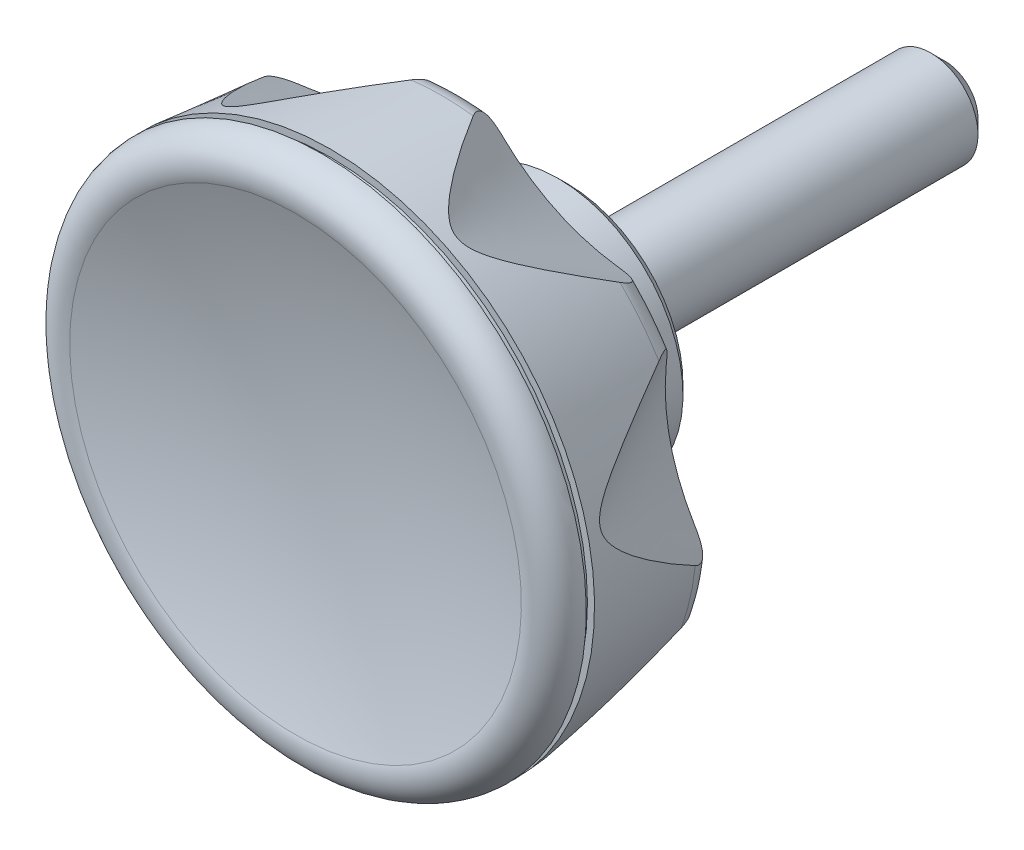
ISO-10303-21;
HEADER;
FILE_DESCRIPTION(('STEP AP214'),'2;1');
FILE_NAME('part.step','',(''),(''),'','','');
FILE_SCHEMA(('AUTOMOTIVE_DESIGN { 1 0 10303 214 1 1 1 1 }'));
ENDSEC;
DATA;
#1=APPLICATION_CONTEXT('core data for automotive mechanical design processes');
#2=APPLICATION_PROTOCOL_DEFINITION('international standard','automotive_design',2000,#1);
#3=PRODUCT_CONTEXT('',#1,'mechanical');
#4=PRODUCT('Part','Part','',(#3));
#5=PRODUCT_RELATED_PRODUCT_CATEGORY('part','',(#4));
#6=PRODUCT_DEFINITION_FORMATION('','',#4);
#7=PRODUCT_DEFINITION_CONTEXT('part definition',#1,'design');
#8=PRODUCT_DEFINITION('design','',#6,#7);
#9=PRODUCT_DEFINITION_SHAPE('','',#8);
#10=(LENGTH_UNIT() NAMED_UNIT(*) SI_UNIT(.MILLI.,.METRE.));
#11=(NAMED_UNIT(*) PLANE_ANGLE_UNIT() SI_UNIT($,.RADIAN.));
#12=(NAMED_UNIT(*) SI_UNIT($,.STERADIAN.) SOLID_ANGLE_UNIT());
#13=UNCERTAINTY_MEASURE_WITH_UNIT(LENGTH_MEASURE(1.E-05),#10,'distance_accuracy_value','');
#14=(GEOMETRIC_REPRESENTATION_CONTEXT(3) GLOBAL_UNCERTAINTY_ASSIGNED_CONTEXT((#13)) GLOBAL_UNIT_ASSIGNED_CONTEXT((#10,
#11,#12)) REPRESENTATION_CONTEXT('',''));
#15=CARTESIAN_POINT('',(0.,0.,0.));
#16=DIRECTION('',(0.,0.,1.));
#17=DIRECTION('',(1.,0.,0.));
#18=AXIS2_PLACEMENT_3D('',#15,#16,#17);
#19=CARTESIAN_POINT('',(0.,0.,13.5));
#20=DIRECTION('',(0.,0.,1.));
#21=DIRECTION('',(0.,1.,0.));
#22=AXIS2_PLACEMENT_3D('',#19,#20,#21);
#23=TOROIDAL_SURFACE('',#22,24.4738282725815,2.4999999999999);
#24=CARTESIAN_POINT('',(0.,0.,11.));
#25=DIRECTION('',(0.,0.,1.));
#26=DIRECTION('',(0.,1.,0.));
#27=AXIS2_PLACEMENT_3D('',#24,#25,#26);
#28=CIRCLE('',#27,24.4738282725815);
#29=CARTESIAN_POINT('',(-16.2379624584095,18.3111126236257,11.));
#30=VERTEX_POINT('',#29);
#31=CARTESIAN_POINT('',(-21.4653013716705,11.7562369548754,11.));
#32=VERTEX_POINT('',#31);
#33=EDGE_CURVE('E131',#30,#32,#28,.T.);
#34=ORIENTED_EDGE('',*,*,#33,.T.);
#35=CARTESIAN_POINT('',(-21.4653013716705,11.7562369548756,11.));
#36=CARTESIAN_POINT('',(-21.4754382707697,11.8601222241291,11.000030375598));
#37=CARTESIAN_POINT('',(-21.4872751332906,11.9639124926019,11.0020766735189));
#38=CARTESIAN_POINT('',(-21.5148402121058,12.1711325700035,11.0112222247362));
#39=CARTESIAN_POINT('',(-21.5305827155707,12.2745596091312,11.0183402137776));
#40=CARTESIAN_POINT('',(-21.5666560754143,12.4816775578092,11.0388207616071));
#41=CARTESIAN_POINT('',(-21.5870535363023,12.5853482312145,11.0522773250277));
#42=CARTESIAN_POINT('',(-21.6327777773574,12.79018793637,11.086761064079));
#43=CARTESIAN_POINT('',(-21.6580966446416,12.8913606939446,11.1077761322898));
#44=CARTESIAN_POINT('',(-21.7159025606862,13.096009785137,11.1604458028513));
#45=CARTESIAN_POINT('',(-21.7487343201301,13.1992460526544,11.1926745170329));
#46=CARTESIAN_POINT('',(-21.8208966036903,13.3985520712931,11.2692171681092));
#47=CARTESIAN_POINT('',(-21.8602062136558,13.494643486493,11.313492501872));
#48=CARTESIAN_POINT('',(-21.9242907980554,13.631369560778,11.3905180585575));
#49=CARTESIAN_POINT('',(-21.9466893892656,13.6760092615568,11.4182052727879));
#50=CARTESIAN_POINT('',(-21.9930436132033,13.7619364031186,11.4772174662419));
#51=CARTESIAN_POINT('',(-22.0169983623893,13.8032257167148,11.5085403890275));
#52=CARTESIAN_POINT('',(-22.0662965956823,13.8818232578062,11.574842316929));
#53=CARTESIAN_POINT('',(-22.0916394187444,13.919133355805,11.6098195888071));
#54=CARTESIAN_POINT('',(-22.1434758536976,13.9891694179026,11.6833341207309));
#55=CARTESIAN_POINT('',(-22.1699692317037,14.0218963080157,11.7218706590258));
#56=CARTESIAN_POINT('',(-22.2204575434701,14.0784837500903,11.7972787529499));
#57=CARTESIAN_POINT('',(-22.2443568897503,14.1029401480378,11.8337680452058));
#58=CARTESIAN_POINT('',(-22.2925479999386,14.147619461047,11.9090357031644));
#59=CARTESIAN_POINT('',(-22.3168398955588,14.1678409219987,11.9478148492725));
#60=CARTESIAN_POINT('',(-22.3655101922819,14.2038164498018,12.0272744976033));
#61=CARTESIAN_POINT('',(-22.3898884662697,14.2195754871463,12.0679528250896));
#62=CARTESIAN_POINT('',(-22.4384945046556,14.2465760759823,12.1508760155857));
#63=CARTESIAN_POINT('',(-22.4627222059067,14.2578158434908,12.1931214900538));
#64=CARTESIAN_POINT('',(-22.5288434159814,14.2825299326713,12.3109990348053));
#65=CARTESIAN_POINT('',(-22.5703388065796,14.2913426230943,12.3878768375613));
#66=CARTESIAN_POINT('',(-22.6510509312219,14.2958836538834,12.5432786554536));
#67=CARTESIAN_POINT('',(-22.6902625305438,14.2915835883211,12.6218058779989));
#68=CARTESIAN_POINT('',(-22.7755265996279,14.2684993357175,12.7992847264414));
#69=CARTESIAN_POINT('',(-22.8206927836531,14.246227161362,12.8982168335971));
#70=CARTESIAN_POINT('',(-22.8841902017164,14.2010917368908,13.044286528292));
#71=CARTESIAN_POINT('',(-22.9046065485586,14.184142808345,13.0924834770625));
#72=CARTESIAN_POINT('',(-22.9440559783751,14.146710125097,13.187982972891));
#73=CARTESIAN_POINT('',(-22.9630908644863,14.1262311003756,13.2352866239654));
#74=CARTESIAN_POINT('',(-22.9814573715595,14.1041446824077,13.2821097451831));
#75=B_SPLINE_CURVE_WITH_KNOTS('',3,(#35,#36,#37,#38,#39,#40,#41,#42,#43,#44,#45,#46,#47,#48,#49,
#50,#51,#52,#53,#54,#55,#56,#57,#58,#59,#60,#61,#62,#63,#64,#65,#66,#67,#68,#69,#70,#71,#72,#73,
#74),.UNSPECIFIED.,.F.,.F.,(4,2,2,2,2,2,2,2,2,2,2,2,2,2,2,2,2,2,2,4),(0.,0.313209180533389,
0.627581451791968,0.946770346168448,1.26545021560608,1.60369981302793,1.94087800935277,
2.11199734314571,2.28302035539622,2.45396261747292,2.62487029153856,2.77466826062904,
2.92451758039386,3.07419932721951,3.22394010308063,3.48614173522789,3.74891177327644,
4.08027673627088,4.24522540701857,4.40995475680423),.UNSPECIFIED.);
#76=CARTESIAN_POINT('',(-22.981457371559,14.1041446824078,13.2821097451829));
#77=VERTEX_POINT('',#76);
#78=EDGE_CURVE('E114',#32,#77,#75,.T.);
#79=ORIENTED_EDGE('',*,*,#78,.T.);
#80=CARTESIAN_POINT('',(0.,0.,13.282109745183));
#81=DIRECTION('',(0.,0.,1.));
#82=DIRECTION('',(0.,1.,0.));
#83=AXIS2_PLACEMENT_3D('',#80,#81,#82);
#84=CIRCLE('',#83,26.9643149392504);
#85=CARTESIAN_POINT('',(-18.8643796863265,19.2667968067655,13.282109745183));
#86=VERTEX_POINT('',#85);
#87=EDGE_CURVE('E146',#86,#77,#84,.T.);
#88=ORIENTED_EDGE('',*,*,#87,.F.);
#89=CARTESIAN_POINT('',(-18.8643796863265,19.2667968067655,13.282109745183));
#90=CARTESIAN_POINT('',(-18.8981743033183,19.2226732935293,13.1915305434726));
#91=CARTESIAN_POINT('',(-18.9255552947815,19.1772447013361,13.0988167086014));
#92=CARTESIAN_POINT('',(-18.9651950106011,19.0843052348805,12.9100927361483));
#93=CARTESIAN_POINT('',(-18.9773008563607,19.0367781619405,12.8140590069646));
#94=CARTESIAN_POINT('',(-18.983341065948,18.9407957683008,12.6209607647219));
#95=CARTESIAN_POINT('',(-18.9771650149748,18.8923365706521,12.5238935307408));
#96=CARTESIAN_POINT('',(-18.9442986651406,18.7968510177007,12.3329550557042));
#97=CARTESIAN_POINT('',(-18.917699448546,18.7498192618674,12.2390715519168));
#98=CARTESIAN_POINT('',(-18.8474169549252,18.6641060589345,12.0674765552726));
#99=CARTESIAN_POINT('',(-18.8058006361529,18.6250650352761,11.9890989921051));
#100=CARTESIAN_POINT('',(-18.7069025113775,18.5516039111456,11.8403817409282));
#101=CARTESIAN_POINT('',(-18.6496092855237,18.5171872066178,11.7700479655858));
#102=CARTESIAN_POINT('',(-18.5279204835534,18.457227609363,11.6454449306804));
#103=CARTESIAN_POINT('',(-18.4646762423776,18.4311577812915,11.5902907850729));
#104=CARTESIAN_POINT('',(-18.3299240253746,18.3843608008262,11.4887242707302));
#105=CARTESIAN_POINT('',(-18.2584221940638,18.3636297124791,11.4423054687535));
#106=CARTESIAN_POINT('',(-18.0741590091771,18.3189481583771,11.3379996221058));
#107=CARTESIAN_POINT('',(-17.9578593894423,18.2981009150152,11.2850492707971));
#108=CARTESIAN_POINT('',(-17.7173155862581,18.2668011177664,11.1949523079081));
#109=CARTESIAN_POINT('',(-17.5930199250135,18.2564250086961,11.1579230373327));
#110=CARTESIAN_POINT('',(-17.3654004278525,18.2458816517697,11.1030967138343));
#111=CARTESIAN_POINT('',(-17.2626807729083,18.2441255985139,11.0829631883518));
#112=CARTESIAN_POINT('',(-17.0560091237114,18.2457463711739,11.0499258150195));
#113=CARTESIAN_POINT('',(-16.9520556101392,18.2491303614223,11.0370320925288));
#114=CARTESIAN_POINT('',(-16.7461255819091,18.260237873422,11.0174873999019));
#115=CARTESIAN_POINT('',(-16.6441552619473,18.2678653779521,11.0107067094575));
#116=CARTESIAN_POINT('',(-16.4406884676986,18.2868392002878,11.0019849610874));
#117=CARTESIAN_POINT('',(-16.3391915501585,18.2981729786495,11.000027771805));
#118=CARTESIAN_POINT('',(-16.2379624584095,18.3111126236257,11.));
#119=B_SPLINE_CURVE_WITH_KNOTS('',3,(#89,#90,#91,#92,#93,#94,#95,#96,#97,#98,#99,#100,#101,#102,
#103,#104,#105,#106,#107,#108,#109,#110,#111,#112,#113,#114,#115,#116,#117,#118),.UNSPECIFIED.,
.F.,.F.,(4,2,2,2,2,2,2,2,2,2,2,2,2,2,4),(0.,0.319088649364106,0.641346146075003,
0.96555390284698,1.28832411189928,1.57749027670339,1.86686764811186,2.12940978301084,
2.39175780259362,2.77800167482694,3.16704536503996,3.48068996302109,3.79477212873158,
4.10202079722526,4.40824052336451),.UNSPECIFIED.);
#120=EDGE_CURVE('E136',#86,#30,#119,.T.);
#121=ORIENTED_EDGE('',*,*,#120,.T.);
#122=EDGE_LOOP('',(#34,#79,#88,#121));
#123=FACE_BOUND('',#122,.T.);
#124=ADVANCED_FACE('F14',(#123),#23,.T.);
#125=CARTESIAN_POINT('',(-26.8251366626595,-2.73611461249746,13.282109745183));
#126=VERTEX_POINT('',#125);
#127=CARTESIAN_POINT('',(-25.355768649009,-9.17383651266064,13.282109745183));
#128=VERTEX_POINT('',#127);
#129=EDGE_CURVE('E153',#126,#128,#84,.T.);
#130=ORIENTED_EDGE('',*,*,#129,.F.);
#131=CARTESIAN_POINT('',(-26.8251366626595,-2.73611461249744,13.282109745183));
#132=CARTESIAN_POINT('',(-26.8117101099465,-2.79004686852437,13.1915305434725));
#133=CARTESIAN_POINT('',(-26.7932643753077,-2.83977845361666,13.0988167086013));
#134=CARTESIAN_POINT('',(-26.7453163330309,-2.92871684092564,12.9100927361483));
#135=CARTESIAN_POINT('',(-26.7157060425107,-2.96781421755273,12.8140590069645));
#136=CARTESIAN_POINT('',(-26.6444299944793,-3.0323806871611,12.620960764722));
#137=CARTESIAN_POINT('',(-26.602692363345,-3.0577658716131,12.5238935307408));
#138=CARTESIAN_POINT('',(-26.507546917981,-3.09160419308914,12.3329550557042));
#139=CARTESIAN_POINT('',(-26.4541916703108,-3.10013190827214,12.2390715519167));
#140=CARTESIAN_POINT('',(-26.3433579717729,-3.09862415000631,12.0674765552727));
#141=CARTESIAN_POINT('',(-26.2868871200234,-3.09042888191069,11.9890989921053));
#142=CARTESIAN_POINT('',(-26.1677909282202,-3.05890947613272,11.8403817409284));
#143=CARTESIAN_POINT('',(-26.1051611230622,-3.03557429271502,11.7700479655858));
#144=CARTESIAN_POINT('',(-25.9824110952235,-2.97781835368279,11.6454449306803));
#145=CARTESIAN_POINT('',(-25.9225967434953,-2.94462628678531,11.590290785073));
#146=CARTESIAN_POINT('',(-25.8019927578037,-2.86845020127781,11.4887242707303));
#147=CARTESIAN_POINT('',(-25.7412038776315,-2.82547344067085,11.4423054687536));
#148=CARTESIAN_POINT('',(-25.5913842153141,-2.70926917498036,11.3379996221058));
#149=CARTESIAN_POINT('',(-25.5025735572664,-2.63134051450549,11.2850492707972));
#150=CARTESIAN_POINT('',(-25.3281257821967,-2.46279090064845,11.194952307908));
#151=CARTESIAN_POINT('',(-25.2425163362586,-2.37208203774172,11.1579230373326));
#152=CARTESIAN_POINT('',(-25.0923547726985,-2.20069562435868,11.1030967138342));
#153=CARTESIAN_POINT('',(-25.0269371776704,-2.12148104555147,11.0829631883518));
#154=CARTESIAN_POINT('',(-24.8993466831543,-1.95888810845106,11.0499258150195));
#155=CARTESIAN_POINT('',(-24.8371784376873,-1.87550409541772,11.0370320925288));
#156=CARTESIAN_POINT('',(-24.7174673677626,-1.70757609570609,11.0174873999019));
#157=CARTESIAN_POINT('',(-24.6598533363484,-1.62309681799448,11.0107067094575));
#158=CARTESIAN_POINT('',(-24.5478281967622,-1.45219008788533,11.0019849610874));
#159=CARTESIAN_POINT('',(-24.4934070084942,-1.365770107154,11.000027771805));
#160=CARTESIAN_POINT('',(-24.4404083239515,-1.27855827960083,11.));
#161=B_SPLINE_CURVE_WITH_KNOTS('',3,(#131,#132,#133,#134,#135,#136,#137,#138,#139,#140,#141,
#142,#143,#144,#145,#146,#147,#148,#149,#150,#151,#152,#153,#154,#155,#156,#157,#158,#159,#160),
.UNSPECIFIED.,.F.,.F.,(4,2,2,2,2,2,2,2,2,2,2,2,2,2,4),(0.,0.319088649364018,0.641346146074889,
0.965553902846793,1.288324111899,1.57749027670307,1.8668676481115,2.12940978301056,
2.39175780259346,2.77800167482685,3.16704536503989,3.4806899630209,3.79477212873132,
4.10202079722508,4.40824052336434),.UNSPECIFIED.);
#162=CARTESIAN_POINT('',(-24.4404083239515,-1.27855827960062,11.));
#163=VERTEX_POINT('',#162);
#164=EDGE_CURVE('E29',#126,#163,#161,.T.);
#165=ORIENTED_EDGE('',*,*,#164,.T.);
#166=CARTESIAN_POINT('',(-22.5747926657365,-9.45235454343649,11.));
#167=VERTEX_POINT('',#166);
#168=EDGE_CURVE('E133',#163,#167,#28,.T.);
#169=ORIENTED_EDGE('',*,*,#168,.T.);
#170=CARTESIAN_POINT('',(-22.5747926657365,-9.45235454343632,11.));
#171=CARTESIAN_POINT('',(-22.6623336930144,-9.39550848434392,11.000030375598));
#172=CARTESIAN_POINT('',(-22.7508603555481,-9.34005074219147,11.0020766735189));
#173=CARTESIAN_POINT('',(-22.930058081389,-9.23240238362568,11.0112222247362));
#174=CARTESIAN_POINT('',(-23.0207358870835,-9.18022466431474,11.0183402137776));
#175=CARTESIAN_POINT('',(-23.2051585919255,-9.07929202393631,11.0388207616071));
#176=CARTESIAN_POINT('',(-23.2989291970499,-9.03060179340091,11.0522773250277));
#177=CARTESIAN_POINT('',(-23.4875879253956,-8.93863497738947,11.0867610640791));
#178=CARTESIAN_POINT('',(-23.5824740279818,-8.89534988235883,11.1077761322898));
#179=CARTESIAN_POINT('',(-23.7785165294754,-8.81294774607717,11.1604458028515));
#180=CARTESIAN_POINT('',(-23.8797001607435,-8.77424988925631,11.1926745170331));
#181=CARTESIAN_POINT('',(-24.0805163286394,-8.70640336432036,11.2692171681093));
#182=CARTESIAN_POINT('',(-24.1801527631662,-8.67722483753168,11.3134925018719));
#183=CARTESIAN_POINT('',(-24.3270055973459,-8.64208087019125,11.3905180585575));
#184=CARTESIAN_POINT('',(-24.3758716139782,-8.63176039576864,11.4182052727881));
#185=CARTESIAN_POINT('',(-24.4719535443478,-8.6144268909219,11.4772174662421));
#186=CARTESIAN_POINT('',(-24.5191703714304,-8.60741200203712,11.5085403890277));
#187=CARTESIAN_POINT('',(-24.611357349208,-8.59695014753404,11.5748423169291));
#188=CARTESIAN_POINT('',(-24.6563285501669,-8.59350149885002,11.6098195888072));
#189=CARTESIAN_POINT('',(-24.7434044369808,-8.59036208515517,11.683334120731));
#190=CARTESIAN_POINT('',(-24.785509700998,-8.59067055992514,11.721870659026));
#191=CARTESIAN_POINT('',(-24.8612304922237,-8.594862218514,11.79727875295));
#192=CARTESIAN_POINT('',(-24.8952522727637,-8.59829916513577,11.8337680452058));
#193=CARTESIAN_POINT('',(-24.960230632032,-8.60811939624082,11.9090357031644));
#194=CARTESIAN_POINT('',(-24.9911861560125,-8.61450369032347,11.9478148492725));
#195=CARTESIAN_POINT('',(-25.0496583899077,-8.63012528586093,12.0272744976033));
#196=CARTESIAN_POINT('',(-25.0771789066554,-8.63935938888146,12.0679528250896));
#197=CARTESIAN_POINT('',(-25.1285941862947,-8.66052652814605,12.1508760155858));
#198=CARTESIAN_POINT('',(-25.152487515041,-8.67246062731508,12.1931214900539));
#199=CARTESIAN_POINT('',(-25.2130356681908,-8.70874728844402,12.3109990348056));
#200=CARTESIAN_POINT('',(-25.2457976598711,-8.73569506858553,12.3878768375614));
#201=CARTESIAN_POINT('',(-25.2996711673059,-8.79596706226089,12.5432786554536));
#202=CARTESIAN_POINT('',(-25.3207572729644,-8.82930497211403,12.621805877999));
#203=CARTESIAN_POINT('',(-25.3558705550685,-8.91035990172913,12.7992847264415));
#204=CARTESIAN_POINT('',(-25.3666181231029,-8.9595587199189,12.8982168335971));
#205=CARTESIAN_POINT('',(-25.3709198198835,-9.03734447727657,13.0442865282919));
#206=CARTESIAN_POINT('',(-25.3703979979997,-9.0638741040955,13.0924834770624));
#207=CARTESIAN_POINT('',(-25.3657282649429,-9.11805580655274,13.1879829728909));
#208=CARTESIAN_POINT('',(-25.3615851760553,-9.14570634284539,13.2352866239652));
#209=CARTESIAN_POINT('',(-25.355768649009,-9.17383651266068,13.282109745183));
#210=B_SPLINE_CURVE_WITH_KNOTS('',3,(#170,#171,#172,#173,#174,#175,#176,#177,#178,#179,#180,
#181,#182,#183,#184,#185,#186,#187,#188,#189,#190,#191,#192,#193,#194,#195,#196,#197,#198,#199,
#200,#201,#202,#203,#204,#205,#206,#207,#208,#209),.UNSPECIFIED.,.F.,.F.,(4,2,2,2,2,2,2,2,2,2,2,
2,2,2,2,2,2,2,2,4),(0.,0.313209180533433,0.627581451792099,0.946770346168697,1.26545021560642,
1.60369981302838,1.9408780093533,2.11199734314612,2.28302035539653,2.45396261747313,
2.62487029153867,2.77466826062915,2.92451758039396,3.07419932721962,3.22394010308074,
3.48614173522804,3.74891177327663,4.08027673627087,4.24522540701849,4.40995475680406),.UNSPECIFIED.);
#211=EDGE_CURVE('E306',#167,#128,#210,.T.);
#212=ORIENTED_EDGE('',*,*,#211,.T.);
#213=EDGE_LOOP('',(#130,#165,#169,#212));
#214=FACE_BOUND('',#213,.T.);
#215=ADVANCED_FACE('F416',(#214),#23,.T.);
#216=CARTESIAN_POINT('',(-14.586018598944,-22.6786759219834,13.282109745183));
#217=VERTEX_POINT('',#216);
#218=CARTESIAN_POINT('',(-8.63666897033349,-25.5437317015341,13.282109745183));
#219=VERTEX_POINT('',#218);
#220=EDGE_CURVE('E157',#217,#219,#84,.T.);
#221=ORIENTED_EDGE('',*,*,#220,.F.);
#222=CARTESIAN_POINT('',(-14.586018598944,-22.6786759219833,13.282109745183));
#223=CARTESIAN_POINT('',(-14.5354813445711,-22.7018048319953,13.1915305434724));
#224=CARTESIAN_POINT('',(-14.4850988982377,-22.7183905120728,13.0988167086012));
#225=CARTESIAN_POINT('',(-14.3856689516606,-22.736355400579,12.9100927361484));
#226=CARTESIAN_POINT('',(-14.336639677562,-22.7375819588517,12.8140590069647));
#227=CARTESIAN_POINT('',(-14.2417196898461,-22.7221126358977,12.620960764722));
#228=CARTESIAN_POINT('',(-14.1958497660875,-22.7053082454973,12.5238935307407));
#229=CARTESIAN_POINT('',(-14.1100716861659,-22.6520183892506,12.3329550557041));
#230=CARTESIAN_POINT('',(-14.070137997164,-22.6156205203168,12.2390715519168));
#231=CARTESIAN_POINT('',(-14.0022131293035,-22.5280271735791,12.0674765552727));
#232=CARTESIAN_POINT('',(-13.9734114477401,-22.4787668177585,11.9890989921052));
#233=CARTESIAN_POINT('',(-13.9237990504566,-22.3660016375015,11.8403817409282));
#234=CARTESIAN_POINT('',(-13.9029941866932,-22.3024864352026,11.7700479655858));
#235=CARTESIAN_POINT('',(-13.8716162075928,-22.1705063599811,11.6454449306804));
#236=CARTESIAN_POINT('',(-13.8602731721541,-22.1030467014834,11.590290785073));
#237=CARTESIAN_POINT('',(-13.8446346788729,-21.9612596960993,11.4887242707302));
#238=CARTESIAN_POINT('',(-13.8403340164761,-21.8869374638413,11.4423054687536));
#239=CARTESIAN_POINT('',(-13.8377751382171,-21.6973515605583,11.3379996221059));
#240=CARTESIAN_POINT('',(-13.8433296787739,-21.5793288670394,11.2850492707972));
#241=CARTESIAN_POINT('',(-13.8663406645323,-21.3378511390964,11.194952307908));
#242=CARTESIAN_POINT('',(-13.8838830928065,-21.2143629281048,11.1579230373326));
#243=CARTESIAN_POINT('',(-13.9242541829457,-20.9901042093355,11.1030967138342));
#244=CARTESIAN_POINT('',(-13.9453994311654,-20.8895691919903,11.0829631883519));
#245=CARTESIAN_POINT('',(-13.9929683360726,-20.6884398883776,11.0499258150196));
#246=CARTESIAN_POINT('',(-14.0193993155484,-20.5878457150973,11.0370320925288));
#247=CARTESIAN_POINT('',(-14.0760520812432,-20.3895504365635,11.0174873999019));
#248=CARTESIAN_POINT('',(-14.1061788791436,-20.2918340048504,11.0107067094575));
#249=CARTESIAN_POINT('',(-14.1699526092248,-20.097690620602,11.0019849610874));
#250=CARTESIAN_POINT('',(-14.2035874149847,-20.001260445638,11.000027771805));
#251=CARTESIAN_POINT('',(-14.238728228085,-19.9054487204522,11.));
#252=B_SPLINE_CURVE_WITH_KNOTS('',3,(#222,#223,#224,#225,#226,#227,#228,#229,#230,#231,#232,
#233,#234,#235,#236,#237,#238,#239,#240,#241,#242,#243,#244,#245,#246,#247,#248,#249,#250,#251),
.UNSPECIFIED.,.F.,.F.,(4,2,2,2,2,2,2,2,2,2,2,2,2,2,4),(0.,0.319088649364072,0.641346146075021,
0.965553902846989,1.28832411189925,1.5774902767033,1.86686764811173,2.12940978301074,
2.39175780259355,2.77800167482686,3.16704536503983,3.48068996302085,3.79477212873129,
4.10202079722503,4.40824052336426),.UNSPECIFIED.);
#253=CARTESIAN_POINT('',(-14.238728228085,-19.905448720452,11.));
#254=VERTEX_POINT('',#253);
#255=EDGE_CURVE('E37',#217,#254,#252,.T.);
#256=ORIENTED_EDGE('',*,*,#255,.T.);
#257=CARTESIAN_POINT('',(-6.685004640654,-23.5431302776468,11.));
#258=VERTEX_POINT('',#257);
#259=EDGE_CURVE('E143',#254,#258,#28,.T.);
#260=ORIENTED_EDGE('',*,*,#259,.T.);
#261=CARTESIAN_POINT('',(-6.685004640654,-23.5431302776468,11.));
#262=CARTESIAN_POINT('',(-6.78402961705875,-23.5761296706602,11.000030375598));
#263=CARTESIAN_POINT('',(-6.88258369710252,-23.6107652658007,11.0020766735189));
#264=CARTESIAN_POINT('',(-7.07847452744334,-23.6837500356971,11.0112222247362));
#265=CARTESIAN_POINT('',(-7.17580539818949,-23.7221125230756,11.0183402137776));
#266=CARTESIAN_POINT('',(-7.36970338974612,-23.8033695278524,11.0388207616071));
#267=CARTESIAN_POINT('',(-7.46623596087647,-23.8463244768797,11.0522773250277));
#268=CARTESIAN_POINT('',(-7.65576530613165,-23.9364834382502,11.0867610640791));
#269=CARTESIAN_POINT('',(-7.74876747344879,-23.9836805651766,11.1077761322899));
#270=CARTESIAN_POINT('',(-7.93542255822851,-24.0855758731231,11.1604458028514));
#271=CARTESIAN_POINT('',(-8.02876472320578,-24.1405567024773,11.192674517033));
#272=CARTESIAN_POINT('',(-8.2070161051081,-24.2552594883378,11.2692171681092));
#273=CARTESIAN_POINT('',(-8.29195109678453,-24.3149658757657,11.313492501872));
#274=CARTESIAN_POINT('',(-8.41098900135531,-24.4078681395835,11.3905180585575));
#275=CARTESIAN_POINT('',(-8.44952533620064,-24.4396384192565,11.418205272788));
#276=CARTESIAN_POINT('',(-8.52298331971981,-24.5039510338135,11.477217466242));
#277=CARTESIAN_POINT('',(-8.55790699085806,-24.5364929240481,11.5085403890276));
#278=CARTESIAN_POINT('',(-8.62356403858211,-24.602044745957,11.5748423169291));
#279=CARTESIAN_POINT('',(-8.65429938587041,-24.6350544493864,11.6098195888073));
#280=CARTESIAN_POINT('',(-8.71104480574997,-24.7011757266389,11.683334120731));
#281=CARTESIAN_POINT('',(-8.73705583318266,-24.7342872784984,11.7218706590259));
#282=CARTESIAN_POINT('',(-8.78098980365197,-24.796101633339,11.7972787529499));
#283=CARTESIAN_POINT('',(-8.79951492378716,-24.824843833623,11.8337680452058));
#284=CARTESIAN_POINT('',(-8.8323505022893,-24.8817687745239,11.9090357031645));
#285=CARTESIAN_POINT('',(-8.84665951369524,-24.9099513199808,11.9478148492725));
#286=CARTESIAN_POINT('',(-8.87090290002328,-24.9654066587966,12.0272744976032));
#287=CARTESIAN_POINT('',(-8.88084214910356,-24.9926804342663,12.0679528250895));
#288=CARTESIAN_POINT('',(-8.89634991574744,-25.0460760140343,12.1508760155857));
#289=CARTESIAN_POINT('',(-8.90191670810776,-25.0721973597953,12.1931214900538));
#290=CARTESIAN_POINT('',(-8.91129781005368,-25.1421601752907,12.3109990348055));
#291=CARTESIAN_POINT('',(-8.91065595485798,-25.1845761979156,12.3878768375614));
#292=CARTESIAN_POINT('',(-8.8971229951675,-25.2642751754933,12.5432786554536));
#293=CARTESIAN_POINT('',(-8.88420533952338,-25.3015468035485,12.621805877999));
#294=CARTESIAN_POINT('',(-8.84272681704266,-25.3795363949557,12.7992847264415));
#295=CARTESIAN_POINT('',(-8.81096263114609,-25.4186141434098,12.8982168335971));
#296=CARTESIAN_POINT('',(-8.75282934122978,-25.4704759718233,13.044286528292));
#297=CARTESIAN_POINT('',(-8.73176229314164,-25.486608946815,13.0924834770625));
#298=CARTESIAN_POINT('',(-8.68648980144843,-25.5167397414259,13.187982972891));
#299=CARTESIAN_POINT('',(-8.66228856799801,-25.5307403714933,13.2352866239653));
#300=CARTESIAN_POINT('',(-8.63666897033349,-25.5437317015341,13.2821097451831));
#301=B_SPLINE_CURVE_WITH_KNOTS('',3,(#261,#262,#263,#264,#265,#266,#267,#268,#269,#270,#271,
#272,#273,#274,#275,#276,#277,#278,#279,#280,#281,#282,#283,#284,#285,#286,#287,#288,#289,#290,
#291,#292,#293,#294,#295,#296,#297,#298,#299,#300),.UNSPECIFIED.,.F.,.F.,(4,2,2,2,2,2,2,2,2,2,2,
2,2,2,2,2,2,2,2,4),(0.,0.313209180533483,0.627581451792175,0.946770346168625,1.26545021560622,
1.60369981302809,1.940878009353,2.11199734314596,2.28302035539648,2.45396261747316,
2.62487029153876,2.77466826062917,2.92451758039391,3.07419932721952,3.22394010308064,
3.48614173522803,3.74891177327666,4.0802767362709,4.24522540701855,4.40995475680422),.UNSPECIFIED.);
#302=EDGE_CURVE('E322',#258,#219,#301,.T.);
#303=ORIENTED_EDGE('',*,*,#302,.T.);
#304=EDGE_LOOP('',(#221,#256,#260,#303));
#305=FACE_BOUND('',#304,.T.);
#306=ADVANCED_FACE('F447',(#305),#23,.T.);
#307=CARTESIAN_POINT('',(8.636668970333,-25.5437317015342,13.282109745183));
#308=VERTEX_POINT('',#307);
#309=CARTESIAN_POINT('',(14.586018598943,-22.6786759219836,13.282109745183));
#310=VERTEX_POINT('',#309);
#311=EDGE_CURVE('E455',#308,#310,#84,.T.);
#312=ORIENTED_EDGE('',*,*,#311,.F.);
#313=CARTESIAN_POINT('',(8.636668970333,-25.5437317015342,13.2821097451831));
#314=CARTESIAN_POINT('',(8.68626134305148,-25.5186407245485,13.1915305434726));
#315=CARTESIAN_POINT('',(8.73064149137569,-25.4895911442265,13.0988167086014));
#316=CARTESIAN_POINT('',(8.80668056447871,-25.4230546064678,12.9100927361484));
#317=CARTESIAN_POINT('',(8.83820877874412,-25.3854867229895,12.8140590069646));
#318=CARTESIAN_POINT('',(8.88529601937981,-25.3016303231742,12.6209607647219));
#319=CARTESIAN_POINT('',(8.90075724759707,-25.2552904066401,12.5238935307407));
#320=CARTESIAN_POINT('',(8.91257531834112,-25.1550007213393,12.3329550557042));
#321=CARTESIAN_POINT('',(8.90901656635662,-25.1010856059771,12.2390715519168));
#322=CARTESIAN_POINT('',(8.88288379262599,-24.9933662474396,12.0674765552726));
#323=CARTESIAN_POINT('',(8.8623280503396,-24.9401348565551,11.9890989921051));
#324=CARTESIAN_POINT('',(8.80509750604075,-24.8310383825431,11.8403817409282));
#325=CARTESIAN_POINT('',(8.76841094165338,-24.7751714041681,11.7700479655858));
#326=CARTESIAN_POINT('',(8.68478861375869,-24.6683508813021,11.6454449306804));
#327=CARTESIAN_POINT('',(8.63911879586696,-24.6174221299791,11.5902907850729));
#328=CARTESIAN_POINT('',(8.53801569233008,-24.5167927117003,11.4887242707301));
#329=CARTESIAN_POINT('',(8.48258965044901,-24.4670911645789,11.4423054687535));
#330=CARTESIAN_POINT('',(8.33596085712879,-24.3468856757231,11.3379996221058));
#331=CARTESIAN_POINT('',(8.24022380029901,-24.277642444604,11.285049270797));
#332=CARTESIAN_POINT('',(8.03708179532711,-24.1450742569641,11.194952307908));
#333=CARTESIAN_POINT('',(7.9295972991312,-24.081795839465,11.1579230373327));
#334=CARTESIAN_POINT('',(7.72909380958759,-23.9735362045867,11.1030967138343));
#335=CARTESIAN_POINT('',(7.63730852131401,-23.9273856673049,11.0829631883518));
#336=CARTESIAN_POINT('',(7.45040057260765,-23.8391744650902,11.0499258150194));
#337=CARTESIAN_POINT('',(7.35527343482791,-23.7971195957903,11.0370320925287));
#338=CARTESIAN_POINT('',(7.16491752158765,-23.7177774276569,11.0174873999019));
#339=CARTESIAN_POINT('',(7.06973598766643,-23.6804063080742,11.0107067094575));
#340=CARTESIAN_POINT('',(6.87818630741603,-23.6092201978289,11.0019849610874));
#341=CARTESIAN_POINT('',(6.78182320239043,-23.5753937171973,11.000027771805));
#342=CARTESIAN_POINT('',(6.6850046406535,-23.543130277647,11.));
#343=B_SPLINE_CURVE_WITH_KNOTS('',3,(#313,#314,#315,#316,#317,#318,#319,#320,#321,#322,#323,
#324,#325,#326,#327,#328,#329,#330,#331,#332,#333,#334,#335,#336,#337,#338,#339,#340,#341,#342),
.UNSPECIFIED.,.F.,.F.,(4,2,2,2,2,2,2,2,2,2,2,2,2,2,4),(0.,0.319088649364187,0.641346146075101,
0.965553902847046,1.28832411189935,1.57749027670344,1.86686764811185,2.12940978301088,
2.39175780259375,2.77800167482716,3.16704536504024,3.48068996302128,3.79477212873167,
4.1020207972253,4.40824052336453),.UNSPECIFIED.);
#344=CARTESIAN_POINT('',(6.685004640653,-23.5431302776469,11.));
#345=VERTEX_POINT('',#344);
#346=EDGE_CURVE('E315',#308,#345,#343,.T.);
#347=ORIENTED_EDGE('',*,*,#346,.T.);
#348=CARTESIAN_POINT('',(14.2387282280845,-19.9054487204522,11.));
#349=VERTEX_POINT('',#348);
#350=EDGE_CURVE('E449',#345,#349,#28,.T.);
#351=ORIENTED_EDGE('',*,*,#350,.T.);
#352=CARTESIAN_POINT('',(14.2387282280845,-19.9054487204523,11.));
#353=CARTESIAN_POINT('',(14.202787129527,-20.0034443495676,11.000030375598));
#354=CARTESIAN_POINT('',(14.168418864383,-20.1020919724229,11.0020766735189));
#355=CARTESIAN_POINT('',(14.1033447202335,-20.3007508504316,11.0112222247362));
#356=CARTESIAN_POINT('',(14.0726529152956,-20.4007658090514,11.0183402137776));
#357=CARTESIAN_POINT('',(14.0152887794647,-20.6030242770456,11.038820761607));
#358=CARTESIAN_POINT('',(13.9886852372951,-20.7052784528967,11.0522773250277));
#359=CARTESIAN_POINT('',(13.9410047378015,-20.9096716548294,11.086761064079));
#360=CARTESIAN_POINT('',(13.9199190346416,-21.0118106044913,11.1077761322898));
#361=CARTESIAN_POINT('',(13.8832064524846,-21.2212741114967,11.1604458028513));
#362=CARTESIAN_POINT('',(13.8679943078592,-21.3285319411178,11.1926745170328));
#363=CARTESIAN_POINT('',(13.8465346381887,-21.5394105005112,11.269217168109));
#364=CARTESIAN_POINT('',(13.8402588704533,-21.6430416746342,11.3134925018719));
#365=CARTESIAN_POINT('',(13.8386738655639,-21.7940328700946,11.3905180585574));
#366=CARTESIAN_POINT('',(13.8394858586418,-21.843970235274,11.4182052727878));
#367=CARTESIAN_POINT('',(13.8439671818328,-21.9415002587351,11.4772174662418));
#368=CARTESIAN_POINT('',(13.8476349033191,-21.9890942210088,11.5085403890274));
#369=CARTESIAN_POINT('',(13.8579488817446,-22.0812978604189,11.5748423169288));
#370=CARTESIAN_POINT('',(13.8645937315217,-22.1259089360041,11.609819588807));
#371=CARTESIAN_POINT('',(13.8809092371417,-22.2115002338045,11.6833341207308));
#372=CARTESIAN_POINT('',(13.8905792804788,-22.2524811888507,11.7218706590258));
#373=CARTESIAN_POINT('',(13.9115153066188,-22.3253707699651,11.7972787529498));
#374=CARTESIAN_POINT('',(13.9224366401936,-22.3577747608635,11.8337680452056));
#375=CARTESIAN_POINT('',(13.9464697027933,-22.4189387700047,11.9090357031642));
#376=CARTESIAN_POINT('',(13.9595821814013,-22.4476975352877,11.9478148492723));
#377=CARTESIAN_POINT('',(13.9878234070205,-22.5012276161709,12.0272744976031));
#378=CARTESIAN_POINT('',(14.0029498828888,-22.5260033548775,12.0679528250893));
#379=CARTESIAN_POINT('',(14.0350272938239,-22.5714194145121,12.1508760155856));
#380=CARTESIAN_POINT('',(14.0519789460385,-22.5920581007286,12.1931214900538));
#381=CARTESIAN_POINT('',(14.1008290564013,-22.6430136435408,12.3109990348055));
#382=CARTESIAN_POINT('',(14.1343914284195,-22.6689577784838,12.3878768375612));
#383=CARTESIAN_POINT('',(14.2051402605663,-22.7080687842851,12.5432786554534));
#384=CARTESIAN_POINT('',(14.2423344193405,-22.7212078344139,12.6218058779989));
#385=CARTESIAN_POINT('',(14.3291705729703,-22.7374043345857,12.7992847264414));
#386=CARTESIAN_POINT('',(14.3795274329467,-22.7369346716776,12.898216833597));
#387=CARTESIAN_POINT('',(14.4563201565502,-22.7238195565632,13.0442865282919));
#388=CARTESIAN_POINT('',(14.4820685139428,-22.7174074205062,13.0924834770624));
#389=CARTESIAN_POINT('',(14.5338526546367,-22.7007982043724,13.1879829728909));
#390=CARTESIAN_POINT('',(14.5598880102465,-22.6906061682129,13.2352866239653));
#391=CARTESIAN_POINT('',(14.586018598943,-22.6786759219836,13.2821097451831));
#392=B_SPLINE_CURVE_WITH_KNOTS('',3,(#352,#353,#354,#355,#356,#357,#358,#359,#360,#361,#362,
#363,#364,#365,#366,#367,#368,#369,#370,#371,#372,#373,#374,#375,#376,#377,#378,#379,#380,#381,
#382,#383,#384,#385,#386,#387,#388,#389,#390,#391),.UNSPECIFIED.,.F.,.F.,(4,2,2,2,2,2,2,2,2,2,2,
2,2,2,2,2,2,2,2,4),(0.,0.313209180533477,0.627581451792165,0.946770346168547,1.26545021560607,
1.60369981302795,1.94087800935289,2.11199734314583,2.28302035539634,2.45396261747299,
2.62487029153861,2.77466826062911,2.9245175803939,3.07419932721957,3.22394010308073,
3.48614173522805,3.74891177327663,4.08027673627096,4.24522540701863,4.40995475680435),.UNSPECIFIED.);
#393=EDGE_CURVE('E338',#349,#310,#392,.T.);
#394=ORIENTED_EDGE('',*,*,#393,.T.);
#395=EDGE_LOOP('',(#312,#347,#351,#394));
#396=FACE_BOUND('',#395,.T.);
#397=ADVANCED_FACE('F428',(#396),#23,.T.);
#398=CARTESIAN_POINT('',(25.3557686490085,-9.17383651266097,13.282109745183));
#399=VERTEX_POINT('',#398);
#400=CARTESIAN_POINT('',(26.825136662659,-2.73611461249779,13.282109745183));
#401=VERTEX_POINT('',#400);
#402=EDGE_CURVE('E164',#399,#401,#84,.T.);
#403=ORIENTED_EDGE('',*,*,#402,.F.);
#404=CARTESIAN_POINT('',(25.3557686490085,-9.17383651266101,13.282109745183));
#405=CARTESIAN_POINT('',(25.3670720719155,-9.11941966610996,13.1915305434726));
#406=CARTESIAN_POINT('',(25.3720307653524,-9.06660975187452,13.0988167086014));
#407=CARTESIAN_POINT('',(25.3674199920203,-8.96567515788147,12.9100927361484));
#408=CARTESIAN_POINT('',(25.3577057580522,-8.91760221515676,12.8140590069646));
#409=CARTESIAN_POINT('',(25.3215025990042,-8.82850431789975,12.6209607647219));
#410=CARTESIAN_POINT('',(25.294912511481,-8.78752377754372,12.5238935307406));
#411=CARTESIAN_POINT('',(25.2238713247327,-8.71575444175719,12.3329550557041));
#412=CARTESIAN_POINT('',(25.1794999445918,-8.68492126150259,12.2390715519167));
#413=CARTESIAN_POINT('',(25.0789880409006,-8.63819076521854,12.0674765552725));
#414=CARTESIAN_POINT('',(25.0245537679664,-8.62107266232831,11.989098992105));
#415=CARTESIAN_POINT('',(24.9035760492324,-8.59779676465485,11.8403817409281));
#416=CARTESIAN_POINT('',(24.8370237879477,-8.59164698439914,11.7700479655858));
#417=CARTESIAN_POINT('',(24.7013704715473,-8.5904240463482,11.6454449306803));
#418=CARTESIAN_POINT('',(24.633078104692,-8.59437659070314,11.5902907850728));
#419=CARTESIAN_POINT('',(24.4913661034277,-8.61068076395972,11.4887242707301));
#420=CARTESIAN_POINT('',(24.4179502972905,-8.62302618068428,11.4423054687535));
#421=CARTESIAN_POINT('',(24.2325483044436,-8.66271829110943,11.3379996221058));
#422=CARTESIAN_POINT('',(24.1187206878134,-8.69439608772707,11.285049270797));
#423=CARTESIAN_POINT('',(23.8884177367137,-8.77056398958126,11.1949523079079));
#424=CARTESIAN_POINT('',(23.771929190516,-8.815145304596,11.1579230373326));
#425=CARTESIAN_POINT('',(23.5622765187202,-8.90440646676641,11.1030967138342));
#426=CARTESIAN_POINT('',(23.4689673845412,-8.94739270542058,11.0829631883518));
#427=CARTESIAN_POINT('',(23.2834658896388,-9.03852443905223,11.0499258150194));
#428=CARTESIAN_POINT('',(23.1912752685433,-9.08667704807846,11.0370320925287));
#429=CARTESIAN_POINT('',(23.0105580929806,-9.18603426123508,11.0174873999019));
#430=CARTESIAN_POINT('',(22.9219954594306,-9.23714966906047,11.0107067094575));
#431=CARTESIAN_POINT('',(22.746910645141,-9.342525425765,11.0019849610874));
#432=CARTESIAN_POINT('',(22.6603826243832,-9.39677466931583,11.000027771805));
#433=CARTESIAN_POINT('',(22.5747926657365,-9.45235454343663,11.));
#434=B_SPLINE_CURVE_WITH_KNOTS('',3,(#404,#405,#406,#407,#408,#409,#410,#411,#412,#413,#414,
#415,#416,#417,#418,#419,#420,#421,#422,#423,#424,#425,#426,#427,#428,#429,#430,#431,#432,#433),
.UNSPECIFIED.,.F.,.F.,(4,2,2,2,2,2,2,2,2,2,2,2,2,2,4),(0.,0.319088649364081,0.641346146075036,
0.965553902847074,1.28832411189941,1.5774902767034,1.86686764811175,2.12940978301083,
2.39175780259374,2.77800167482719,3.1670453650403,3.48068996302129,3.79477212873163,
4.10202079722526,4.40824052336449),.UNSPECIFIED.);
#435=CARTESIAN_POINT('',(22.574792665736,-9.45235454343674,11.));
#436=VERTEX_POINT('',#435);
#437=EDGE_CURVE('E331',#399,#436,#434,.T.);
#438=ORIENTED_EDGE('',*,*,#437,.T.);
#439=CARTESIAN_POINT('',(24.440408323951,-1.27855827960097,11.));
#440=VERTEX_POINT('',#439);
#441=EDGE_CURVE('E152',#436,#440,#28,.T.);
#442=ORIENTED_EDGE('',*,*,#441,.T.);
#443=CARTESIAN_POINT('',(24.4404083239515,-1.2785582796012,11.));
#444=CARTESIAN_POINT('',(24.4946154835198,-1.36775743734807,11.000030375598));
#445=CARTESIAN_POINT('',(24.5503130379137,-1.45613341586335,11.0020766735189));
#446=CARTESIAN_POINT('',(24.6650577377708,-1.6308722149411,11.0112222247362));
#447=CARTESIAN_POINT('',(24.724116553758,-1.71722634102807,11.0183402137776));
#448=CARTESIAN_POINT('',(24.8464826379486,-1.88818152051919,11.038820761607));
#449=CARTESIAN_POINT('',(24.9098411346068,-1.97273544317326,11.0522773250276));
#450=CARTESIAN_POINT('',(25.0399138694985,-2.13745063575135,11.086761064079));
#451=CARTESIAN_POINT('',(25.1066225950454,-2.21761869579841,11.1077761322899));
#452=CARTESIAN_POINT('',(25.2474978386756,-2.37692010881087,11.1604458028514));
#453=CARTESIAN_POINT('',(25.3218707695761,-2.45568760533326,11.1926745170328));
#454=CARTESIAN_POINT('',(25.4733623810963,-2.60394608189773,11.269217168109));
#455=CARTESIAN_POINT('',(25.5504716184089,-2.67346565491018,11.3134925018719));
#456=CARTESIAN_POINT('',(25.667533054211,-2.76884633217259,11.3905180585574));
#457=CARTESIAN_POINT('',(25.7070819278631,-2.7993469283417,11.4182052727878));
#458=CARTESIAN_POINT('',(25.7861280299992,-2.85665226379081,11.4772174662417));
#459=CARTESIAN_POINT('',(25.8256252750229,-2.88345907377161,11.5085403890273));
#460=CARTESIAN_POINT('',(25.9041436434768,-2.93288330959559,11.5748423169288));
#461=CARTESIAN_POINT('',(25.9431649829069,-2.95550270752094,11.6098195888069));
#462=CARTESIAN_POINT('',(26.0202555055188,-2.99611203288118,11.6833341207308));
#463=CARTESIAN_POINT('',(26.0583248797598,-3.01410289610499,11.7218706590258));
#464=CARTESIAN_POINT('',(26.1283656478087,-3.04318036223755,11.7972787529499));
#465=CARTESIAN_POINT('',(26.1605094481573,-3.05484527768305,11.8337680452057));
#466=CARTESIAN_POINT('',(26.2233137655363,-3.074190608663,11.9090357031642));
#467=CARTESIAN_POINT('',(26.2539737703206,-3.08186965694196,11.9478148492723));
#468=CARTESIAN_POINT('',(26.3134333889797,-3.09316523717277,12.0272744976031));
#469=CARTESIAN_POINT('',(26.3422350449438,-3.09678630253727,12.0679528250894));
#470=CARTESIAN_POINT('',(26.3977426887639,-3.10002362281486,12.1508760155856));
#471=CARTESIAN_POINT('',(26.4244478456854,-3.09963829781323,12.1931214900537));
#472=CARTESIAN_POINT('',(26.4947440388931,-3.09321600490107,12.3109990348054));
#473=CARTESIAN_POINT('',(26.5359537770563,-3.08315178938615,12.3878768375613));
#474=CARTESIAN_POINT('',(26.6106431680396,-3.05222343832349,12.5432786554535));
#475=CARTESIAN_POINT('',(26.6441058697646,-3.03133593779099,12.6218058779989));
#476=CARTESIAN_POINT('',(26.7109102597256,-2.9735430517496,12.7992847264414));
#477=CARTESIAN_POINT('',(26.7419400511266,-2.93387964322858,12.8982168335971));
#478=CARTESIAN_POINT('',(26.7795657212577,-2.86566353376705,13.044286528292));
#479=CARTESIAN_POINT('',(26.7906063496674,-2.84153475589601,13.0924834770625));
#480=CARTESIAN_POINT('',(26.8099076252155,-2.79069260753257,13.1879829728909));
#481=CARTESIAN_POINT('',(26.818171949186,-2.7639827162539,13.2352866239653));
#482=CARTESIAN_POINT('',(26.825136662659,-2.73611461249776,13.282109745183));
#483=B_SPLINE_CURVE_WITH_KNOTS('',3,(#443,#444,#445,#446,#447,#448,#449,#450,#451,#452,#453,
#454,#455,#456,#457,#458,#459,#460,#461,#462,#463,#464,#465,#466,#467,#468,#469,#470,#471,#472,
#473,#474,#475,#476,#477,#478,#479,#480,#481,#482),.UNSPECIFIED.,.F.,.F.,(4,2,2,2,2,2,2,2,2,2,2,
2,2,2,2,2,2,2,2,4),(0.,0.313209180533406,0.627581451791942,0.946770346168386,1.26545021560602,
1.60369981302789,1.94087800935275,2.11199734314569,2.2830203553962,2.45396261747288,
2.62487029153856,2.77466826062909,2.9245175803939,3.07419932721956,3.22394010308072,
3.48614173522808,3.74891177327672,4.08027673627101,4.2452254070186,4.40995475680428),.UNSPECIFIED.);
#484=EDGE_CURVE('E378',#440,#401,#483,.T.);
#485=ORIENTED_EDGE('',*,*,#484,.T.);
#486=EDGE_LOOP('',(#403,#438,#442,#485));
#487=FACE_BOUND('',#486,.T.);
#488=ADVANCED_FACE('F419',(#487),#23,.T.);
#489=CARTESIAN_POINT('',(22.981457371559,14.1041446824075,13.282109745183));
#490=VERTEX_POINT('',#489);
#491=CARTESIAN_POINT('',(18.8643796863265,19.2667968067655,13.282109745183));
#492=VERTEX_POINT('',#491);
#493=EDGE_CURVE('E159',#490,#492,#84,.T.);
#494=ORIENTED_EDGE('',*,*,#493,.F.);
#495=CARTESIAN_POINT('',(22.981457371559,14.1041446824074,13.282109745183));
#496=CARTESIAN_POINT('',(22.9459601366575,14.1469104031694,13.1915305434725));
#497=CARTESIAN_POINT('',(22.9077633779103,14.1837137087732,13.0988167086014));
#498=CARTESIAN_POINT('',(22.8259747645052,14.2430405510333,12.9100927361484));
#499=CARTESIAN_POINT('',(22.7823330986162,14.2654186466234,12.8140590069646));
#500=CARTESIAN_POINT('',(22.6901012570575,14.2926655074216,12.6209607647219));
#501=CARTESIAN_POINT('',(22.6414827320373,14.2974274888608,12.5238935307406));
#502=CARTESIAN_POINT('',(22.5410777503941,14.2866327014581,12.3329550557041));
#503=CARTESIAN_POINT('',(22.4893062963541,14.2711659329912,12.2390715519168));
#504=CARTESIAN_POINT('',(22.390102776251,14.2217185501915,12.0674765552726));
#505=CARTESIAN_POINT('',(22.3427800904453,14.1898330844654,11.989098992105));
#506=CARTESIAN_POINT('',(22.2491538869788,14.1097611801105,11.8403817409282));
#507=CARTESIAN_POINT('',(22.2028511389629,14.0615628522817,11.7700479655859));
#508=CARTESIAN_POINT('',(22.1173165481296,13.9562673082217,11.6454449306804));
#509=CARTESIAN_POINT('',(22.0778271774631,13.9004098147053,11.5902907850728));
#510=CARTESIAN_POINT('',(22.0022183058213,13.7794494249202,11.48872427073));
#511=CARTESIAN_POINT('',(21.9660963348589,13.7143533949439,11.4423054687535));
#512=CARTESIAN_POINT('',(21.8815326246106,13.5446526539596,11.3379996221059));
#513=CARTESIAN_POINT('',(21.8353289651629,13.4359078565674,11.285049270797));
#514=CARTESIAN_POINT('',(21.7512878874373,13.2083598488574,11.1949523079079));
#515=CARTESIAN_POINT('',(21.7135135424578,13.089489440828,11.1579230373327));
#516=CARTESIAN_POINT('',(21.6525844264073,12.8699229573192,11.1030967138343));
#517=CARTESIAN_POINT('',(21.6280151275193,12.7701694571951,11.0829631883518));
#518=CARTESIAN_POINT('',(21.5836064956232,12.5683188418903,11.0499258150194));
#519=CARTESIAN_POINT('',(21.5637738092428,12.4662186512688,11.0370320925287));
#520=CARTESIAN_POINT('',(21.5287790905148,12.2629800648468,11.0174873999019));
#521=CARTESIAN_POINT('',(21.5135248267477,12.1618690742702,11.0107067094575));
#522=CARTESIAN_POINT('',(21.4867473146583,11.959281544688,11.0019849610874));
#523=CARTESIAN_POINT('',(21.475211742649,11.8578073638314,11.000027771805));
#524=CARTESIAN_POINT('',(21.4653013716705,11.7562369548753,11.));
#525=B_SPLINE_CURVE_WITH_KNOTS('',3,(#495,#496,#497,#498,#499,#500,#501,#502,#503,#504,#505,
#506,#507,#508,#509,#510,#511,#512,#513,#514,#515,#516,#517,#518,#519,#520,#521,#522,#523,#524),
.UNSPECIFIED.,.F.,.F.,(4,2,2,2,2,2,2,2,2,2,2,2,2,2,4),(0.,0.31908864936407,0.641346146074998,
0.965553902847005,1.28832411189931,1.57749027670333,1.86686764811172,2.12940978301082,
2.39175780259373,2.77800167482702,3.16704536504,3.48068996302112,3.7947721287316,
4.10202079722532,4.40824052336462),.UNSPECIFIED.);
#526=CARTESIAN_POINT('',(21.4653013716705,11.7562369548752,11.));
#527=VERTEX_POINT('',#526);
#528=EDGE_CURVE('E372',#490,#527,#525,.T.);
#529=ORIENTED_EDGE('',*,*,#528,.T.);
#530=CARTESIAN_POINT('',(16.237962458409,18.3111126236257,11.));
#531=VERTEX_POINT('',#530);
#532=EDGE_CURVE('E145',#527,#531,#28,.T.);
#533=ORIENTED_EDGE('',*,*,#532,.T.);
#534=CARTESIAN_POINT('',(16.237962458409,18.3111126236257,11.));
#535=CARTESIAN_POINT('',(16.3414987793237,18.2978787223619,11.000030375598));
#536=CARTESIAN_POINT('',(16.4453207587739,18.28632330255,11.0020766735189));
#537=CARTESIAN_POINT('',(16.6534792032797,18.2670864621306,11.0112222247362));
#538=CARTESIAN_POINT('',(16.7578161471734,18.259419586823,11.0183402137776));
#539=CARTESIAN_POINT('',(16.9677682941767,18.2485004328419,11.038820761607));
#540=CARTESIAN_POINT('',(17.0733785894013,18.2453175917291,11.0522773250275));
#541=CARTESIAN_POINT('',(17.2832571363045,18.2443143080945,11.086761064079));
#542=CARTESIAN_POINT('',(17.3875272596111,18.2464853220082,11.1077761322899));
#543=CARTESIAN_POINT('',(17.5999083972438,18.2573032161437,11.1604458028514));
#544=CARTESIAN_POINT('',(17.7078620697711,18.2663395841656,11.1926745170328));
#545=CARTESIAN_POINT('',(17.9182286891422,18.2923428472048,11.269217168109));
#546=CARTESIAN_POINT('',(18.0206581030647,18.3092845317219,11.3134925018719));
#547=CARTESIAN_POINT('',(18.1682163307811,18.3413379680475,11.3905180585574));
#548=CARTESIAN_POINT('',(18.2167209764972,18.3532417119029,11.4182052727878));
#549=CARTESIAN_POINT('',(18.3108085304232,18.3793131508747,11.4772174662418));
#550=CARTESIAN_POINT('',(18.3563930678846,18.3934795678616,11.5085403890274));
#551=CARTESIAN_POINT('',(18.4439898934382,18.4240521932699,11.5748423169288));
#552=CARTESIAN_POINT('',(18.4860038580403,18.4404573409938,11.609819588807));
#553=CARTESIAN_POINT('',(18.5658186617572,18.4754096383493,11.6833341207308));
#554=CARTESIAN_POINT('',(18.6036203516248,18.493956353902,11.7218706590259));
#555=CARTESIAN_POINT('',(18.6700237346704,18.5305869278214,11.7972787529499));
#556=CARTESIAN_POINT('',(18.6991850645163,18.5484450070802,11.8337680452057));
#557=CARTESIAN_POINT('',(18.7534677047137,18.5854857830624,11.9090357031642));
#558=CARTESIAN_POINT('',(18.7785876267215,18.6046689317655,11.9478148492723));
#559=CARTESIAN_POINT('',(18.8244913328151,18.6441136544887,12.027274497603));
#560=CARTESIAN_POINT('',(18.8452799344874,18.6643739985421,12.0679528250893));
#561=CARTESIAN_POINT('',(18.8824194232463,18.7057531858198,12.1508760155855));
#562=CARTESIAN_POINT('',(18.8987685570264,18.726872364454,12.1931214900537));
#563=CARTESIAN_POINT('',(18.9375763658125,18.7858363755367,12.3109990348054));
#564=CARTESIAN_POINT('',(18.9554016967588,18.8243303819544,12.3878768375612));
#565=CARTESIAN_POINT('',(18.9777890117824,18.9020084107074,12.5432786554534));
#566=CARTESIAN_POINT('',(18.982322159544,18.9411937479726,12.6218058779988));
#567=CARTESIAN_POINT('',(18.9787897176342,19.029456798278,12.7992847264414));
#568=CARTESIAN_POINT('',(18.967126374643,19.0784465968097,12.8982168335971));
#569=CARTESIAN_POINT('',(18.9372520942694,19.1503955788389,13.0442865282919));
#570=CARTESIAN_POINT('',(18.9252711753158,19.1740715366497,13.0924834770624));
#571=CARTESIAN_POINT('',(18.8975553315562,19.2208614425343,13.1879829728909));
#572=CARTESIAN_POINT('',(18.8818254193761,19.2439760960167,13.2352866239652));
#573=CARTESIAN_POINT('',(18.8643796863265,19.2667968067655,13.282109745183));
#574=B_SPLINE_CURVE_WITH_KNOTS('',3,(#534,#535,#536,#537,#538,#539,#540,#541,#542,#543,#544,
#545,#546,#547,#548,#549,#550,#551,#552,#553,#554,#555,#556,#557,#558,#559,#560,#561,#562,#563,
#564,#565,#566,#567,#568,#569,#570,#571,#572,#573),.UNSPECIFIED.,.F.,.F.,(4,2,2,2,2,2,2,2,2,2,2,
2,2,2,2,2,2,2,2,4),(0.,0.313209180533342,0.627581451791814,0.94677034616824,1.26545021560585,
1.603699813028,1.94087800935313,2.11199734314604,2.28302035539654,2.4539626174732,
2.62487029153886,2.77466826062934,2.92451758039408,3.07419932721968,3.2239401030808,
3.48614173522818,3.74891177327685,4.08027673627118,4.24522540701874,4.40995475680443),.UNSPECIFIED.);
#575=EDGE_CURVE('E394',#531,#492,#574,.T.);
#576=ORIENTED_EDGE('',*,*,#575,.T.);
#577=EDGE_LOOP('',(#494,#529,#533,#576));
#578=FACE_BOUND('',#577,.T.);
#579=ADVANCED_FACE('F408',(#578),#23,.T.);
#580=CARTESIAN_POINT('',(0.,0.,101.629158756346));
#581=DIRECTION('',(0.,1.,0.));
#582=DIRECTION('',(-1.,0.,0.));
#583=AXIS2_PLACEMENT_3D('',#580,#581,#582);
#584=SPHERICAL_SURFACE('',#583,76.6575800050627);
#585=CARTESIAN_POINT('',(0.,0.,101.629158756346));
#586=DIRECTION('',(0.,0.,1.));
#587=DIRECTION('',(0.,1.,0.));
#588=AXIS2_PLACEMENT_3D('',#585,#586,#587);
#589=SPHERICAL_SURFACE('',#588,76.6575800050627);
#590=CARTESIAN_POINT('',(0.,0.,28.8005083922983));
#591=DIRECTION('',(0.,0.,1.));
#592=DIRECTION('',(0.,1.,0.));
#593=AXIS2_PLACEMENT_3D('',#590,#591,#592);
#594=CIRCLE('',#593,23.9243026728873);
#595=CARTESIAN_POINT('',(0.,23.9243026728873,28.8005083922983));
#596=VERTEX_POINT('',#595);
#597=EDGE_CURVE('E178',#596,#596,#594,.T.);
#598=ORIENTED_EDGE('',*,*,#597,.T.);
#599=EDGE_LOOP('',(#598));
#600=FACE_BOUND('',#599,.T.);
#601=ADVANCED_FACE('F418',(#600),#589,.F.);
#602=CARTESIAN_POINT('',(-5.,0.,-40.));
#603=DIRECTION('',(0.,0.,-1.));
#604=DIRECTION('',(0.,-1.,0.));
#605=AXIS2_PLACEMENT_3D('',#602,#603,#604);
#606=PLANE('',#605);
#607=CARTESIAN_POINT('',(0.,0.,-40.));
#608=DIRECTION('',(0.,0.,-1.));
#609=DIRECTION('',(-1.,0.,0.));
#610=AXIS2_PLACEMENT_3D('',#607,#608,#609);
#611=CIRCLE('',#610,3.5);
#612=CARTESIAN_POINT('',(-3.5,0.,-40.));
#613=VERTEX_POINT('',#612);
#614=EDGE_CURVE('E9',#613,#613,#611,.T.);
#615=ORIENTED_EDGE('',*,*,#614,.T.);
#616=EDGE_LOOP('',(#615));
#617=FACE_BOUND('',#616,.T.);
#618=ADVANCED_FACE('F426',(#617),#606,.T.);
#619=CARTESIAN_POINT('',(0.,0.,30.1700591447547));
#620=DIRECTION('',(0.,0.,1.));
#621=DIRECTION('',(0.,1.,0.));
#622=AXIS2_PLACEMENT_3D('',#619,#620,#621);
#623=CYLINDRICAL_SURFACE('',#622,5.);
#624=CARTESIAN_POINT('',(0.,0.,-38.5));
#625=DIRECTION('',(0.,0.,-1.));
#626=DIRECTION('',(-1.,0.,0.));
#627=AXIS2_PLACEMENT_3D('',#624,#625,#626);
#628=CIRCLE('',#627,5.);
#629=CARTESIAN_POINT('',(-5.,0.,-38.5));
#630=VERTEX_POINT('',#629);
#631=EDGE_CURVE('E22',#630,#630,#628,.F.);
#632=ORIENTED_EDGE('',*,*,#631,.T.);
#633=EDGE_LOOP('',(#632));
#634=FACE_BOUND('',#633,.T.);
#635=CARTESIAN_POINT('',(0.,0.,0.));
#636=DIRECTION('',(0.,0.,1.));
#637=DIRECTION('',(0.,1.,0.));
#638=AXIS2_PLACEMENT_3D('',#635,#636,#637);
#639=CIRCLE('',#638,5.);
#640=CARTESIAN_POINT('',(0.,5.,0.));
#641=VERTEX_POINT('',#640);
#642=EDGE_CURVE('E229',#641,#641,#639,.T.);
#643=ORIENTED_EDGE('',*,*,#642,.F.);
#644=EDGE_LOOP('',(#643));
#645=FACE_BOUND('',#644,.T.);
#646=ADVANCED_FACE('F523',(#634,#645),#623,.T.);
#647=CARTESIAN_POINT('',(-12.25,0.,0.));
#648=DIRECTION('',(0.,0.,-1.));
#649=DIRECTION('',(0.,-1.,0.));
#650=AXIS2_PLACEMENT_3D('',#647,#648,#649);
#651=PLANE('',#650);
#652=ORIENTED_EDGE('',*,*,#642,.T.);
#653=EDGE_LOOP('',(#652));
#654=FACE_BOUND('',#653,.T.);
#655=CARTESIAN_POINT('',(0.,0.,0.));
#656=DIRECTION('',(0.,0.,1.));
#657=DIRECTION('',(0.,1.,0.));
#658=AXIS2_PLACEMENT_3D('',#655,#656,#657);
#659=CIRCLE('',#658,12.25);
#660=CARTESIAN_POINT('',(0.,12.25,0.));
#661=VERTEX_POINT('',#660);
#662=EDGE_CURVE('E659',#661,#661,#659,.T.);
#663=ORIENTED_EDGE('',*,*,#662,.F.);
#664=EDGE_LOOP('',(#663));
#665=FACE_BOUND('',#664,.T.);
#666=ADVANCED_FACE('F531',(#654,#665),#651,.T.);
#667=CARTESIAN_POINT('',(0.,0.,1.));
#668=DIRECTION('',(0.,0.,1.));
#669=DIRECTION('',(0.,1.,0.));
#670=AXIS2_PLACEMENT_3D('',#667,#668,#669);
#671=CONICAL_SURFACE('',#670,13.25,0.785398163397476);
#672=ORIENTED_EDGE('',*,*,#662,.T.);
#673=EDGE_LOOP('',(#672));
#674=FACE_BOUND('',#673,.T.);
#675=CARTESIAN_POINT('',(0.,0.,1.));
#676=DIRECTION('',(0.,0.,1.));
#677=DIRECTION('',(0.,1.,0.));
#678=AXIS2_PLACEMENT_3D('',#675,#676,#677);
#679=CIRCLE('',#678,13.25);
#680=CARTESIAN_POINT('',(0.,13.25,1.));
#681=VERTEX_POINT('',#680);
#682=EDGE_CURVE('E141',#681,#681,#679,.T.);
#683=ORIENTED_EDGE('',*,*,#682,.F.);
#684=EDGE_LOOP('',(#683));
#685=FACE_BOUND('',#684,.T.);
#686=ADVANCED_FACE('F539',(#674,#685),#671,.T.);
#687=CARTESIAN_POINT('',(0.,0.,30.1700591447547));
#688=DIRECTION('',(0.,0.,1.));
#689=DIRECTION('',(0.,1.,0.));
#690=AXIS2_PLACEMENT_3D('',#687,#688,#689);
#691=CYLINDRICAL_SURFACE('',#690,13.25);
#692=ORIENTED_EDGE('',*,*,#682,.T.);
#693=EDGE_LOOP('',(#692));
#694=FACE_BOUND('',#693,.T.);
#695=CARTESIAN_POINT('',(0.,0.,11.));
#696=DIRECTION('',(0.,0.,1.));
#697=DIRECTION('',(0.,1.,0.));
#698=AXIS2_PLACEMENT_3D('',#695,#696,#697);
#699=CIRCLE('',#698,13.25);
#700=CARTESIAN_POINT('',(0.,13.25,11.));
#701=VERTEX_POINT('',#700);
#702=EDGE_CURVE('E137',#701,#701,#699,.T.);
#703=ORIENTED_EDGE('',*,*,#702,.F.);
#704=EDGE_LOOP('',(#703));
#705=FACE_BOUND('',#704,.T.);
#706=ADVANCED_FACE('F414',(#694,#705),#691,.T.);
#707=CARTESIAN_POINT('',(-13.25,0.,11.));
#708=DIRECTION('',(0.,0.,1.));
#709=DIRECTION('',(0.,1.,0.));
#710=AXIS2_PLACEMENT_3D('',#707,#708,#709);
#711=PLANE('',#710);
#712=ORIENTED_EDGE('',*,*,#168,.F.);
#713=CARTESIAN_POINT('',(-42.5181882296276,9.70449900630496,11.));
#714=DIRECTION('',(0.,0.,-1.));
#715=DIRECTION('',(0.781831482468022,-0.623489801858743,0.));
#716=AXIS2_PLACEMENT_3D('',#713,#714,#715);
#717=CIRCLE('',#716,21.1526280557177);
#718=EDGE_CURVE('E117',#32,#163,#717,.T.);
#719=ORIENTED_EDGE('',*,*,#718,.F.);
#720=ORIENTED_EDGE('',*,*,#33,.F.);
#721=CARTESIAN_POINT('',(-18.9223739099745,39.2927142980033,11.));
#722=DIRECTION('',(0.,0.,-1.));
#723=DIRECTION('',(0.,-1.,0.));
#724=AXIS2_PLACEMENT_3D('',#721,#722,#723);
#725=CIRCLE('',#724,21.1526280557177);
#726=CARTESIAN_POINT('',(-4.19200033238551,24.1121422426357,11.));
#727=VERTEX_POINT('',#726);
#728=EDGE_CURVE('E400',#727,#30,#725,.T.);
#729=ORIENTED_EDGE('',*,*,#728,.F.);
#730=CARTESIAN_POINT('',(4.19200033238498,24.1121422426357,11.));
#731=VERTEX_POINT('',#730);
#732=EDGE_CURVE('E139',#731,#727,#28,.T.);
#733=ORIENTED_EDGE('',*,*,#732,.F.);
#734=CARTESIAN_POINT('',(18.922373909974,39.2927142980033,11.));
#735=DIRECTION('',(0.,0.,-1.));
#736=DIRECTION('',(-0.781831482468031,-0.623489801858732,0.));
#737=AXIS2_PLACEMENT_3D('',#734,#735,#736);
#738=CIRCLE('',#737,21.1526280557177);
#739=EDGE_CURVE('E386',#531,#731,#738,.T.);
#740=ORIENTED_EDGE('',*,*,#739,.F.);
#741=ORIENTED_EDGE('',*,*,#532,.F.);
#742=CARTESIAN_POINT('',(42.5181882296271,9.70449900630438,11.));
#743=DIRECTION('',(0.,0.,-1.));
#744=DIRECTION('',(-0.974927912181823,0.222520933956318,0.));
#745=AXIS2_PLACEMENT_3D('',#742,#743,#744);
#746=CIRCLE('',#745,21.1526280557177);
#747=EDGE_CURVE('E379',#440,#527,#746,.T.);
#748=ORIENTED_EDGE('',*,*,#747,.F.);
#749=ORIENTED_EDGE('',*,*,#441,.F.);
#750=CARTESIAN_POINT('',(34.096939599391,-27.1914019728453,11.));
#751=DIRECTION('',(0.,0.,-1.));
#752=DIRECTION('',(-0.433883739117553,0.900968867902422,0.));
#753=AXIS2_PLACEMENT_3D('',#750,#751,#752);
#754=CIRCLE('',#753,21.1526280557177);
#755=EDGE_CURVE('E329',#349,#436,#754,.T.);
#756=ORIENTED_EDGE('',*,*,#755,.F.);
#757=ORIENTED_EDGE('',*,*,#350,.F.);
#758=CARTESIAN_POINT('',(-4.9960036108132E-13,-43.6116226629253,11.));
#759=DIRECTION('',(0.,0.,-1.));
#760=DIRECTION('',(0.433883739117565,0.900968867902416,0.));
#761=AXIS2_PLACEMENT_3D('',#758,#759,#760);
#762=CIRCLE('',#761,21.1526280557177);
#763=EDGE_CURVE('E313',#258,#345,#762,.T.);
#764=ORIENTED_EDGE('',*,*,#763,.F.);
#765=ORIENTED_EDGE('',*,*,#259,.F.);
#766=CARTESIAN_POINT('',(-34.0969395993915,-27.1914019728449,11.));
#767=DIRECTION('',(0.,0.,-1.));
#768=DIRECTION('',(0.974927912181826,0.222520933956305,0.));
#769=AXIS2_PLACEMENT_3D('',#766,#767,#768);
#770=CIRCLE('',#769,21.1526280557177);
#771=EDGE_CURVE('E123',#167,#254,#770,.T.);
#772=ORIENTED_EDGE('',*,*,#771,.F.);
#773=EDGE_LOOP('',(#712,#719,#720,#729,#733,#740,#741,#748,#749,#756,#757,#764,#765,#772));
#774=FACE_BOUND('',#773,.T.);
#775=ORIENTED_EDGE('',*,*,#702,.T.);
#776=EDGE_LOOP('',(#775));
#777=FACE_BOUND('',#776,.T.);
#778=ADVANCED_FACE('F128',(#774,#777),#711,.F.);
#779=CARTESIAN_POINT('',(3.30163995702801,26.7614172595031,13.282109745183));
#780=VERTEX_POINT('',#779);
#781=CARTESIAN_POINT('',(-3.30163995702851,26.7614172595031,13.282109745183));
#782=VERTEX_POINT('',#781);
#783=EDGE_CURVE('E154',#780,#782,#84,.T.);
#784=ORIENTED_EDGE('',*,*,#783,.F.);
#785=CARTESIAN_POINT('',(3.30163995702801,26.7614172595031,13.282109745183));
#786=CARTESIAN_POINT('',(3.24607220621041,26.7603283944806,13.1915305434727));
#787=CARTESIAN_POINT('',(3.19348293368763,26.7534114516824,13.0988167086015));
#788=CARTESIAN_POINT('',(3.09610497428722,26.7264562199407,12.9100927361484));
#789=CARTESIAN_POINT('',(3.0513989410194,26.7062883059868,12.8140590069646));
#790=CARTESIAN_POINT('',(2.97259087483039,26.6511666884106,12.6209607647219));
#791=CARTESIAN_POINT('',(2.9385546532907,26.6161242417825,12.5238935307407));
#792=CARTESIAN_POINT('',(2.88439287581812,26.5308940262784,12.3329550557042));
#793=CARTESIAN_POINT('',(2.86420630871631,26.4807741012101,12.2390715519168));
#794=CARTESIAN_POINT('',(2.84101344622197,26.3723837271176,12.0674765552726));
#795=CARTESIAN_POINT('',(2.83643729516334,26.3155050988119,11.9890989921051));
#796=CARTESIAN_POINT('',(2.84066504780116,26.1923811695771,11.8403817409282));
#797=CARTESIAN_POINT('',(2.84947872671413,26.1261290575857,11.7700479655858));
#798=CARTESIAN_POINT('',(2.8784721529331,25.9936047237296,11.6454449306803));
#799=CARTESIAN_POINT('',(2.89752208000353,25.9279041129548,11.5902907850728));
#800=CARTESIAN_POINT('',(2.94495136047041,25.7933731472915,11.4887242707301));
#801=CARTESIAN_POINT('',(2.97332380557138,25.7245451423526,11.4423054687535));
#802=CARTESIAN_POINT('',(3.05327657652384,25.5526238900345,11.3379996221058));
#803=CARTESIAN_POINT('',(3.10948917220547,25.4486991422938,11.285049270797));
#804=CARTESIAN_POINT('',(3.23499461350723,25.241119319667,11.1949523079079));
#805=CARTESIAN_POINT('',(3.30437932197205,25.1374716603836,11.1579230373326));
#806=CARTESIAN_POINT('',(3.4380546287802,24.9529378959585,11.1030967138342));
#807=CARTESIAN_POINT('',(3.50072634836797,24.8715335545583,11.0829631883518));
#808=CARTESIAN_POINT('',(3.63085118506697,24.7109616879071,11.0499258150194));
#809=CARTESIAN_POINT('',(3.69831085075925,24.6317974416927,11.0370320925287));
#810=CARTESIAN_POINT('',(3.83539032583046,24.4777202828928,11.0174873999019));
#811=CARTESIAN_POINT('',(3.90493120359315,24.4027523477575,11.0107067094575));
#812=CARTESIAN_POINT('',(4.04662500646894,24.2555055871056,11.0019849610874));
#813=CARTESIAN_POINT('',(4.11876840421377,24.1832185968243,11.000027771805));
#814=CARTESIAN_POINT('',(4.19200033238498,24.1121422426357,11.));
#815=B_SPLINE_CURVE_WITH_KNOTS('',3,(#785,#786,#787,#788,#789,#790,#791,#792,#793,#794,#795,
#796,#797,#798,#799,#800,#801,#802,#803,#804,#805,#806,#807,#808,#809,#810,#811,#812,#813,#814),
.UNSPECIFIED.,.F.,.F.,(4,2,2,2,2,2,2,2,2,2,2,2,2,2,4),(0.,0.319088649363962,0.64134614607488,
0.965553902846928,1.28832411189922,1.57749027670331,1.86686764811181,2.12940978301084,
2.39175780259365,2.77800167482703,3.16704536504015,3.48068996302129,3.79477212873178,
4.10202079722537,4.40824052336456),.UNSPECIFIED.);
#816=EDGE_CURVE('E388',#780,#731,#815,.T.);
#817=ORIENTED_EDGE('',*,*,#816,.T.);
#818=ORIENTED_EDGE('',*,*,#732,.T.);
#819=CARTESIAN_POINT('',(-4.19200033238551,24.1121422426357,11.));
#820=CARTESIAN_POINT('',(-4.11709981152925,24.1848389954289,11.000030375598));
#821=CARTESIAN_POINT('',(-4.04333347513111,24.2588056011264,11.0020766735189));
#822=CARTESIAN_POINT('',(-3.89850884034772,24.4095564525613,11.0112222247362));
#823=CARTESIAN_POINT('',(-3.82746161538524,24.4863501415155,11.0183402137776));
#824=CARTESIAN_POINT('',(-3.68802165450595,24.6436893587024,11.0388207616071));
#825=CARTESIAN_POINT('',(-3.61968626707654,24.724274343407,11.0522773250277));
#826=CARTESIAN_POINT('',(-3.48804473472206,24.887738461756,11.0867610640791));
#827=CARTESIAN_POINT('',(-3.4247307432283,24.9706137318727,11.1077761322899));
#828=CARTESIAN_POINT('',(-3.30077104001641,25.1434048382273,11.1604458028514));
#829=CARTESIAN_POINT('',(-3.24052794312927,25.2334405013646,11.1926745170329));
#830=CARTESIAN_POINT('',(-3.12969667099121,25.4141245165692,11.2692171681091));
#831=CARTESIAN_POINT('',(-3.07907851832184,25.5047700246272,11.313492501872));
#832=CARTESIAN_POINT('',(-3.01213785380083,25.6401206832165,11.3905180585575));
#833=CARTESIAN_POINT('',(-2.99120242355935,25.6854650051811,11.4182052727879));
#834=CARTESIAN_POINT('',(-2.95292326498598,25.7752808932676,11.4772174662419));
#835=CARTESIAN_POINT('',(-2.9355775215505,25.8197529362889,11.5085403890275));
#836=CARTESIAN_POINT('',(-2.90486443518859,25.9073006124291,11.574842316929));
#837=CARTESIAN_POINT('',(-2.89149521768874,25.9503768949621,11.6098195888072));
#838=CARTESIAN_POINT('',(-2.86905830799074,26.0345710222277,11.6833341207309));
#839=CARTESIAN_POINT('',(-2.85998974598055,26.0756892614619,11.7218706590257));
#840=CARTESIAN_POINT('',(-2.84722684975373,26.1504443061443,11.7972787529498));
#841=CARTESIAN_POINT('',(-2.84300706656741,26.184377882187,11.8337680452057));
#842=CARTESIAN_POINT('',(-2.83812203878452,26.2499123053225,11.9090357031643));
#843=CARTESIAN_POINT('',(-2.837458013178,26.2815123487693,11.9478148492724));
#844=CARTESIAN_POINT('',(-2.83967664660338,26.3419946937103,12.0272744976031));
#845=CARTESIAN_POINT('',(-2.84255534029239,26.3708799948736,12.0679528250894));
#846=CARTESIAN_POINT('',(-2.85175079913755,26.425716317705,12.1508760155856));
#847=CARTESIAN_POINT('',(-2.85806891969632,26.4516661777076,12.1931214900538));
#848=CARTESIAN_POINT('',(-2.87997256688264,26.518770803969,12.3109990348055));
#849=CARTESIAN_POINT('',(-2.89895448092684,26.556707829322,12.3878768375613));
#850=CARTESIAN_POINT('',(-2.94572734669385,26.6226423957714,12.5432786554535));
#851=CARTESIAN_POINT('',(-2.97353730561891,26.6506182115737,12.6218058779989));
#852=CARTESIAN_POINT('',(-3.04474657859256,26.702887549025,12.7992847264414));
#853=CARTESIAN_POINT('',(-3.09032032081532,26.724313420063,12.898216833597));
#854=CARTESIAN_POINT('',(-3.16519860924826,26.7458162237,13.0442865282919));
#855=CARTESIAN_POINT('',(-3.19117919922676,26.7512108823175,13.0924834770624));
#856=CARTESIAN_POINT('',(-3.24504156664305,26.758714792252,13.1879829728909));
#857=CARTESIAN_POINT('',(-3.27292077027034,26.7608284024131,13.2352866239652));
#858=CARTESIAN_POINT('',(-3.30163995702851,26.7614172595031,13.282109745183));
#859=B_SPLINE_CURVE_WITH_KNOTS('',3,(#819,#820,#821,#822,#823,#824,#825,#826,#827,#828,#829,
#830,#831,#832,#833,#834,#835,#836,#837,#838,#839,#840,#841,#842,#843,#844,#845,#846,#847,#848,
#849,#850,#851,#852,#853,#854,#855,#856,#857,#858),.UNSPECIFIED.,.F.,.F.,(4,2,2,2,2,2,2,2,2,2,2,
2,2,2,2,2,2,2,2,4),(0.,0.313209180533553,0.627581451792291,0.946770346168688,1.26545021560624,
1.60369981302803,1.9408780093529,2.11199734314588,2.28302035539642,2.45396261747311,
2.62487029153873,2.77466826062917,2.92451758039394,3.07419932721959,3.22394010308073,
3.48614173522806,3.74891177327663,4.0802767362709,4.24522540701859,4.40995475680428),.UNSPECIFIED.);
#860=EDGE_CURVE('E181',#727,#782,#859,.T.);
#861=ORIENTED_EDGE('',*,*,#860,.T.);
#862=EDGE_LOOP('',(#784,#817,#818,#861));
#863=FACE_BOUND('',#862,.T.);
#864=ADVANCED_FACE('F194',(#863),#23,.T.);
#865=CARTESIAN_POINT('',(0.,0.,25.119995));
#866=DIRECTION('',(0.,0.,1.));
#867=DIRECTION('',(0.,1.,0.));
#868=AXIS2_PLACEMENT_3D('',#865,#866,#867);
#869=CONICAL_SURFACE('',#868,28.,0.0872668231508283);
#870=CARTESIAN_POINT('',(-26.8251366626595,-2.73611461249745,13.2821097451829));
#871=CARTESIAN_POINT('',(-26.8505732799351,-2.63425454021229,13.4532141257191));
#872=CARTESIAN_POINT('',(-26.8754397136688,-2.53188163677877,13.6240984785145));
#873=CARTESIAN_POINT('',(-26.9240309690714,-2.32596818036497,13.9655815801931));
#874=CARTESIAN_POINT('',(-26.9477545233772,-2.22242648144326,14.1361798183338));
#875=CARTESIAN_POINT('',(-26.9940220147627,-2.01417082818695,14.4770104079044));
#876=CARTESIAN_POINT('',(-27.016564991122,-1.90945600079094,14.6472423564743));
#877=CARTESIAN_POINT('',(-27.0604320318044,-1.69884315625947,14.9872560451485));
#878=CARTESIAN_POINT('',(-27.0817554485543,-1.59294454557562,15.1570375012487));
#879=CARTESIAN_POINT('',(-27.1231430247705,-1.37994704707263,15.4960622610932));
#880=CARTESIAN_POINT('',(-27.1432068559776,-1.27284785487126,15.6653054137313));
#881=CARTESIAN_POINT('',(-27.1830261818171,-1.05191481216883,16.0118008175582));
#882=CARTESIAN_POINT('',(-27.2027134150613,-0.938016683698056,16.1890199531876));
#883=CARTESIAN_POINT('',(-27.2405989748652,-0.708822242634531,16.5426492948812));
#884=CARTESIAN_POINT('',(-27.2587976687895,-0.593526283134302,16.7190596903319));
#885=CARTESIAN_POINT('',(-27.2936508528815,-0.361476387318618,17.070948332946));
#886=CARTESIAN_POINT('',(-27.3103060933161,-0.244723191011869,17.246426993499));
#887=CARTESIAN_POINT('',(-27.3420115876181,-0.00967775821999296,17.5963153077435));
#888=CARTESIAN_POINT('',(-27.3570629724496,0.108613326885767,17.7707256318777));
#889=CARTESIAN_POINT('',(-27.3854924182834,0.346843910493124,18.1183224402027));
#890=CARTESIAN_POINT('',(-27.3988719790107,0.46678182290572,18.2915098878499));
#891=CARTESIAN_POINT('',(-27.4238501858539,0.708175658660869,18.6360852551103));
#892=CARTESIAN_POINT('',(-27.4354546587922,0.829625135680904,18.8074772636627));
#893=CARTESIAN_POINT('',(-27.4568390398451,1.07465268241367,19.1488531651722));
#894=CARTESIAN_POINT('',(-27.4666189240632,1.19823077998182,19.318837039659));
#895=CARTESIAN_POINT('',(-27.4842432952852,1.44793396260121,19.6573232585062));
#896=CARTESIAN_POINT('',(-27.4920855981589,1.57406175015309,19.8258237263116));
#897=CARTESIAN_POINT('',(-27.5056827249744,1.82939736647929,20.161186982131));
#898=CARTESIAN_POINT('',(-27.5114326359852,1.95861169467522,20.3280450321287));
#899=CARTESIAN_POINT('',(-27.5206337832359,2.22082342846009,20.6598449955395));
#900=CARTESIAN_POINT('',(-27.5240763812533,2.35383312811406,20.8247774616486));
#901=CARTESIAN_POINT('',(-27.5283008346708,2.62072301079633,21.1475667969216));
#902=CARTESIAN_POINT('',(-27.5291428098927,2.75451072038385,21.3054989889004));
#903=CARTESIAN_POINT('',(-27.5279718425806,3.02682820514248,21.617239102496));
#904=CARTESIAN_POINT('',(-27.5259587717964,3.16535819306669,21.7710468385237));
#905=CARTESIAN_POINT('',(-27.5185651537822,3.44798840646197,22.0725078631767));
#906=CARTESIAN_POINT('',(-27.5131956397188,3.59206893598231,22.2201796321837));
#907=CARTESIAN_POINT('',(-27.5020387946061,3.81369406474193,22.4351377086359));
#908=CARTESIAN_POINT('',(-27.4978166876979,3.88829933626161,22.5055362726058));
#909=CARTESIAN_POINT('',(-27.4882008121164,4.03975111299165,22.6437891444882));
#910=CARTESIAN_POINT('',(-27.4828072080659,4.11659730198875,22.7116438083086));
#911=CARTESIAN_POINT('',(-27.47069170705,4.27270240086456,22.8440275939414));
#912=CARTESIAN_POINT('',(-27.4639729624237,4.3519552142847,22.9085641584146));
#913=CARTESIAN_POINT('',(-27.4489868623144,4.51342048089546,23.0336070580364));
#914=CARTESIAN_POINT('',(-27.4407200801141,4.59563182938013,23.0941148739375));
#915=CARTESIAN_POINT('',(-27.4245556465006,4.74347597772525,23.1961554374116));
#916=CARTESIAN_POINT('',(-27.417038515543,4.8083969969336,23.2387765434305));
#917=CARTESIAN_POINT('',(-27.4008081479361,4.9404200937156,23.3203478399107));
#918=CARTESIAN_POINT('',(-27.3920943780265,5.00752313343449,23.3592963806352));
#919=CARTESIAN_POINT('',(-27.3733493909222,5.14381784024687,23.4325619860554));
#920=CARTESIAN_POINT('',(-27.363321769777,5.21300342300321,23.4668911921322));
#921=CARTESIAN_POINT('',(-27.3417843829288,5.35363304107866,23.5300330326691));
#922=CARTESIAN_POINT('',(-27.3302750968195,5.42507633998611,23.5588474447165));
#923=CARTESIAN_POINT('',(-27.3084883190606,5.55335072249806,23.6039774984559));
#924=CARTESIAN_POINT('',(-27.2985367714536,5.60976139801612,23.6216434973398));
#925=CARTESIAN_POINT('',(-27.2776543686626,5.72361302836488,23.6525345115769));
#926=CARTESIAN_POINT('',(-27.266723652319,5.78105383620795,23.6657601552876));
#927=CARTESIAN_POINT('',(-27.2438891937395,5.89664609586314,23.6873163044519));
#928=CARTESIAN_POINT('',(-27.23198575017,5.95479732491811,23.6956483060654));
#929=CARTESIAN_POINT('',(-27.2072486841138,6.07142011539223,23.7071016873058));
#930=CARTESIAN_POINT('',(-27.1944150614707,6.12989167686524,23.7102230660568));
#931=CARTESIAN_POINT('',(-27.1678719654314,6.2468346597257,23.7111271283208));
#932=CARTESIAN_POINT('',(-27.1541603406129,6.30530570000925,23.7088961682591));
#933=CARTESIAN_POINT('',(-27.1260122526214,6.42162568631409,23.6991603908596));
#934=CARTESIAN_POINT('',(-27.11157578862,6.47947463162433,23.6916555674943));
#935=CARTESIAN_POINT('',(-27.0821076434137,6.59416969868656,23.6716633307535));
#936=CARTESIAN_POINT('',(-27.0670757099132,6.65101538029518,23.6591737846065));
#937=CARTESIAN_POINT('',(-27.0365513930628,6.7633943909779,23.6296492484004));
#938=CARTESIAN_POINT('',(-27.0210588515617,6.81892725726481,23.6126126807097));
#939=CARTESIAN_POINT('',(-26.9824586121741,6.95392386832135,23.5656541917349));
#940=CARTESIAN_POINT('',(-26.9591544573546,7.03252944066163,23.5334220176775));
#941=CARTESIAN_POINT('',(-26.9120921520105,7.18632419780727,23.4619189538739));
#942=CARTESIAN_POINT('',(-26.8883337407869,7.26151133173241,23.4226439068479));
#943=CARTESIAN_POINT('',(-26.840465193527,7.40882799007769,23.3383431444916));
#944=CARTESIAN_POINT('',(-26.816354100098,7.48094555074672,23.2932972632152));
#945=CARTESIAN_POINT('',(-26.767978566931,7.62208536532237,23.1987460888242));
#946=CARTESIAN_POINT('',(-26.7437141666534,7.69110838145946,23.1492419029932));
#947=CARTESIAN_POINT('',(-26.6946793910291,7.8275258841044,23.0458202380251));
#948=CARTESIAN_POINT('',(-26.6699073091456,7.89487423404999,22.9918430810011));
#949=CARTESIAN_POINT('',(-26.6202839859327,8.02706316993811,22.880924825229));
#950=CARTESIAN_POINT('',(-26.5954327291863,8.09190323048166,22.8239831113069));
#951=CARTESIAN_POINT('',(-26.5206970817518,8.28333263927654,22.6493843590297));
#952=CARTESIAN_POINT('',(-26.4707134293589,8.40660376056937,22.52813180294));
#953=CARTESIAN_POINT('',(-26.3704455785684,8.64633942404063,22.2790375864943));
#954=CARTESIAN_POINT('',(-26.3201611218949,8.76279676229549,22.1511892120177));
#955=CARTESIAN_POINT('',(-26.2190375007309,8.99073905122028,21.8901995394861));
#956=CARTESIAN_POINT('',(-26.1681968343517,9.10219762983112,21.7570359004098));
#957=CARTESIAN_POINT('',(-26.0662094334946,9.32043272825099,21.4873746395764));
#958=CARTESIAN_POINT('',(-26.0150631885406,9.42721520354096,21.3508816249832));
#959=CARTESIAN_POINT('',(-25.9123657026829,9.63696812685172,21.0752314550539));
#960=CARTESIAN_POINT('',(-25.8608145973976,9.73993979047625,20.9360751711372));
#961=CARTESIAN_POINT('',(-25.7548096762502,9.94744534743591,20.6489933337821));
#962=CARTESIAN_POINT('',(-25.7003336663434,10.0518237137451,20.5009638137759));
#963=CARTESIAN_POINT('',(-25.5908445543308,10.257525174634,20.2029896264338));
#964=CARTESIAN_POINT('',(-25.5358314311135,10.3588481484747,20.0530448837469));
#965=CARTESIAN_POINT('',(-25.3699100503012,10.6588697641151,19.6007413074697));
#966=CARTESIAN_POINT('',(-25.2581588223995,10.8535451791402,19.2960194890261));
#967=CARTESIAN_POINT('',(-25.0328196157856,11.2333204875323,18.6834059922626));
#968=CARTESIAN_POINT('',(-24.9192418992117,11.4184587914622,18.3755341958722));
#969=CARTESIAN_POINT('',(-24.6897659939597,11.7812783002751,17.7563558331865));
#970=CARTESIAN_POINT('',(-24.5738681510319,11.9589606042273,17.4450497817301));
#971=CARTESIAN_POINT('',(-24.3386455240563,12.3093875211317,16.8166629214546));
#972=CARTESIAN_POINT('',(-24.2192986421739,12.4820691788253,16.4995553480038));
#973=CARTESIAN_POINT('',(-23.9782877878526,12.8213203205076,15.8629372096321));
#974=CARTESIAN_POINT('',(-23.8566236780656,12.9878894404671,15.5434265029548));
#975=CARTESIAN_POINT('',(-23.6106424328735,13.3158894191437,14.9013020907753));
#976=CARTESIAN_POINT('',(-23.4863178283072,13.4773013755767,14.5786816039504));
#977=CARTESIAN_POINT('',(-23.2354988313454,13.7947044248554,13.9316703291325));
#978=CARTESIAN_POINT('',(-23.1090046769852,13.9506961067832,13.6072797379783));
#979=CARTESIAN_POINT('',(-22.981457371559,14.1041446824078,13.2821097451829));
#980=B_SPLINE_CURVE_WITH_KNOTS('',3,(#870,#871,#872,#873,#874,#875,#876,#877,#878,#879,#880,
#881,#882,#883,#884,#885,#886,#887,#888,#889,#890,#891,#892,#893,#894,#895,#896,#897,#898,#899,
#900,#901,#902,#903,#904,#905,#906,#907,#908,#909,#910,#911,#912,#913,#914,#915,#916,#917,#918,
#919,#920,#921,#922,#923,#924,#925,#926,#927,#928,#929,#930,#931,#932,#933,#934,#935,#936,#937,
#938,#939,#940,#941,#942,#943,#944,#945,#946,#947,#948,#949,#950,#951,#952,#953,#954,#955,#956,
#957,#958,#959,#960,#961,#962,#963,#964,#965,#966,#967,#968,#969,#970,#971,#972,#973,#974,#975,
#976,#977,#978,#979),.UNSPECIFIED.,.F.,.F.,(4,2,2,2,2,2,2,2,2,2,2,2,2,2,2,2,2,2,2,2,2,2,2,2,2,2,
2,2,2,2,2,2,2,2,2,2,2,2,2,2,2,2,2,2,2,2,2,2,2,2,2,2,2,2,4),(0.,0.602238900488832,
1.20513094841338,1.80850622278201,2.41219896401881,3.01604838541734,3.65078381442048,
4.28536211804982,4.9196303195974,5.55344826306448,6.18669348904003,6.81781325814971,
7.44894129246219,8.08077755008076,8.71408792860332,9.34975627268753,9.97061520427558,
10.59150202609,11.2103585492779,11.5182997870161,11.8261977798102,12.1333719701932,
12.4404326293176,12.6744033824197,12.9084787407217,13.1419263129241,13.375298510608,
13.5549712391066,13.7346185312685,13.9142108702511,14.0938032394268,14.2738538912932,
14.4539047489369,14.6340327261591,14.8142232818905,15.078062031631,15.3420570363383,
15.6070010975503,15.8718795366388,16.1411605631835,16.4104976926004,16.9500709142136,
17.4902046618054,18.0329152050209,18.5749131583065,19.1167367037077,19.6841250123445,
20.2515357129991,21.3867660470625,22.5169945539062,23.6470558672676,24.7878543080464,
25.9287205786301,27.0733758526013,28.2179063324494),.UNSPECIFIED.);
#981=EDGE_CURVE('E118',#126,#77,#980,.T.);
#982=ORIENTED_EDGE('',*,*,#981,.F.);
#983=ORIENTED_EDGE('',*,*,#129,.T.);
#984=CARTESIAN_POINT('',(-14.586018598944,-22.6786759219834,13.282109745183));
#985=CARTESIAN_POINT('',(-14.681515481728,-22.6350543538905,13.4532141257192));
#986=CARTESIAN_POINT('',(-14.7770578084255,-22.5906672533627,13.6240984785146));
#987=CARTESIAN_POINT('',(-14.9683435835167,-22.5002724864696,13.9655815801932));
#988=CARTESIAN_POINT('',(-15.0640871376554,-22.4542631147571,14.1361798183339));
#989=CARTESIAN_POINT('',(-15.2557552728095,-22.3605912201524,14.4770104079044));
#990=CARTESIAN_POINT('',(-15.3516799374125,-22.3129274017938,14.6472423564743));
#991=CARTESIAN_POINT('',(-15.5436943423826,-22.2159090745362,14.9872560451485));
#992=CARTESIAN_POINT('',(-15.6397841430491,-22.1665536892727,15.1570375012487));
#993=CARTESIAN_POINT('',(-15.8321170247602,-22.0661100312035,15.4960622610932));
#994=CARTESIAN_POINT('',(-15.928360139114,-22.0150213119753,15.6653054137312));
#995=CARTESIAN_POINT('',(-16.1259194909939,-21.9084038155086,16.0118008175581));
#996=CARTESIAN_POINT('',(-16.2272434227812,-21.8527815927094,16.1890199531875));
#997=CARTESIAN_POINT('',(-16.4300561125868,-21.7395013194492,16.5426492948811));
#998=CARTESIAN_POINT('',(-16.5315448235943,-21.681843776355,16.7190596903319));
#999=CARTESIAN_POINT('',(-16.7346993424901,-21.564412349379,17.0709483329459));
#1000=CARTESIAN_POINT('',(-16.8363650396,-21.5046395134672,17.2464269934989));
#1001=CARTESIAN_POINT('',(-17.0398990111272,-21.3828794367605,17.5963153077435));
#1002=CARTESIAN_POINT('',(-17.1417670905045,-21.3208937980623,17.7707256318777));
#1003=CARTESIAN_POINT('',(-17.3457487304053,-21.1945864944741,18.1183224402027));
#1004=CARTESIAN_POINT('',(-17.4478619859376,-21.1302669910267,18.2915098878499));
#1005=CARTESIAN_POINT('',(-17.6521649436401,-20.9992891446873,18.6360852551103));
#1006=CARTESIAN_POINT('',(-17.7543532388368,-20.932639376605,18.8074772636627));
#1007=CARTESIAN_POINT('',(-17.9592564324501,-20.7965861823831,19.1488531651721));
#1008=CARTESIAN_POINT('',(-18.0619713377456,-20.7271827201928,19.3188370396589));
#1009=CARTESIAN_POINT('',(-18.268185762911,-20.585274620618,19.6573232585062));
#1010=CARTESIAN_POINT('',(-18.371686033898,-20.5127665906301,19.8258237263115));
#1011=CARTESIAN_POINT('',(-18.5797931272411,-20.3641980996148,20.1611869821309));
#1012=CARTESIAN_POINT('',(-18.6844019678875,-20.2881297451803,20.3280450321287));
#1013=CARTESIAN_POINT('',(-18.8951441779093,-20.1318371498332,20.6598449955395));
#1014=CARTESIAN_POINT('',(-19.0012817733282,-20.0515984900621,20.8247774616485));
#1015=CARTESIAN_POINT('',(-19.2125785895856,-19.8884981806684,21.1475667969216));
#1016=CARTESIAN_POINT('',(-19.3177029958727,-19.8057411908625,21.3054989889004));
#1017=CARTESIAN_POINT('',(-19.5298792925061,-19.6350385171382,21.617239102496));
#1018=CARTESIAN_POINT('',(-19.6369312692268,-19.5470926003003,21.7710468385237));
#1019=CARTESIAN_POINT('',(-19.8532906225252,-19.3650949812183,22.0725078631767));
#1020=CARTESIAN_POINT('',(-19.9625894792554,-19.2710641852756,22.2201796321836));
#1021=CARTESIAN_POINT('',(-20.128906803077,-19.1241604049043,22.4351377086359));
#1022=CARTESIAN_POINT('',(-20.1846031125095,-19.0743438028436,22.5055362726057));
#1023=CARTESIAN_POINT('',(-20.2970174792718,-18.972397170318,22.6437891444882));
#1024=CARTESIAN_POINT('',(-20.3537353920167,-18.9202674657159,22.7116438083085));
#1025=CARTESIAN_POINT('',(-20.4682293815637,-18.8134652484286,22.8440275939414));
#1026=CARTESIAN_POINT('',(-20.526002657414,-18.7587990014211,22.9085641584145));
#1027=CARTESIAN_POINT('',(-20.6428976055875,-18.64641044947,23.0336070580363));
#1028=CARTESIAN_POINT('',(-20.7020187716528,-18.5886892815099,23.0941148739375));
#1029=CARTESIAN_POINT('',(-20.8075296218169,-18.483872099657,23.1961554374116));
#1030=CARTESIAN_POINT('',(-20.8536000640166,-18.4375173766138,23.2387765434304));
#1031=CARTESIAN_POINT('',(-20.9467004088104,-18.3425129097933,23.3203478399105));
#1032=CARTESIAN_POINT('',(-20.9937307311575,-18.2938621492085,23.3592963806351));
#1033=CARTESIAN_POINT('',(-21.0886029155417,-18.194228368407,23.4325619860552));
#1034=CARTESIAN_POINT('',(-21.1364422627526,-18.1432519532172,23.466891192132));
#1035=CARTESIAN_POINT('',(-21.2329625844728,-18.0387322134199,23.5300330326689));
#1036=CARTESIAN_POINT('',(-21.2816432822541,-17.9851897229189,23.5588474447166));
#1037=CARTESIAN_POINT('',(-21.368348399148,-17.8881783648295,23.6039774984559));
#1038=CARTESIAN_POINT('',(-21.4062473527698,-17.8452264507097,23.6216434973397));
#1039=CARTESIAN_POINT('',(-21.4822401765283,-17.7579146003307,23.6525345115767));
#1040=CARTESIAN_POINT('',(-21.5203340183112,-17.7135548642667,23.6657601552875));
#1041=CARTESIAN_POINT('',(-21.5964706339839,-17.6236315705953,23.6873163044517));
#1042=CARTESIAN_POINT('',(-21.6345134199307,-17.5780683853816,23.6956483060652));
#1043=CARTESIAN_POINT('',(-21.7102694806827,-17.4860150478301,23.7071016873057));
#1044=CARTESIAN_POINT('',(-21.7479827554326,-17.4395248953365,23.7102230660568));
#1045=CARTESIAN_POINT('',(-21.8228631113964,-17.3458599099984,23.7111271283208));
#1046=CARTESIAN_POINT('',(-21.8600285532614,-17.2986836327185,23.7088961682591));
#1047=CARTESIAN_POINT('',(-21.9334211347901,-17.204152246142,23.6991603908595));
#1048=CARTESIAN_POINT('',(-21.9696482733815,-17.156797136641,23.6916555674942));
#1049=CARTESIAN_POINT('',(-22.0409473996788,-17.062246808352,23.6716633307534));
#1050=CARTESIAN_POINT('',(-22.076018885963,-17.0150516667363,23.6591737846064));
#1051=CARTESIAN_POINT('',(-22.1448487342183,-16.9211196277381,23.6296492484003));
#1052=CARTESIAN_POINT('',(-22.1786066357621,-16.8743828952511,23.6126126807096));
#1053=CARTESIAN_POINT('',(-22.260084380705,-16.7600350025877,23.5656541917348));
#1054=CARTESIAN_POINT('',(-22.3070107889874,-16.6928053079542,23.5334220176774));
#1055=CARTESIAN_POINT('',(-22.3979095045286,-16.5601210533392,23.4619189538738));
#1056=CARTESIAN_POINT('',(-22.4418800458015,-16.4946675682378,23.4226439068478));
#1057=CARTESIAN_POINT('',(-22.5272112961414,-16.3653919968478,23.3383431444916));
#1058=CARTESIAN_POINT('',(-22.5685620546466,-16.3015766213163,23.2932972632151));
#1059=CARTESIAN_POINT('',(-22.6487479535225,-16.175755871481,23.1987460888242));
#1060=CARTESIAN_POINT('',(-22.687583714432,-16.1137500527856,23.1492419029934));
#1061=CARTESIAN_POINT('',(-22.7636665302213,-15.9903581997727,23.0458202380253));
#1062=CARTESIAN_POINT('',(-22.8008764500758,-15.9289995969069,22.9918430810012));
#1063=CARTESIAN_POINT('',(-22.8732862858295,-15.8077840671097,22.8809248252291));
#1064=CARTESIAN_POINT('',(-22.9084857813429,-15.7479274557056,22.823983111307));
#1065=CARTESIAN_POINT('',(-23.0115544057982,-15.5701424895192,22.6493843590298));
#1066=CARTESIAN_POINT('',(-23.0767673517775,-15.45420540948,22.5281318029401));
#1067=CARTESIAN_POINT('',(-23.2016842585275,-15.2263401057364,22.2790375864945));
#1068=CARTESIAN_POINT('',(-23.2613824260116,-15.1144161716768,22.1511892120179));
#1069=CARTESIAN_POINT('',(-23.3765453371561,-14.8932348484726,21.8901995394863));
#1070=CARTESIAN_POINT('',(-23.431988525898,-14.7839927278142,21.75703590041));
#1071=CARTESIAN_POINT('',(-23.5390234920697,-14.5681884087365,21.4873746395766));
#1072=CARTESIAN_POINT('',(-23.5906202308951,-14.461622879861,21.3508816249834));
#1073=CARTESIAN_POINT('',(-23.6905808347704,-14.2505519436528,21.0752314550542));
#1074=CARTESIAN_POINT('',(-23.7389457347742,-14.1460458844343,20.9360751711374));
#1075=CARTESIAN_POINT('',(-23.83508712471,-13.9337903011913,20.6489933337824));
#1076=CARTESIAN_POINT('',(-23.8827281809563,-13.8261203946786,20.5009638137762));
#1077=CARTESIAN_POINT('',(-23.9752867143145,-13.612265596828,20.202989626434));
#1078=CARTESIAN_POINT('',(-24.020204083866,-13.5060807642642,20.0530448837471));
#1079=CARTESIAN_POINT('',(-24.1513201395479,-13.1892977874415,19.6007413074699));
#1080=CARTESIAN_POINT('',(-24.2338477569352,-12.9805490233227,19.2960194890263));
#1081=CARTESIAN_POINT('',(-24.3902713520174,-12.5675857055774,18.6834059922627));
#1082=CARTESIAN_POINT('',(-24.4642037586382,-12.3633552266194,18.3755341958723));
#1083=CARTESIAN_POINT('',(-24.604791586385,-11.9577294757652,17.7563558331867));
#1084=CARTESIAN_POINT('',(-24.6714480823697,-11.7563337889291,17.4450497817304));
#1085=CARTESIAN_POINT('',(-24.7987639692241,-11.3539417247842,16.8166629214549));
#1086=CARTESIAN_POINT('',(-24.8593603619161,-11.1529673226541,16.499555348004));
#1087=CARTESIAN_POINT('',(-24.9743297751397,-10.7530178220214,15.8629372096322));
#1088=CARTESIAN_POINT('',(-25.0287024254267,-10.5540428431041,15.5434265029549));
#1089=CARTESIAN_POINT('',(-25.1317763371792,-10.1572223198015,14.9013020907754));
#1090=CARTESIAN_POINT('',(-25.180458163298,-9.95938272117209,14.5786816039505));
#1091=CARTESIAN_POINT('',(-25.2722307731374,-9.56538696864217,13.9316703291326));
#1092=CARTESIAN_POINT('',(-25.3153221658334,-9.36923063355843,13.6072797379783));
#1093=CARTESIAN_POINT('',(-25.355768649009,-9.17383651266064,13.2821097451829));
#1094=B_SPLINE_CURVE_WITH_KNOTS('',3,(#984,#985,#986,#987,#988,#989,#990,#991,#992,#993,#994,
#995,#996,#997,#998,#999,#1000,#1001,#1002,#1003,#1004,#1005,#1006,#1007,#1008,#1009,#1010,
#1011,#1012,#1013,#1014,#1015,#1016,#1017,#1018,#1019,#1020,#1021,#1022,#1023,#1024,#1025,#1026,
#1027,#1028,#1029,#1030,#1031,#1032,#1033,#1034,#1035,#1036,#1037,#1038,#1039,#1040,#1041,#1042,
#1043,#1044,#1045,#1046,#1047,#1048,#1049,#1050,#1051,#1052,#1053,#1054,#1055,#1056,#1057,#1058,
#1059,#1060,#1061,#1062,#1063,#1064,#1065,#1066,#1067,#1068,#1069,#1070,#1071,#1072,#1073,#1074,
#1075,#1076,#1077,#1078,#1079,#1080,#1081,#1082,#1083,#1084,#1085,#1086,#1087,#1088,#1089,#1090,
#1091,#1092,#1093),.UNSPECIFIED.,.F.,.F.,(4,2,2,2,2,2,2,2,2,2,2,2,2,2,2,2,2,2,2,2,2,2,2,2,2,2,2,
2,2,2,2,2,2,2,2,2,2,2,2,2,2,2,2,2,2,2,2,2,2,2,2,2,2,2,4),(0.,0.602238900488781,1.20513094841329,
1.80850622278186,2.41219896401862,3.01604838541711,3.65078381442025,4.2853621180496,
4.91963031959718,5.55344826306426,6.1866934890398,6.81781325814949,7.44894129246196,
8.08077755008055,8.71408792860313,9.34975627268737,9.97061520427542,10.5915020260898,
11.2103585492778,11.5182997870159,11.82619777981,12.133371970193,12.4404326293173,
12.6744033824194,12.9084787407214,13.1419263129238,13.3752985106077,13.5549712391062,
13.7346185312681,13.9142108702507,14.0938032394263,14.2738538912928,14.4539047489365,
14.6340327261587,14.8142232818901,15.0780620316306,15.3420570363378,15.6070010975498,
15.8718795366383,16.1411605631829,16.4104976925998,16.9500709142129,17.4902046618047,
18.0329152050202,18.5749131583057,19.116736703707,19.6841250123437,20.2515357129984,
21.3867660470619,22.5169945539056,23.647055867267,24.7878543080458,25.9287205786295,
27.0733758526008,28.2179063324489),.UNSPECIFIED.);
#1095=EDGE_CURVE('E269',#217,#128,#1094,.T.);
#1096=ORIENTED_EDGE('',*,*,#1095,.F.);
#1097=ORIENTED_EDGE('',*,*,#220,.T.);
#1098=CARTESIAN_POINT('',(8.636668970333,-25.5437317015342,13.282109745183));
#1099=CARTESIAN_POINT('',(8.54302292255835,-25.5911965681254,13.4532141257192));
#1100=CARTESIAN_POINT('',(8.44875002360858,-25.6382196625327,13.6240984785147));
#1101=CARTESIAN_POINT('',(8.25881181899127,-25.731412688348,13.9655815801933));
#1102=CARTESIAN_POINT('',(8.16314511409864,-25.7775816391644,14.136179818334));
#1103=CARTESIAN_POINT('',(7.97040635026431,-25.869030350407,14.4770104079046));
#1104=CARTESIAN_POINT('',(7.87333322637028,-25.9143093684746,14.6472423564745));
#1105=CARTESIAN_POINT('',(7.6777622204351,-26.003942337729,14.9872560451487));
#1106=CARTESIAN_POINT('',(7.57926361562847,-26.0482957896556,15.1570375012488));
#1107=CARTESIAN_POINT('',(7.38081601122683,-26.1360420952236,15.4960622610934));
#1108=CARTESIAN_POINT('',(7.28086664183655,-26.1794346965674,15.6653054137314));
#1109=CARTESIAN_POINT('',(7.074333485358,-26.2674178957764,16.0118008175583));
#1110=CARTESIAN_POINT('',(6.96767184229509,-26.311956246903,16.1890199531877));
#1111=CARTESIAN_POINT('',(6.75265411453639,-26.3998924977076,16.5426492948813));
#1112=CARTESIAN_POINT('',(6.64429845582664,-26.443290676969,16.719059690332));
#1113=CARTESIAN_POINT('',(6.42582209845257,-26.5289059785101,17.070948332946));
#1114=CARTESIAN_POINT('',(6.31570228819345,-26.5711236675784,17.246426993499));
#1115=CARTESIAN_POINT('',(6.09360507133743,-26.65433676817,17.5963153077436));
#1116=CARTESIAN_POINT('',(5.98162903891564,-26.6953330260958,17.7707256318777));
#1117=CARTESIAN_POINT('',(5.75569754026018,-26.7760609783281,18.1183224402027));
#1118=CARTESIAN_POINT('',(5.64174395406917,-26.8157937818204,18.2915098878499));
#1119=CARTESIAN_POINT('',(5.41196053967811,-26.8938609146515,18.6360852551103));
#1120=CARTESIAN_POINT('',(5.29613829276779,-26.9321994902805,18.8074772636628));
#1121=CARTESIAN_POINT('',(5.06201257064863,-27.007571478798,19.1488531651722));
#1122=CARTESIAN_POINT('',(4.94370906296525,-27.0446048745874,19.3188370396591));
#1123=CARTESIAN_POINT('',(4.70418825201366,-27.1173515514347,19.6573232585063));
#1124=CARTESIAN_POINT('',(4.58296782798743,-27.153063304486,19.8258237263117));
#1125=CARTESIAN_POINT('',(4.33705965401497,-27.2231370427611,20.1611869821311));
#1126=CARTESIAN_POINT('',(4.21236447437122,-27.2574956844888,20.3280450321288));
#1127=CARTESIAN_POINT('',(3.95877438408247,-27.3248137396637,20.6598449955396));
#1128=CARTESIAN_POINT('',(3.82986556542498,-27.3577674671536,20.8247774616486));
#1129=CARTESIAN_POINT('',(3.57060719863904,-27.4212745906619,21.1475667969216));
#1130=CARTESIAN_POINT('',(3.44036118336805,-27.4518660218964,21.3054989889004));
#1131=CARTESIAN_POINT('',(3.17461070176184,-27.5113207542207,21.617239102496));
#1132=CARTESIAN_POINT('',(3.03910599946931,-27.5401839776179,21.7710468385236));
#1133=CARTESIAN_POINT('',(2.76191668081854,-27.5958668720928,22.0725078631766));
#1134=CARTESIAN_POINT('',(2.62025372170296,-27.6226929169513,22.2201796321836));
#1135=CARTESIAN_POINT('',(2.40170256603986,-27.6611320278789,22.4351377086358));
#1136=CARTESIAN_POINT('',(2.32802829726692,-27.6736170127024,22.5055362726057));
#1137=CARTESIAN_POINT('',(2.17823399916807,-27.6979434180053,22.6437891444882));
#1138=CARTESIAN_POINT('',(2.10211431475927,-27.7097849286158,22.7116438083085));
#1139=CARTESIAN_POINT('',(1.94722714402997,-27.7327098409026,22.8440275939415));
#1140=CARTESIAN_POINT('',(1.8684663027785,-27.7437949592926,22.9085641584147));
#1141=CARTESIAN_POINT('',(1.70771458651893,-27.7651139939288,23.0336070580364));
#1142=CARTESIAN_POINT('',(1.62572491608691,-27.7753482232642,23.0941148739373));
#1143=CARTESIAN_POINT('',(1.47799060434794,-27.7924874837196,23.1961554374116));
#1144=CARTESIAN_POINT('',(1.41302457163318,-27.7996051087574,23.2387765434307));
#1145=CARTESIAN_POINT('',(1.28069997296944,-27.8131595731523,23.3203478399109));
#1146=CARTESIAN_POINT('',(1.21334035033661,-27.8195961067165,23.3592963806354));
#1147=CARTESIAN_POINT('',(1.0762916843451,-27.8316495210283,23.4325619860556));
#1148=CARTESIAN_POINT('',(1.0066093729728,-27.8372685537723,23.4668911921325));
#1149=CARTESIAN_POINT('',(0.864713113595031,-27.8475641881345,23.5300330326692));
#1150=CARTESIAN_POINT('',(0.792499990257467,-27.8522410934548,23.5588474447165));
#1151=CARTESIAN_POINT('',(0.662593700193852,-27.8595442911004,23.603977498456));
#1152=CARTESIAN_POINT('',(0.605382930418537,-27.8623948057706,23.6216434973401));
#1153=CARTESIAN_POINT('',(0.489739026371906,-27.867370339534,23.6525345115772));
#1154=CARTESIAN_POINT('',(0.431306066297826,-27.8694954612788,23.6657601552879));
#1155=CARTESIAN_POINT('',(0.313530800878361,-27.8729552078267,23.6873163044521));
#1156=CARTESIAN_POINT('',(0.254188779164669,-27.8742900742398,23.6956483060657));
#1157=CARTESIAN_POINT('',(0.134985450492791,-27.876124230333,23.707101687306));
#1158=CARTESIAN_POINT('',(0.075124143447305,-27.8766235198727,23.7102230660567));
#1159=CARTESIAN_POINT('',(-0.04479322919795,-27.8767681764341,23.7111271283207));
#1160=CARTESIAN_POINT('',(-0.104849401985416,-27.8764113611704,23.7088961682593));
#1161=CARTESIAN_POINT('',(-0.224516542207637,-27.8748526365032,23.69916039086));
#1162=CARTESIAN_POINT('',(-0.284127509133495,-27.8736507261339,23.6916555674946));
#1163=CARTESIAN_POINT('',(-0.402504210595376,-27.870443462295,23.6716633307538));
#1164=CARTESIAN_POINT('',(-0.461269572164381,-27.8684377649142,23.6591737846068));
#1165=CARTESIAN_POINT('',(-0.577623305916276,-27.8636854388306,23.6296492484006));
#1166=CARTESIAN_POINT('',(-0.635211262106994,-27.8609385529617,23.6126126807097));
#1167=CARTESIAN_POINT('',(-0.775412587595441,-27.8533456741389,23.5656541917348));
#1168=CARTESIAN_POINT('',(-0.857233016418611,-27.8481171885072,23.5334220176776));
#1169=CARTESIAN_POINT('',(-1.01764416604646,-27.8364573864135,23.4619189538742));
#1170=CARTESIAN_POINT('',(-1.09623294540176,-27.8300253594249,23.4226439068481));
#1171=CARTESIAN_POINT('',(-1.25050782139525,-27.8161380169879,23.3383431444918));
#1172=CARTESIAN_POINT('',(-1.32618246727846,-27.8086791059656,23.2932972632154));
#1173=CARTESIAN_POINT('',(-1.47454818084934,-27.7929230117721,23.1987460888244));
#1174=CARTESIAN_POINT('',(-1.54723998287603,-27.7846260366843,23.1492419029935));
#1175=CARTESIAN_POINT('',(-1.69114847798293,-27.7671764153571,23.0458202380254));
#1176=CARTESIAN_POINT('',(-1.76232057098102,-27.7580118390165,22.9918430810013));
#1177=CARTESIAN_POINT('',(-1.90223748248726,-27.7390474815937,22.8809248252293));
#1178=CARTESIAN_POINT('',(-1.9709817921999,-27.7292475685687,22.8239831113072));
#1179=CARTESIAN_POINT('',(-2.17424191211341,-27.6989827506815,22.6493843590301));
#1180=CARTESIAN_POINT('',(-2.30554477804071,-27.6776826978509,22.5281318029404));
#1181=CARTESIAN_POINT('',(-2.56158146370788,-27.633274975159,22.2790375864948));
#1182=CARTESIAN_POINT('',(-2.68630831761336,-27.6101654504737,22.1511892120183));
#1183=CARTESIAN_POINT('',(-2.93103774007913,-27.5622991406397,21.8901995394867));
#1184=CARTESIAN_POINT('',(-3.05101493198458,-27.5375350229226,21.7570359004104));
#1185=CARTESIAN_POINT('',(-3.28647275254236,-27.4866665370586,21.4873746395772));
#1186=CARTESIAN_POINT('',(-3.40195907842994,-27.4605639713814,21.350881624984));
#1187=CARTESIAN_POINT('',(-3.6293053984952,-27.4071157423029,21.0752314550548));
#1188=CARTESIAN_POINT('',(-3.74116654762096,-27.3797704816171,20.9360751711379));
#1189=CARTESIAN_POINT('',(-3.96705782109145,-27.3225976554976,20.6489933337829));
#1190=CARTESIAN_POINT('',(-4.08094125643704,-27.2927138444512,20.5009638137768));
#1191=CARTESIAN_POINT('',(-4.30584897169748,-27.2317427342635,20.2029896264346));
#1192=CARTESIAN_POINT('',(-4.41687313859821,-27.2006553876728,20.0530448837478));
#1193=CARTESIAN_POINT('',(-4.74629356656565,-27.1056550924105,19.6007413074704));
#1194=CARTESIAN_POINT('',(-4.96095505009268,-27.0400250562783,19.2960194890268));
#1195=CARTESIAN_POINT('',(-5.38135128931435,-26.9048435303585,18.6834059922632));
#1196=CARTESIAN_POINT('',(-5.58712120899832,-26.8353105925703,18.3755341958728));
#1197=CARTESIAN_POINT('',(-5.99190726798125,-26.6923230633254,17.756355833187));
#1198=CARTESIAN_POINT('',(-6.1909244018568,-26.6188690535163,17.4450497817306));
#1199=CARTESIAN_POINT('',(-6.584907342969,-26.4675212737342,16.8166629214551));
#1200=CARTESIAN_POINT('',(-6.77981669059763,-26.3895919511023,16.4995553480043));
#1201=CARTESIAN_POINT('',(-7.16419205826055,-26.2301142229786,15.8629372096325));
#1202=CARTESIAN_POINT('',(-7.35365775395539,-26.1485656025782,15.5434265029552));
#1203=CARTESIAN_POINT('',(-7.72817006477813,-25.9817384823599,14.9013020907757));
#1204=CARTESIAN_POINT('',(-7.91319991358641,-25.8964484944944,14.5786816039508));
#1205=CARTESIAN_POINT('',(-8.27845748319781,-25.722546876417,13.9316703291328));
#1206=CARTESIAN_POINT('',(-8.45868572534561,-25.6339356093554,13.6072797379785));
#1207=CARTESIAN_POINT('',(-8.63666897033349,-25.5437317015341,13.282109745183));
#1208=B_SPLINE_CURVE_WITH_KNOTS('',3,(#1098,#1099,#1100,#1101,#1102,#1103,#1104,#1105,#1106,
#1107,#1108,#1109,#1110,#1111,#1112,#1113,#1114,#1115,#1116,#1117,#1118,#1119,#1120,#1121,#1122,
#1123,#1124,#1125,#1126,#1127,#1128,#1129,#1130,#1131,#1132,#1133,#1134,#1135,#1136,#1137,#1138,
#1139,#1140,#1141,#1142,#1143,#1144,#1145,#1146,#1147,#1148,#1149,#1150,#1151,#1152,#1153,#1154,
#1155,#1156,#1157,#1158,#1159,#1160,#1161,#1162,#1163,#1164,#1165,#1166,#1167,#1168,#1169,#1170,
#1171,#1172,#1173,#1174,#1175,#1176,#1177,#1178,#1179,#1180,#1181,#1182,#1183,#1184,#1185,#1186,
#1187,#1188,#1189,#1190,#1191,#1192,#1193,#1194,#1195,#1196,#1197,#1198,#1199,#1200,#1201,#1202,
#1203,#1204,#1205,#1206,#1207),.UNSPECIFIED.,.F.,.F.,(4,2,2,2,2,2,2,2,2,2,2,2,2,2,2,2,2,2,2,2,2,
2,2,2,2,2,2,2,2,2,2,2,2,2,2,2,2,2,2,2,2,2,2,2,2,2,2,2,2,2,2,2,2,2,4),(0.,0.602238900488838,
1.20513094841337,1.80850622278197,2.41219896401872,3.0160483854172,3.6507838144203,
4.28536211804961,4.91963031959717,5.55344826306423,6.1866934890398,6.81781325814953,
7.44894129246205,8.08077755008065,8.71408792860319,9.34975627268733,9.97061520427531,
10.5915020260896,11.2103585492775,11.5182997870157,11.8261977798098,12.133371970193,
12.4404326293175,12.6744033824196,12.9084787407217,13.1419263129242,13.3752985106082,
13.5549712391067,13.7346185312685,13.9142108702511,14.0938032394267,14.2738538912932,
14.453904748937,14.6340327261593,14.8142232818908,15.0780620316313,15.3420570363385,
15.6070010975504,15.8718795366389,16.1411605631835,16.4104976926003,16.9500709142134,
17.490204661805,18.0329152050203,18.5749131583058,19.1167367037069,19.6841250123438,
20.2515357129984,21.386766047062,22.5169945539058,23.6470558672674,24.7878543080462,
25.92872057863,27.0733758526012,28.2179063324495),.UNSPECIFIED.);
#1209=EDGE_CURVE('E262',#308,#219,#1208,.T.);
#1210=ORIENTED_EDGE('',*,*,#1209,.F.);
#1211=ORIENTED_EDGE('',*,*,#311,.T.);
#1212=CARTESIAN_POINT('',(25.3557686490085,-9.17383651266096,13.282109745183));
#1213=CARTESIAN_POINT('',(25.3344908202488,-9.27664580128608,13.4532141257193));
#1214=CARTESIAN_POINT('',(25.3124767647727,-9.37966974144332,13.6240984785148));
#1215=CARTESIAN_POINT('',(25.2669134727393,-9.58627431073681,13.9655815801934));
#1216=CARTESIAN_POINT('',(25.243362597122,-9.68985542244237,14.1361798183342));
#1217=CARTESIAN_POINT('',(25.1946894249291,-9.89756199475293,14.4770104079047));
#1218=CARTESIAN_POINT('',(25.1695658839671,-10.0016878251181,14.6472423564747));
#1219=CARTESIAN_POINT('',(25.1177072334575,-10.2104766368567,14.9872560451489));
#1220=CARTESIAN_POINT('',(25.0909712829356,-10.3151398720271,15.157037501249));
#1221=CARTESIAN_POINT('',(25.0358440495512,-10.5250013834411,15.4960622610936));
#1222=CARTESIAN_POINT('',(25.0074523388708,-10.6301997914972,15.6653054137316));
#1223=CARTESIAN_POINT('',(24.9474690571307,-10.8465305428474,16.0118008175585));
#1224=CARTESIAN_POINT('',(24.9157880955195,-10.9576911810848,16.1890199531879));
#1225=CARTESIAN_POINT('',(24.8504780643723,-11.1806261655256,16.5426492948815));
#1226=CARTESIAN_POINT('',(24.8168494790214,-11.2924003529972,16.7190596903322));
#1227=CARTESIAN_POINT('',(24.7475684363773,-11.5165923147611,17.0709483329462));
#1228=CARTESIAN_POINT('',(24.7119169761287,-11.6290097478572,17.2464269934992));
#1229=CARTESIAN_POINT('',(24.6385002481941,-11.8545348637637,17.5963153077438));
#1230=CARTESIAN_POINT('',(24.6007364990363,-11.967641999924,17.770725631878));
#1231=CARTESIAN_POINT('',(24.5229861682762,-12.1946154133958,18.1183224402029));
#1232=CARTESIAN_POINT('',(24.4830016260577,-12.3084809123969,18.29150988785));
#1233=CARTESIAN_POINT('',(24.4007693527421,-12.5368068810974,18.6360852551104));
#1234=CARTESIAN_POINT('',(24.358529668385,-12.6512640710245,18.807477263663));
#1235=CARTESIAN_POINT('',(24.2714828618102,-12.8813045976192,19.1488531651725));
#1236=CARTESIAN_POINT('',(24.2266757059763,-12.9968879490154,19.3188370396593));
#1237=CARTESIAN_POINT('',(24.1342125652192,-13.229509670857,19.6573232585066));
#1238=CARTESIAN_POINT('',(24.0865534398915,-13.3465495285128,19.8258237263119));
#1239=CARTESIAN_POINT('',(23.9880180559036,-13.5824985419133,20.1611869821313));
#1240=CARTESIAN_POINT('',(23.9371345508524,-13.7014114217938,20.3280450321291));
#1241=CARTESIAN_POINT('',(23.8316550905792,-13.9416482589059,20.6598449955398));
#1242=CARTESIAN_POINT('',(23.7770460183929,-14.0629795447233,20.8247774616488));
#1243=CARTESIAN_POINT('',(23.6650529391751,-14.3052719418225,21.1475667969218));
#1244=CARTESIAN_POINT('',(23.6077632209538,-14.4261758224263,21.3054989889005));
#1245=CARTESIAN_POINT('',(23.4885540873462,-14.6710173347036,21.6172391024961));
#1246=CARTESIAN_POINT('',(23.4266344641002,-14.7949551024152,21.7710468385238));
#1247=CARTESIAN_POINT('',(23.2973443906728,-15.0463881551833,22.0725078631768));
#1248=CARTESIAN_POINT('',(23.2299924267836,-15.1738704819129,22.2201796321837));
#1249=CARTESIAN_POINT('',(23.1237809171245,-15.3687070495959,22.435137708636));
#1250=CARTESIAN_POINT('',(23.0876069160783,-15.4340921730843,22.5055362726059));
#1251=CARTESIAN_POINT('',(23.0132308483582,-15.5663733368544,22.6437891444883));
#1252=CARTESIAN_POINT('',(22.9750290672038,-15.633269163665,22.7116438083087));
#1253=CARTESIAN_POINT('',(22.896381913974,-15.7686582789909,22.8440275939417));
#1254=CARTESIAN_POINT('',(22.8559420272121,-15.8371474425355,22.9085641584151));
#1255=CARTESIAN_POINT('',(22.7723828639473,-15.9761203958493,23.0336070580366));
#1256=CARTESIAN_POINT('',(22.7292645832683,-16.0466034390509,23.0941148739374));
#1257=CARTESIAN_POINT('',(22.6505537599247,-16.1727929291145,23.1961554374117));
#1258=CARTESIAN_POINT('',(22.6156128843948,-16.2280231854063,23.238776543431));
#1259=CARTESIAN_POINT('',(22.5437071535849,-16.3399297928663,23.3203478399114));
#1260=CARTESIAN_POINT('',(22.5067414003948,-16.3966067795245,23.3592963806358));
#1261=CARTESIAN_POINT('',(22.4307166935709,-16.5112709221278,23.432561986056));
#1262=CARTESIAN_POINT('',(22.3916636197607,-16.569254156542,23.466891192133));
#1263=CARTESIAN_POINT('',(22.3112422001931,-16.6866123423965,23.5300330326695));
#1264=CARTESIAN_POINT('',(22.2698746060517,-16.7459868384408,23.5588474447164));
#1265=CARTESIAN_POINT('',(22.1945892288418,-16.8521051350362,23.603977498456));
#1266=CARTESIAN_POINT('',(22.1611475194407,-16.8986115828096,23.6216434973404));
#1267=CARTESIAN_POINT('',(22.0929347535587,-16.992127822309,23.6525345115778));
#1268=CARTESIAN_POINT('',(22.0581638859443,-17.0391375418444,23.6657601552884));
#1269=CARTESIAN_POINT('',(21.9874371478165,-17.1333750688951,23.6873163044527));
#1270=CARTESIAN_POINT('',(21.951481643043,-17.1806028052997,23.6956483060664));
#1271=CARTESIAN_POINT('',(21.8785935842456,-17.2749432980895,23.7071016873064));
#1272=CARTESIAN_POINT('',(21.8416610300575,-17.3220560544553,23.7102230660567));
#1273=CARTESIAN_POINT('',(21.7670068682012,-17.4159014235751,23.7111271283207));
#1274=CARTESIAN_POINT('',(21.7292834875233,-17.4626327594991,23.7088961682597));
#1275=CARTESIAN_POINT('',(21.65345358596,-17.555220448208,23.6991603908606));
#1276=CARTESIAN_POINT('',(21.6153470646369,-17.6010767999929,23.6916555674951));
#1277=CARTESIAN_POINT('',(21.5390328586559,-17.691627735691,23.6716633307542));
#1278=CARTESIAN_POINT('',(21.5008251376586,-17.7363218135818,23.6591737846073));
#1279=CARTESIAN_POINT('',(21.4245642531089,-17.8243277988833,23.6296492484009));
#1280=CARTESIAN_POINT('',(21.3865111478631,-17.8676392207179,23.6126126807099));
#1281=CARTESIAN_POINT('',(21.2931606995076,-17.9725189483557,23.5656541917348));
#1282=CARTESIAN_POINT('',(21.2380587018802,-18.0332288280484,23.5334220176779));
#1283=CARTESIAN_POINT('',(21.1289279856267,-18.1513735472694,23.4619189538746));
#1284=CARTESIAN_POINT('',(21.0748999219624,-18.2088064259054,23.4226439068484));
#1285=CARTESIAN_POINT('',(20.9678535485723,-18.3207647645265,23.3383431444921));
#1286=CARTESIAN_POINT('',(20.9148395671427,-18.3752790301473,23.2932972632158));
#1287=CARTESIAN_POINT('',(20.8100164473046,-18.481452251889,23.1987460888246));
#1288=CARTESIAN_POINT('',(20.7582070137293,-18.533111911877,23.1492419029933));
#1289=CARTESIAN_POINT('',(20.6548388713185,-18.6347444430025,23.0458202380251));
#1290=CARTESIAN_POINT('',(20.6032986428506,-18.684675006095,22.9918430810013));
#1291=CARTESIAN_POINT('',(20.5012349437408,-18.7822423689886,22.8809248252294));
#1292=CARTESIAN_POINT('',(20.4507116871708,-18.8298786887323,22.8239831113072));
#1293=CARTESIAN_POINT('',(20.3003190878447,-18.9699240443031,22.6493843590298));
#1294=CARTESIAN_POINT('',(20.2018000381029,-19.0593003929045,22.5281318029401));
#1295=CARTESIAN_POINT('',(20.0074444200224,-19.2317901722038,22.2790375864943));
#1296=CARTESIAN_POINT('',(19.9116107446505,-19.3148970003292,22.1511892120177));
#1297=CARTESIAN_POINT('',(19.7216010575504,-19.4763900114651,21.890199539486));
#1298=CARTESIAN_POINT('',(19.627435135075,-19.5547517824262,21.7570359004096));
#1299=CARTESIAN_POINT('',(19.4408590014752,-19.7071241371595,21.4873746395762));
#1300=CARTESIAN_POINT('',(19.3484466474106,-19.781140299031,21.3508816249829));
#1301=CARTESIAN_POINT('',(19.1649110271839,-19.9255623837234,21.0752314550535));
#1302=CARTESIAN_POINT('',(19.0737873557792,-19.995969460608,20.9360751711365));
#1303=CARTESIAN_POINT('',(18.8882469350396,-20.1369316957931,20.6489933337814));
#1304=CARTESIAN_POINT('',(18.7938776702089,-20.2073370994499,20.5009638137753));
#1305=CARTESIAN_POINT('',(18.6059808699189,-20.3451621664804,20.2029896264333));
#1306=CARTESIAN_POINT('',(18.5124533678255,-20.412581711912,20.0530448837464));
#1307=CARTESIAN_POINT('',(18.2327888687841,-20.6109012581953,19.6007413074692));
#1308=CARTESIAN_POINT('',(18.0476379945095,-20.7378107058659,19.2960194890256));
#1309=CARTESIAN_POINT('',(17.679836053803,-20.9822054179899,18.6834059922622));
#1310=CARTESIAN_POINT('',(17.4971775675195,-21.0997297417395,18.3755341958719));
#1311=CARTESIAN_POINT('',(17.1330054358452,-21.3270529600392,17.7563558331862));
#1312=CARTESIAN_POINT('',(16.9514916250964,-21.4368529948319,17.4450497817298));
#1313=CARTESIAN_POINT('',(16.5875188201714,-21.6505174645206,16.8166629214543));
#1314=CARTESIAN_POINT('',(16.405067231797,-21.7543155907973,16.4995553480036));
#1315=CARTESIAN_POINT('',(16.0407284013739,-21.9553996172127,15.862937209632));
#1316=CARTESIAN_POINT('',(15.8588411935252,-22.0526851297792,15.5434265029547));
#1317=CARTESIAN_POINT('',(15.4949058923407,-22.2414756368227,14.9013020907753));
#1318=CARTESIAN_POINT('',(15.3128592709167,-22.3329603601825,14.5786816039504));
#1319=CARTESIAN_POINT('',(14.9491631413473,-22.5101043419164,13.9316703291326));
#1320=CARTESIAN_POINT('',(14.7675135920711,-22.5957642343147,13.6072797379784));
#1321=CARTESIAN_POINT('',(14.586018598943,-22.6786759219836,13.282109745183));
#1322=B_SPLINE_CURVE_WITH_KNOTS('',3,(#1212,#1213,#1214,#1215,#1216,#1217,#1218,#1219,#1220,
#1221,#1222,#1223,#1224,#1225,#1226,#1227,#1228,#1229,#1230,#1231,#1232,#1233,#1234,#1235,#1236,
#1237,#1238,#1239,#1240,#1241,#1242,#1243,#1244,#1245,#1246,#1247,#1248,#1249,#1250,#1251,#1252,
#1253,#1254,#1255,#1256,#1257,#1258,#1259,#1260,#1261,#1262,#1263,#1264,#1265,#1266,#1267,#1268,
#1269,#1270,#1271,#1272,#1273,#1274,#1275,#1276,#1277,#1278,#1279,#1280,#1281,#1282,#1283,#1284,
#1285,#1286,#1287,#1288,#1289,#1290,#1291,#1292,#1293,#1294,#1295,#1296,#1297,#1298,#1299,#1300,
#1301,#1302,#1303,#1304,#1305,#1306,#1307,#1308,#1309,#1310,#1311,#1312,#1313,#1314,#1315,#1316,
#1317,#1318,#1319,#1320,#1321),.UNSPECIFIED.,.F.,.F.,(4,2,2,2,2,2,2,2,2,2,2,2,2,2,2,2,2,2,2,2,2,
2,2,2,2,2,2,2,2,2,2,2,2,2,2,2,2,2,2,2,2,2,2,2,2,2,2,2,2,2,2,2,2,2,4),(0.,0.602238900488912,
1.2051309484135,1.80850622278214,2.41219896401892,3.01604838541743,3.65078381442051,
4.2853621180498,4.91963031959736,5.55344826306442,6.18669348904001,6.81781325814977,
7.44894129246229,8.08077755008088,8.71408792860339,9.34975627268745,9.97061520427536,
10.5915020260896,11.2103585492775,11.5182997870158,11.8261977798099,12.1333719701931,
12.4404326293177,12.6744033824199,12.9084787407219,13.1419263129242,13.3752985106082,
13.5549712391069,13.7346185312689,13.9142108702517,14.0938032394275,14.2738538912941,
14.4539047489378,14.63403272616,14.8142232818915,15.078062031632,15.3420570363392,
15.6070010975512,15.8718795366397,16.1411605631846,16.4104976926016,16.950070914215,
17.4902046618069,18.0329152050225,18.5749131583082,19.1167367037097,19.6841250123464,
20.2515357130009,21.3867660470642,22.5169945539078,23.6470558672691,24.7878543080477,
25.9287205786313,27.0733758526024,28.2179063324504),.UNSPECIFIED.);
#1323=EDGE_CURVE('E255',#399,#310,#1322,.T.);
#1324=ORIENTED_EDGE('',*,*,#1323,.F.);
#1325=ORIENTED_EDGE('',*,*,#402,.T.);
#1326=CARTESIAN_POINT('',(22.981457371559,14.1041446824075,13.282109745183));
#1327=CARTESIAN_POINT('',(23.048570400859,14.0234084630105,13.4532141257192));
#1328=CARTESIAN_POINT('',(23.1153922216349,13.9419628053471,13.6240984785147));
#1329=CARTESIAN_POINT('',(23.2485139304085,13.7775241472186,13.9655815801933));
#1330=CARTESIAN_POINT('',(23.3148131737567,13.6945295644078,14.1361798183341));
#1331=CARTESIAN_POINT('',(23.4468574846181,13.5269724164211,14.4770104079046));
#1332=CARTESIAN_POINT('',(23.5126020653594,13.4424086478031,14.6472423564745));
#1333=CARTESIAN_POINT('',(23.6435063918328,13.2716862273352,14.9872560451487));
#1334=CARTESIAN_POINT('',(23.7086658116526,13.1855267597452,15.1570375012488));
#1335=CARTESIAN_POINT('',(23.8383708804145,13.0115800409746,15.4960622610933));
#1336=CARTESIAN_POINT('',(23.9029163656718,12.9237923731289,15.6653054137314));
#1337=CARTESIAN_POINT('',(24.0346515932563,12.7420155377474,16.0118008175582));
#1338=CARTESIAN_POINT('',(24.1018077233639,12.6479388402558,16.1890199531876));
#1339=CARTESIAN_POINT('',(24.2353851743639,12.4578797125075,16.5426492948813));
#1340=CARTESIAN_POINT('',(24.3018066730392,12.3618977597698,16.719059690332));
#1341=CARTESIAN_POINT('',(24.4338909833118,12.1679502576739,17.070948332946));
#1342=CARTESIAN_POINT('',(24.4995541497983,12.069985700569,17.246426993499));
#1343=CARTESIAN_POINT('',(24.6301022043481,11.8719735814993,17.5963153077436));
#1344=CARTESIAN_POINT('',(24.6949876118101,11.7719275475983,17.7707256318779));
#1345=CARTESIAN_POINT('',(24.8239660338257,11.569624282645,18.1183224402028));
#1346=CARTESIAN_POINT('',(24.8880597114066,11.4673691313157,18.2915098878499));
#1347=CARTESIAN_POINT('',(25.0153011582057,11.2607184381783,18.6360852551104));
#1348=CARTESIAN_POINT('',(25.078451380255,11.1563312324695,18.807477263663));
#1349=CARTESIAN_POINT('',(25.2040315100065,10.944847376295,19.1488531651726));
#1350=CARTESIAN_POINT('',(25.2664614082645,10.837750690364,19.3188370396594));
#1351=CARTESIAN_POINT('',(25.3906825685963,10.6204228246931,19.6573232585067));
#1352=CARTESIAN_POINT('',(25.4524730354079,10.5101882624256,19.8258237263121));
#1353=CARTESIAN_POINT('',(25.575509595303,10.286038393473,20.1611869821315));
#1354=CARTESIAN_POINT('',(25.6367540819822,10.1721150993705,20.3280450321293));
#1355=CARTESIAN_POINT('',(25.7588134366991,9.93986271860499,20.65984499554));
#1356=CARTESIAN_POINT('',(25.8196258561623,9.82151880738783,20.824777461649));
#1357=CARTESIAN_POINT('',(25.9392311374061,9.58289225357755,21.147566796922));
#1358=CARTESIAN_POINT('',(25.9980380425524,9.46271901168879,21.3054989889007));
#1359=CARTESIAN_POINT('',(26.115137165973,9.21686137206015,21.6172391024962));
#1360=CARTESIAN_POINT('',(26.173429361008,9.09117672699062,21.7710468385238));
#1361=CARTESIAN_POINT('',(26.2893965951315,8.83332773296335,22.0725078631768));
#1362=CARTESIAN_POINT('',(26.347073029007,8.70118591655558,22.2201796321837));
#1363=CARTESIAN_POINT('',(26.4331805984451,8.49666780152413,22.435137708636));
#1364=CARTESIAN_POINT('',(26.4617466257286,8.42761887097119,22.5055362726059));
#1365=CARTESIAN_POINT('',(26.5187954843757,8.28699336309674,22.6437891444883));
#1366=CARTESIAN_POINT('',(26.5472783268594,8.21541714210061,22.7116438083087));
#1367=CARTESIAN_POINT('',(26.6040941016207,8.06951458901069,22.8440275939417));
#1368=CARTESIAN_POINT('',(26.6324272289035,7.99519511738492,22.9085641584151));
#1369=CARTESIAN_POINT('',(26.6889823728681,7.84321771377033,23.0336070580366));
#1370=CARTESIAN_POINT('',(26.7172044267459,7.76556102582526,23.0941148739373));
#1371=CARTESIAN_POINT('',(26.7667879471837,7.62534456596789,23.1961554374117));
#1372=CARTESIAN_POINT('',(26.7881834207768,7.56359118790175,23.2387765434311));
#1373=CARTESIAN_POINT('',(26.8308430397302,7.43760039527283,23.3203478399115));
#1374=CARTESIAN_POINT('',(26.8521071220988,7.37336188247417,23.3592963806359));
#1375=CARTESIAN_POINT('',(26.8943545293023,7.24243144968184,23.4325619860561));
#1376=CARTESIAN_POINT('',(26.9153384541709,7.17574657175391,23.4668911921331));
#1377=CARTESIAN_POINT('',(26.9569508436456,7.03969894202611,23.5300330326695));
#1378=CARTESIAN_POINT('',(26.9775794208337,6.9703370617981,23.5588474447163));
#1379=CARTESIAN_POINT('',(27.0136063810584,6.84531290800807,23.603977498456));
#1380=CARTESIAN_POINT('',(27.0291160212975,6.79017083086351,23.6216434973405));
#1381=CARTESIAN_POINT('',(27.0596999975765,6.67853352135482,23.652534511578));
#1382=CARTESIAN_POINT('',(27.0747743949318,6.62203848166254,23.6657601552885));
#1383=CARTESIAN_POINT('',(27.1043548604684,6.50798595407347,23.6873163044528));
#1384=CARTESIAN_POINT('',(27.1188611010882,6.45042879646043,23.6956483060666));
#1385=CARTESIAN_POINT('',(27.1471745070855,6.33462228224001,23.7071016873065));
#1386=CARTESIAN_POINT('',(27.1609816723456,6.27637292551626,23.7102230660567));
#1387=CARTESIAN_POINT('',(27.1878068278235,6.15949432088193,23.7111271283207));
#1388=CARTESIAN_POINT('',(27.2008227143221,6.10086448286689,23.7088961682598));
#1389=CARTESIAN_POINT('',(27.2259315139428,5.98385079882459,23.6991603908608));
#1390=CARTESIAN_POINT('',(27.2380244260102,5.92546695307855,23.6916555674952));
#1391=CARTESIAN_POINT('',(27.2612388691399,5.80934451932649,23.6716633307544));
#1392=CARTESIAN_POINT('',(27.2723599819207,5.751606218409,23.6591737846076));
#1393=CARTESIAN_POINT('',(27.2936179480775,5.63711222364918,23.6296492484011));
#1394=CARTESIAN_POINT('',(27.3037544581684,5.58035687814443,23.6126126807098));
#1395=CARTESIAN_POINT('',(27.3275496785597,5.44198111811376,23.5656541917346));
#1396=CARTESIAN_POINT('',(27.3406590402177,5.36104865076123,23.5334220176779));
#1397=CARTESIAN_POINT('',(27.3649864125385,5.20206479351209,23.4619189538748));
#1398=CARTESIAN_POINT('',(27.3762032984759,5.12401513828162,23.4226439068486));
#1399=CARTESIAN_POINT('',(27.3969935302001,4.97051803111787,23.3383431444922));
#1400=CARTESIAN_POINT('',(27.4065608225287,4.89508094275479,23.2932972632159));
#1401=CARTESIAN_POINT('',(27.4242142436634,4.74692900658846,23.1987460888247));
#1402=CARTESIAN_POINT('',(27.4323007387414,4.67421348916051,23.1492419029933));
#1403=CARTESIAN_POINT('',(27.4473112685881,4.53003017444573,23.0458202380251));
#1404=CARTESIAN_POINT('',(27.4542137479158,4.45860320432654,22.9918430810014));
#1405=CARTESIAN_POINT('',(27.4668593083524,4.31797433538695,22.8809248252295));
#1406=CARTESIAN_POINT('',(27.4726021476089,4.24877290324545,22.8239831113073));
#1407=CARTESIAN_POINT('',(27.4883257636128,4.0438743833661,22.6493843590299));
#1408=CARTESIAN_POINT('',(27.4967773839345,3.91112384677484,22.5281318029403));
#1409=CARTESIAN_POINT('',(27.5104565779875,3.65162488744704,22.2790375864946));
#1410=CARTESIAN_POINT('',(27.515680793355,3.52488284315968,22.151189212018));
#1411=CARTESIAN_POINT('',(27.5234720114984,3.27563804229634,21.8901995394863));
#1412=CARTESIAN_POINT('',(27.5260262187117,3.15315839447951,21.75703590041));
#1413=CARTESIAN_POINT('',(27.5288274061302,2.91228469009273,21.4873746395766));
#1414=CARTESIAN_POINT('',(27.5290774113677,2.79388548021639,21.3508816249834));
#1415=CARTESIAN_POINT('',(27.5275585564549,2.56034585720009,21.0752314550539));
#1416=CARTESIAN_POINT('',(27.5257903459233,2.44520440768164,20.9360751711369));
#1417=CARTESIAN_POINT('',(27.5203164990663,2.21225454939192,20.6489933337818));
#1418=CARTESIAN_POINT('',(27.51652338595,2.09457663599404,20.5009638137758));
#1419=CARTESIAN_POINT('',(27.5071276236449,1.86174047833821,20.2029896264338));
#1420=CARTESIAN_POINT('',(27.5015249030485,1.74658233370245,20.0530448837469));
#1421=CARTESIAN_POINT('',(27.4822094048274,1.40428160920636,19.6007413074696));
#1422=CARTESIAN_POINT('',(27.4659915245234,1.18039808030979,19.296019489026));
#1423=CARTESIAN_POINT('',(27.4277462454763,0.740461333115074,18.6834059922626));
#1424=CARTESIAN_POINT('',(27.4057447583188,0.524377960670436,18.3755341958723));
#1425=CARTESIAN_POINT('',(27.3564155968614,0.0979230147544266,17.7563558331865));
#1426=CARTESIAN_POINT('',(27.32908871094,-0.112449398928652,17.4450497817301));
#1427=CARTESIAN_POINT('',(27.2692049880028,-0.5302324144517,16.8166629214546));
#1428=CARTESIAN_POINT('',(27.2366009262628,-0.737595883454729,16.4995553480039));
#1429=CARTESIAN_POINT('',(27.1666532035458,-1.14782129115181,15.8629372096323));
#1430=CARTESIAN_POINT('',(27.1293092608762,-1.35068296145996,15.543426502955));
#1431=CARTESIAN_POINT('',(27.0500016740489,-1.75292799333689,14.9013020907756));
#1432=CARTESIAN_POINT('',(27.0080230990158,-1.9522975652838,14.5786816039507));
#1433=CARTESIAN_POINT('',(26.9197590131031,-2.34709411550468,13.9316703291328));
#1434=CARTESIAN_POINT('',(26.873473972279,-2.5425215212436,13.6072797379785));
#1435=CARTESIAN_POINT('',(26.8251366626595,-2.73611461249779,13.282109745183));
#1436=B_SPLINE_CURVE_WITH_KNOTS('',3,(#1326,#1327,#1328,#1329,#1330,#1331,#1332,#1333,#1334,
#1335,#1336,#1337,#1338,#1339,#1340,#1341,#1342,#1343,#1344,#1345,#1346,#1347,#1348,#1349,#1350,
#1351,#1352,#1353,#1354,#1355,#1356,#1357,#1358,#1359,#1360,#1361,#1362,#1363,#1364,#1365,#1366,
#1367,#1368,#1369,#1370,#1371,#1372,#1373,#1374,#1375,#1376,#1377,#1378,#1379,#1380,#1381,#1382,
#1383,#1384,#1385,#1386,#1387,#1388,#1389,#1390,#1391,#1392,#1393,#1394,#1395,#1396,#1397,#1398,
#1399,#1400,#1401,#1402,#1403,#1404,#1405,#1406,#1407,#1408,#1409,#1410,#1411,#1412,#1413,#1414,
#1415,#1416,#1417,#1418,#1419,#1420,#1421,#1422,#1423,#1424,#1425,#1426,#1427,#1428,#1429,#1430,
#1431,#1432,#1433,#1434,#1435),.UNSPECIFIED.,.F.,.F.,(4,2,2,2,2,2,2,2,2,2,2,2,2,2,2,2,2,2,2,2,2,
2,2,2,2,2,2,2,2,2,2,2,2,2,2,2,2,2,2,2,2,2,2,2,2,2,2,2,2,2,2,2,2,2,4),(0.,0.602238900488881,
1.20513094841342,1.808506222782,2.41219896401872,3.01604838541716,3.65078381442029,
4.28536211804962,4.91963031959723,5.55344826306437,6.18669348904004,6.81781325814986,
7.44894129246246,8.08077755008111,8.71408792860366,9.3497562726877,9.97061520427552,
10.5915020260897,11.2103585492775,11.5182997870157,11.8261977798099,12.1333719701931,
12.4404326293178,12.6744033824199,12.908478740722,13.1419263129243,13.3752985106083,
13.554971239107,13.734618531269,13.9142108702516,14.0938032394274,14.273853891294,
14.4539047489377,14.6340327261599,14.8142232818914,15.078062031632,15.3420570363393,
15.6070010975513,15.8718795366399,16.1411605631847,16.4104976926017,16.9500709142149,
17.4902046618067,18.0329152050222,18.5749131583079,19.1167367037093,19.6841250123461,
20.2515357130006,21.386766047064,22.5169945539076,23.6470558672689,24.7878543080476,
25.9287205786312,27.0733758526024,28.2179063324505),.UNSPECIFIED.);
#1437=EDGE_CURVE('E248',#490,#401,#1436,.T.);
#1438=ORIENTED_EDGE('',*,*,#1437,.F.);
#1439=ORIENTED_EDGE('',*,*,#493,.T.);
#1440=CARTESIAN_POINT('',(3.30163995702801,26.7614172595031,13.282109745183));
#1441=CARTESIAN_POINT('',(3.40660636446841,26.7635501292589,13.4532141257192));
#1442=CARTESIAN_POINT('',(3.51194586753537,26.7650129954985,13.6240984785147));
#1443=CARTESIAN_POINT('',(3.72350921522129,26.7665659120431,13.9655815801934));
#1444=CARTESIAN_POINT('',(3.82973389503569,26.7666544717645,14.1361798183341));
#1445=CARTESIAN_POINT('',(4.04306362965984,26.7654206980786,14.4770104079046));
#1446=CARTESIAN_POINT('',(4.15016932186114,26.7640972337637,14.6472423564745));
#1447=CARTESIAN_POINT('',(4.36526299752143,26.7599986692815,14.9872560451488));
#1448=CARTESIAN_POINT('',(4.47325141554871,26.7572228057,15.1570375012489));
#1449=CARTESIAN_POINT('',(4.690118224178,26.7501763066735,15.4960622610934));
#1450=CARTESIAN_POINT('',(4.79899683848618,26.745905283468,15.6653054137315));
#1451=CARTESIAN_POINT('',(5.02325126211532,26.7355640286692,16.0118008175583));
#1452=CARTESIAN_POINT('',(5.13867454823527,26.7294129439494,16.1890199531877));
#1453=CARTESIAN_POINT('',(5.37055293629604,26.7153480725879,16.5426492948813));
#1454=CARTESIAN_POINT('',(5.4870077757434,26.7074347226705,16.7190596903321));
#1455=CARTESIAN_POINT('',(5.72099525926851,26.6897781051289,17.0709483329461));
#1456=CARTESIAN_POINT('',(5.83852734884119,26.6800357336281,17.2464269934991));
#1457=CARTESIAN_POINT('',(6.07473483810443,26.6586437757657,17.5963153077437));
#1458=CARTESIAN_POINT('',(6.19340936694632,26.6469955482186,17.7707256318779));
#1459=CARTESIAN_POINT('',(6.43199315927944,26.6217009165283,18.1183224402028));
#1460=CARTESIAN_POINT('',(6.55190121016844,26.6080563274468,18.2915098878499));
#1461=CARTESIAN_POINT('',(6.79280097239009,26.5786930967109,18.6360852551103));
#1462=CARTESIAN_POINT('',(6.91378769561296,26.56298157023,18.8074772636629));
#1463=CARTESIAN_POINT('',(7.15743036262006,26.5293060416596,19.1488531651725));
#1464=CARTESIAN_POINT('',(7.28008632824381,26.5113420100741,19.3188370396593));
#1465=CARTESIAN_POINT('',(7.52745072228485,26.4729603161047,19.6573232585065));
#1466=CARTESIAN_POINT('',(7.65216129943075,26.4525399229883,19.8258237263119));
#1467=CARTESIAN_POINT('',(7.90412076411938,26.4089786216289,20.1611869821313));
#1468=CARTESIAN_POINT('',(8.03137489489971,26.3858314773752,20.3280450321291));
#1469=CARTESIAN_POINT('',(8.28905988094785,26.336454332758,20.6598449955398));
#1470=CARTESIAN_POINT('',(8.41950079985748,26.3102131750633,20.8247774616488));
#1471=CARTESIAN_POINT('',(8.6806392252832,26.2549431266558,21.1475667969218));
#1472=CARTESIAN_POINT('',(8.81125995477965,26.2259934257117,21.3054989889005));
#1473=CARTESIAN_POINT('',(9.07648930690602,26.1642554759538,21.6172391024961));
#1474=CARTESIAN_POINT('',(9.21109810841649,26.1314670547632,21.7710468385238));
#1475=CARTESIAN_POINT('',(9.48499695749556,26.0613676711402,22.0725078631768));
#1476=CARTESIAN_POINT('',(9.62427025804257,26.0240718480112,22.2201796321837));
#1477=CARTESIAN_POINT('',(9.83785615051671,25.9638784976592,22.435137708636));
#1478=CARTESIAN_POINT('',(9.90965140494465,25.9431610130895,22.5055362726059));
#1479=CARTESIAN_POINT('',(10.0551662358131,25.9000850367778,22.6437891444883));
#1480=CARTESIAN_POINT('',(10.1288855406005,25.877726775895,22.7116438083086));
#1481=CARTESIAN_POINT('',(10.278380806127,25.8311783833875,22.8440275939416));
#1482=CARTESIAN_POINT('',(10.35415152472,25.8069926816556,22.908564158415));
#1483=CARTESIAN_POINT('',(10.5082337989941,25.7564529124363,23.0336070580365));
#1484=CARTESIAN_POINT('',(10.5865444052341,25.7300996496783,23.0941148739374));
#1485=CARTESIAN_POINT('',(10.727084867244,25.6814420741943,23.1961554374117));
#1486=CARTESIAN_POINT('',(10.7887054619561,25.6596671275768,23.2387765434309));
#1487=CARTESIAN_POINT('',(10.9138068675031,25.6144657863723,23.3203478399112));
#1488=CARTESIAN_POINT('',(10.9772884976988,25.5910386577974,23.3592963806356));
#1489=CARTESIAN_POINT('',(11.1059948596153,25.5424352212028,23.4325619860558));
#1490=CARTESIAN_POINT('',(11.1712144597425,25.5172637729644,23.4668911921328));
#1491=CARTESIAN_POINT('',(11.3035256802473,25.4649733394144,23.5300330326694));
#1492=CARTESIAN_POINT('',(11.3706166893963,25.4378549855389,23.5588474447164));
#1493=CARTESIAN_POINT('',(11.4908269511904,25.3880707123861,23.603977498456));
#1494=CARTESIAN_POINT('',(11.5436088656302,25.3658161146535,23.6216434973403));
#1495=CARTESIAN_POINT('',(11.6499592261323,25.3201229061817,23.6525345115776));
#1496=CARTESIAN_POINT('',(11.7035275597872,25.2966844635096,23.6657601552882));
#1497=CARTESIAN_POINT('',(11.8111405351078,25.2487008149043,23.6873163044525));
#1498=CARTESIAN_POINT('',(11.8651850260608,25.2241559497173,23.6956483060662));
#1499=CARTESIAN_POINT('',(11.9733793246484,25.1740880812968,23.7071016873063));
#1500=CARTESIAN_POINT('',(12.0275291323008,25.1485650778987,23.7102230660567));
#1501=CARTESIAN_POINT('',(12.1356337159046,25.0966652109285,23.7111271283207));
#1502=CARTESIAN_POINT('',(12.1895876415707,25.0702863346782,23.7088961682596));
#1503=CARTESIAN_POINT('',(12.2967277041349,25.0169603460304,23.6991603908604));
#1504=CARTESIAN_POINT('',(12.3499138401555,24.9900132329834,23.6916555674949));
#1505=CARTESIAN_POINT('',(12.4551759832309,24.9357618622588,23.6716633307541));
#1506=CARTESIAN_POINT('',(12.5072515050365,24.9084574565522,23.6591737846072));
#1507=CARTESIAN_POINT('',(12.6100206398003,24.8536917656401,23.6296492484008));
#1508=CARTESIAN_POINT('',(12.6607137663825,24.8262304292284,23.6126126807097));
#1509=CARTESIAN_POINT('',(12.7837363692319,24.7585584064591,23.5656541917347));
#1510=CARTESIAN_POINT('',(12.8551854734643,24.7183471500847,23.5334220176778));
#1511=CARTESIAN_POINT('',(12.9946519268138,24.6382422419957,23.4619189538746));
#1512=CARTESIAN_POINT('',(13.0626672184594,24.5983487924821,23.4226439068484));
#1513=CARTESIAN_POINT('',(13.1956385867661,24.5188993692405,23.3383431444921));
#1514=CARTESIAN_POINT('',(13.2605827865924,24.4793451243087,23.2932972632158));
#1515=CARTESIAN_POINT('',(13.3874193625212,24.4007759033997,23.1987460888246));
#1516=CARTESIAN_POINT('',(13.4493124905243,24.3617607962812,23.1492419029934));
#1517=CARTESIAN_POINT('',(13.5713984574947,24.2835996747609,23.0458202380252));
#1518=CARTESIAN_POINT('',(13.6315459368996,24.2444622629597,22.9918430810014));
#1519=CARTESIAN_POINT('',(13.7493783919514,24.1666682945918,22.8809248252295));
#1520=CARTESIAN_POINT('',(13.8070628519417,24.128011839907,22.8239831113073));
#1521=CARTESIAN_POINT('',(13.9770624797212,24.0125529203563,22.64938435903));
#1522=CARTESIAN_POINT('',(14.0861205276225,23.9363920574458,22.5281318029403));
#1523=CARTESIAN_POINT('',(14.2975338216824,23.7852919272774,22.2790375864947));
#1524=CARTESIAN_POINT('',(14.399881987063,23.710354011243,22.1511892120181));
#1525=CARTESIAN_POINT('',(14.5996071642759,23.5610438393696,21.8901995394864));
#1526=CARTESIAN_POINT('',(14.69695813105,23.4866759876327,21.7570359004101));
#1527=CARTESIAN_POINT('',(14.8870272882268,23.3386837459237,21.4873746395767));
#1528=CARTESIAN_POINT('',(14.9797513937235,23.2650585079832,21.3508816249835));
#1529=CARTESIAN_POINT('',(15.1613930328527,23.1182614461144,21.0752314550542));
#1530=CARTESIAN_POINT('',(15.2503117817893,23.045089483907,20.9360751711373));
#1531=CARTESIAN_POINT('',(15.4290264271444,22.8955679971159,20.6489933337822));
#1532=CARTESIAN_POINT('',(15.5186657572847,22.8192314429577,20.5009638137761));
#1533=CARTESIAN_POINT('',(15.6948462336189,22.6667145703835,20.202989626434));
#1534=CARTESIAN_POINT('',(15.7813872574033,22.5905342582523,20.0530448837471));
#1535=CARTESIAN_POINT('',(16.0369657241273,22.3620117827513,19.6007413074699));
#1536=CARTESIAN_POINT('',(16.2018932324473,22.2097430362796,19.2960194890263));
#1537=CARTESIAN_POINT('',(16.5220040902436,21.9055455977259,18.6834059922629));
#1538=CARTESIAN_POINT('',(16.6772271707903,21.7536183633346,18.3755341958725));
#1539=CARTESIAN_POINT('',(16.9798868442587,21.4491609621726,17.7563558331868));
#1540=CARTESIAN_POINT('',(17.1273245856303,21.2966308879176,17.4450497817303));
#1541=CARTESIAN_POINT('',(17.416623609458,20.9893284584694,16.8166629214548));
#1542=CARTESIAN_POINT('',(17.5584185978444,20.8345485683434,16.4995553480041));
#1543=CARTESIAN_POINT('',(17.8355340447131,20.5240898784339,15.8629372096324));
#1544=CARTESIAN_POINT('',(17.9708541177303,20.3684110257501,15.5434265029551));
#1545=CARTESIAN_POINT('',(18.2358944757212,20.0556101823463,14.9013020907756));
#1546=CARTESIAN_POINT('',(18.3655946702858,19.8984851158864,14.5786816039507));
#1547=CARTESIAN_POINT('',(18.6192272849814,19.5833258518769,13.9316703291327));
#1548=CARTESIAN_POINT('',(18.7431603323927,19.4252917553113,13.6072797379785));
#1549=CARTESIAN_POINT('',(18.8643796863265,19.2667968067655,13.282109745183));
#1550=B_SPLINE_CURVE_WITH_KNOTS('',3,(#1440,#1441,#1442,#1443,#1444,#1445,#1446,#1447,#1448,
#1449,#1450,#1451,#1452,#1453,#1454,#1455,#1456,#1457,#1458,#1459,#1460,#1461,#1462,#1463,#1464,
#1465,#1466,#1467,#1468,#1469,#1470,#1471,#1472,#1473,#1474,#1475,#1476,#1477,#1478,#1479,#1480,
#1481,#1482,#1483,#1484,#1485,#1486,#1487,#1488,#1489,#1490,#1491,#1492,#1493,#1494,#1495,#1496,
#1497,#1498,#1499,#1500,#1501,#1502,#1503,#1504,#1505,#1506,#1507,#1508,#1509,#1510,#1511,#1512,
#1513,#1514,#1515,#1516,#1517,#1518,#1519,#1520,#1521,#1522,#1523,#1524,#1525,#1526,#1527,#1528,
#1529,#1530,#1531,#1532,#1533,#1534,#1535,#1536,#1537,#1538,#1539,#1540,#1541,#1542,#1543,#1544,
#1545,#1546,#1547,#1548,#1549),.UNSPECIFIED.,.F.,.F.,(4,2,2,2,2,2,2,2,2,2,2,2,2,2,2,2,2,2,2,2,2,
2,2,2,2,2,2,2,2,2,2,2,2,2,2,2,2,2,2,2,2,2,2,2,2,2,2,2,2,2,2,2,2,2,4),(0.,0.602238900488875,
1.20513094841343,1.80850622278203,2.41219896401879,3.01604838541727,3.65078381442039,
4.28536211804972,4.9196303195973,5.55344826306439,6.18669348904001,6.81781325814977,
7.4489412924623,8.0807775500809,8.71408792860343,9.34975627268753,9.97061520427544,
10.5915020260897,11.2103585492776,11.5182997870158,11.8261977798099,12.1333719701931,
12.4404326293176,12.6744033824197,12.9084787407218,13.1419263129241,13.3752985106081,
13.5549712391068,13.7346185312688,13.9142108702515,14.0938032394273,14.2738538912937,
14.4539047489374,14.6340327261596,14.8142232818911,15.0780620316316,15.3420570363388,
15.6070010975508,15.8718795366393,16.1411605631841,16.4104976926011,16.9500709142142,
17.490204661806,18.0329152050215,18.5749131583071,19.1167367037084,19.6841250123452,
20.2515357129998,21.3867660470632,22.5169945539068,23.6470558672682,24.787854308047,
25.9287205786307,27.0733758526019,28.2179063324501),.UNSPECIFIED.);
#1551=EDGE_CURVE('E228',#780,#492,#1550,.T.);
#1552=ORIENTED_EDGE('',*,*,#1551,.F.);
#1553=ORIENTED_EDGE('',*,*,#783,.T.);
#1554=CARTESIAN_POINT('',(-18.8643796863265,19.2667968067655,13.282109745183));
#1555=CARTESIAN_POINT('',(-18.8006017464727,19.3501926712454,13.4532141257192));
#1556=CARTESIAN_POINT('',(-18.7360673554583,19.4334624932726,13.6240984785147));
#1557=CARTESIAN_POINT('',(-18.6053738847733,19.5998376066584,13.9655815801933));
#1558=CARTESIAN_POINT('',(-18.5392131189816,19.6829426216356,14.1361798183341));
#1559=CARTESIAN_POINT('',(-18.4052396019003,19.8489612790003,14.4770104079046));
#1560=CARTESIAN_POINT('',(-18.3374255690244,19.9318747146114,14.6472423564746));
#1561=CARTESIAN_POINT('',(-18.2001124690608,20.0974863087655,14.9872560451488));
#1562=CARTESIAN_POINT('',(-18.1306125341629,20.1801843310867,15.157037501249));
#1563=CARTESIAN_POINT('',(-17.9898891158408,20.3453442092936,15.4960622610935));
#1564=CARTESIAN_POINT('',(-17.9186651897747,20.4278059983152,15.6653054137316));
#1565=CARTESIAN_POINT('',(-17.7707597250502,20.5966874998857,16.0118008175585));
#1566=CARTESIAN_POINT('',(-17.6939853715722,20.683093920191,16.1890199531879));
#1567=CARTESIAN_POINT('',(-17.5384152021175,20.8556144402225,16.5426492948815));
#1568=CARTESIAN_POINT('',(-17.4596198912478,20.9417286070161,16.7190596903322));
#1569=CARTESIAN_POINT('',(-17.2999265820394,21.113658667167,17.0709483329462));
#1570=CARTESIAN_POINT('',(-17.2190296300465,21.1994746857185,17.2464269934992));
#1571=CARTESIAN_POINT('',(-17.0550317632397,21.3708114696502,17.5963153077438));
#1572=CARTESIAN_POINT('',(-16.9719324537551,21.4563324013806,17.7707256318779));
#1573=CARTESIAN_POINT('',(-16.8034017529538,21.6270937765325,18.1183224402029));
#1574=CARTESIAN_POINT('',(-16.7179725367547,21.7123344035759,18.29150988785));
#1575=CARTESIAN_POINT('',(-16.544816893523,21.8823697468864,18.6360852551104));
#1576=CARTESIAN_POINT('',(-16.4570991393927,21.9671649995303,18.8074772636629));
#1577=CARTESIAN_POINT('',(-16.2788618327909,22.1366561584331,19.1488531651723));
#1578=CARTESIAN_POINT('',(-16.1883422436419,22.2213520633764,19.3188370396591));
#1579=CARTESIAN_POINT('',(-16.0041050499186,22.3908187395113,19.6573232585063));
#1580=CARTESIAN_POINT('',(-15.9103839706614,22.4755894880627,19.8258237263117));
#1581=CARTESIAN_POINT('',(-15.7192322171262,22.6454193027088,20.1611869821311));
#1582=CARTESIAN_POINT('',(-15.6217933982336,22.7304785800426,20.3280450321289));
#1583=CARTESIAN_POINT('',(-15.4225248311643,22.9011586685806,20.6598449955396));
#1584=CARTESIAN_POINT('',(-15.3206800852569,22.9867803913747,20.8247774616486));
#1585=CARTESIAN_POINT('',(-15.1146510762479,23.1564863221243,21.1475667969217));
#1586=CARTESIAN_POINT('',(-15.0105765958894,23.2405598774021,21.3054989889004));
#1587=CARTESIAN_POINT('',(-14.7969401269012,23.4094315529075,21.6172391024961));
#1588=CARTESIAN_POINT('',(-14.6873778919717,23.4942297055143,21.7710468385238));
#1589=CARTESIAN_POINT('',(-14.4617988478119,23.6646661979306,22.0725078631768));
#1590=CARTESIAN_POINT('',(-14.3458043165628,23.7503008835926,22.2201796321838));
#1591=CARTESIAN_POINT('',(-14.1655746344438,23.8797591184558,22.435137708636));
#1592=CARTESIAN_POINT('',(-14.104613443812,23.9229737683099,22.5055362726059));
#1593=CARTESIAN_POINT('',(-13.9802082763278,24.0098844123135,22.6437891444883));
#1594=CARTESIAN_POINT('',(-13.9167646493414,24.0535803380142,22.7116438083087));
#1595=CARTESIAN_POINT('',(-13.7871628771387,24.1414379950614,22.8440275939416));
#1596=CARTESIAN_POINT('',(-13.7210114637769,24.185598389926,22.9085641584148));
#1597=CARTESIAN_POINT('',(-13.5854291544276,24.2745537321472,23.0336070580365));
#1598=CARTESIAN_POINT('',(-13.51599947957,24.3193484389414,23.0941148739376));
#1599=CARTESIAN_POINT('',(-13.3903319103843,24.3988898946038,23.1961554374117));
#1600=CARTESIAN_POINT('',(-13.3348877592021,24.4334903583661,23.2387765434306));
#1601=CARTESIAN_POINT('',(-13.2215484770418,24.5031160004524,23.3203478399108));
#1602=CARTESIAN_POINT('',(-13.1636522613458,24.5381413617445,23.3592963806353));
#1603=CARTESIAN_POINT('',(-13.0454054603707,24.6084643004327,23.4325619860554));
#1604=CARTESIAN_POINT('',(-12.9850618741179,24.6437608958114,23.4668911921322));
#1605=CARTESIAN_POINT('',(-12.8616848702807,24.7146034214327,23.5300330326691));
#1606=CARTESIAN_POINT('',(-12.7986523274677,24.7501492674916,23.5588474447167));
#1607=CARTESIAN_POINT('',(-12.6847795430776,24.813093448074,23.603977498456));
#1608=CARTESIAN_POINT('',(-12.6344712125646,24.8404844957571,23.6216434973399));
#1609=CARTESIAN_POINT('',(-12.5324384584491,24.895143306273,23.6525345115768));
#1610=CARTESIAN_POINT('',(-12.4807142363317,24.9224110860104,23.6657601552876));
#1611=CARTESIAN_POINT('',(-12.3761035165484,24.9766289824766,23.6873163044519));
#1612=CARTESIAN_POINT('',(-12.3232173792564,25.0035791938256,23.6956483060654));
#1613=CARTESIAN_POINT('',(-12.2166147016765,25.0569520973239,23.7071016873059));
#1614=CARTESIAN_POINT('',(-12.1628981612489,25.0833747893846,23.7102230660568));
#1615=CARTESIAN_POINT('',(-12.0549191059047,25.1355353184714,23.7111271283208));
#1616=CARTESIAN_POINT('',(-12.000655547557,25.1612712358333,23.7088961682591));
#1617=CARTESIAN_POINT('',(-11.8921628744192,25.2117884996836,23.6991603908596));
#1618=CARTESIAN_POINT('',(-11.8379337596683,25.2365698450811,23.6916555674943));
#1619=CARTESIAN_POINT('',(-11.7298884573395,25.2850419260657,23.6716633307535));
#1620=CARTESIAN_POINT('',(-11.6760724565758,25.3087321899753,23.6591737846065));
#1621=CARTESIAN_POINT('',(-11.5691794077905,25.3549344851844,23.6296492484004));
#1622=CARTESIAN_POINT('',(-11.5161026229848,25.3774461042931,23.6126126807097));
#1623=CARTESIAN_POINT('',(-11.3864911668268,25.4314362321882,23.5656541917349));
#1624=CARTESIAN_POINT('',(-11.3105049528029,25.4622260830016,23.5334220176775));
#1625=CARTESIAN_POINT('',(-11.1609205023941,25.5213207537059,23.461918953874));
#1626=CARTESIAN_POINT('',(-11.0873237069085,25.5496240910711,23.4226439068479));
#1627=CARTESIAN_POINT('',(-10.9423013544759,25.6040493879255,23.3383431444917));
#1628=CARTESIAN_POINT('',(-10.8708845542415,25.6301631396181,23.2932972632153));
#1629=CARTESIAN_POINT('',(-10.7303753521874,25.6803408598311,23.1987460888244));
#1630=CARTESIAN_POINT('',(-10.6612823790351,25.7044053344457,23.1492419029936));
#1631=CARTESIAN_POINT('',(-10.5240541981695,25.7511233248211,23.0458202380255));
#1632=CARTESIAN_POINT('',(-10.4559539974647,25.7737467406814,22.9918430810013));
#1633=CARTESIAN_POINT('',(-10.321664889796,25.8173681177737,22.8809248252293));
#1634=CARTESIAN_POINT('',(-10.2554763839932,25.8383657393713,22.8239831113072));
#1635=CARTESIAN_POINT('',(-10.0592139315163,25.8992893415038,22.6493843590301));
#1636=CARTESIAN_POINT('',(-9.93167239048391,25.937068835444,22.5281318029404));
#1637=CARTESIAN_POINT('',(-9.68172351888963,26.0081490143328,22.2790375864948));
#1638=CARTESIAN_POINT('',(-9.55932165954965,26.0414450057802,22.1511892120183));
#1639=CARTESIAN_POINT('',(-9.31805965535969,26.1045030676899,21.8901995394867));
#1640=CARTESIAN_POINT('',(-9.19921919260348,26.1342475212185,21.7570359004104));
#1641=CARTESIAN_POINT('',(-8.96500801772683,26.1905779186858,21.4873746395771));
#1642=CARTESIAN_POINT('',(-8.84963295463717,26.2171679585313,21.3508816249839));
#1643=CARTESIAN_POINT('',(-8.62161068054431,26.2676546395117,21.0752314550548));
#1644=CARTESIAN_POINT('',(-8.50896260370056,26.2915521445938,20.936075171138));
#1645=CARTESIAN_POINT('',(-8.28063523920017,26.3380517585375,20.648993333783));
#1646=CARTESIAN_POINT('',(-8.16506370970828,26.3605395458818,20.5009638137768));
#1647=CARTESIAN_POINT('',(-7.93597448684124,26.4031902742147,20.2029896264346));
#1648=CARTESIAN_POINT('',(-7.82245687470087,26.4233531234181,20.0530448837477));
#1649=CARTESIAN_POINT('',(-7.48444024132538,26.4806909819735,19.6007413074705));
#1650=CARTESIAN_POINT('',(-7.2625611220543,26.5146984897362,19.2960194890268));
#1651=CARTESIAN_POINT('',(-6.82514413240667,26.5753072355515,18.6834059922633));
#1652=CARTESIAN_POINT('',(-6.6095826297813,26.6019404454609,18.3755341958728));
#1653=CARTESIAN_POINT('',(-6.18284302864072,26.6487432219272,17.7563558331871));
#1654=CARTESIAN_POINT('',(-5.97166428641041,26.668913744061,17.4450497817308));
#1655=CARTESIAN_POINT('',(-5.55103058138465,26.7034968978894,16.8166629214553));
#1656=CARTESIAN_POINT('',(-5.34161106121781,26.7178530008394,16.4995553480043));
#1657=CARTESIAN_POINT('',(-4.92610602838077,26.7409427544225,15.8629372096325));
#1658=CARTESIAN_POINT('',(-4.72002071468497,26.7496760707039,15.5434265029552));
#1659=CARTESIAN_POINT('',(-4.31021320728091,26.7618648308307,14.9013020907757));
#1660=CARTESIAN_POINT('',(-4.1065011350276,26.7653026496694,14.5786816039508));
#1661=CARTESIAN_POINT('',(-3.70196235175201,26.7671020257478,13.9316703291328));
#1662=CARTESIAN_POINT('',(-3.5011353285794,26.7654641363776,13.6072797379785));
#1663=CARTESIAN_POINT('',(-3.30163995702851,26.7614172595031,13.282109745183));
#1664=B_SPLINE_CURVE_WITH_KNOTS('',3,(#1554,#1555,#1556,#1557,#1558,#1559,#1560,#1561,#1562,
#1563,#1564,#1565,#1566,#1567,#1568,#1569,#1570,#1571,#1572,#1573,#1574,#1575,#1576,#1577,#1578,
#1579,#1580,#1581,#1582,#1583,#1584,#1585,#1586,#1587,#1588,#1589,#1590,#1591,#1592,#1593,#1594,
#1595,#1596,#1597,#1598,#1599,#1600,#1601,#1602,#1603,#1604,#1605,#1606,#1607,#1608,#1609,#1610,
#1611,#1612,#1613,#1614,#1615,#1616,#1617,#1618,#1619,#1620,#1621,#1622,#1623,#1624,#1625,#1626,
#1627,#1628,#1629,#1630,#1631,#1632,#1633,#1634,#1635,#1636,#1637,#1638,#1639,#1640,#1641,#1642,
#1643,#1644,#1645,#1646,#1647,#1648,#1649,#1650,#1651,#1652,#1653,#1654,#1655,#1656,#1657,#1658,
#1659,#1660,#1661,#1662,#1663),.UNSPECIFIED.,.F.,.F.,(4,2,2,2,2,2,2,2,2,2,2,2,2,2,2,2,2,2,2,2,2,
2,2,2,2,2,2,2,2,2,2,2,2,2,2,2,2,2,2,2,2,2,2,2,2,2,2,2,2,2,2,2,2,2,4),(0.,0.602238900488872,
1.20513094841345,1.8085062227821,2.41219896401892,3.01604838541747,3.65078381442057,
4.28536211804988,4.91963031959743,5.55344826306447,6.18669348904,6.81781325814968,
7.44894129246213,8.08077755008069,8.71408792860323,9.34975627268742,9.97061520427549,
10.5915020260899,11.2103585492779,11.5182997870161,11.8261977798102,12.1333719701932,
12.4404326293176,12.6744033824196,12.9084787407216,13.1419263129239,13.3752985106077,
13.5549712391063,13.7346185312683,13.914210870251,14.0938032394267,14.2738538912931,
14.4539047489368,14.6340327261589,14.8142232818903,15.0780620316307,15.342057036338,
15.6070010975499,15.8718795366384,16.141160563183,16.4104976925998,16.9500709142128,
17.4902046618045,18.0329152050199,18.5749131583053,19.1167367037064,19.6841250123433,
20.2515357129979,21.3867660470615,22.5169945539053,23.6470558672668,24.7878543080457,
25.9287205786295,27.0733758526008,28.2179063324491),.UNSPECIFIED.);
#1665=EDGE_CURVE('E221',#86,#782,#1664,.T.);
#1666=ORIENTED_EDGE('',*,*,#1665,.F.);
#1667=ORIENTED_EDGE('',*,*,#87,.T.);
#1668=EDGE_LOOP('',(#982,#983,#1096,#1097,#1210,#1211,#1324,#1325,#1438,#1439,#1552,#1553,#1666,#1667));
#1669=FACE_BOUND('',#1668,.T.);
#1670=CARTESIAN_POINT('',(0.,0.,25.119995));
#1671=DIRECTION('',(0.,0.,1.));
#1672=DIRECTION('',(0.,1.,0.));
#1673=AXIS2_PLACEMENT_3D('',#1670,#1671,#1672);
#1674=CIRCLE('',#1673,28.);
#1675=CARTESIAN_POINT('',(0.,28.,25.119995));
#1676=VERTEX_POINT('',#1675);
#1677=EDGE_CURVE('E160',#1676,#1676,#1674,.T.);
#1678=ORIENTED_EDGE('',*,*,#1677,.F.);
#1679=EDGE_LOOP('',(#1678));
#1680=FACE_BOUND('',#1679,.T.);
#1681=ADVANCED_FACE('F236',(#1669,#1680),#869,.T.);
#1682=CARTESIAN_POINT('',(-27.245882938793,0.,25.119995));
#1683=DIRECTION('',(0.,0.,1.));
#1684=DIRECTION('',(0.,1.,0.));
#1685=AXIS2_PLACEMENT_3D('',#1682,#1683,#1684);
#1686=PLANE('',#1685);
#1687=ORIENTED_EDGE('',*,*,#1677,.T.);
#1688=EDGE_LOOP('',(#1687));
#1689=FACE_BOUND('',#1688,.T.);
#1690=CARTESIAN_POINT('',(0.,0.,25.119995));
#1691=DIRECTION('',(0.,0.,1.));
#1692=DIRECTION('',(0.,1.,0.));
#1693=AXIS2_PLACEMENT_3D('',#1690,#1691,#1692);
#1694=CIRCLE('',#1693,27.2458829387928);
#1695=CARTESIAN_POINT('',(0.,27.2458829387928,25.119995));
#1696=VERTEX_POINT('',#1695);
#1697=EDGE_CURVE('E166',#1696,#1696,#1694,.T.);
#1698=ORIENTED_EDGE('',*,*,#1697,.F.);
#1699=EDGE_LOOP('',(#1698));
#1700=FACE_BOUND('',#1699,.T.);
#1701=ADVANCED_FACE('F240',(#1689,#1700),#1686,.T.);
#1702=CARTESIAN_POINT('',(0.,0.,30.1700591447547));
#1703=DIRECTION('',(0.,0.,1.));
#1704=DIRECTION('',(0.,1.,0.));
#1705=AXIS2_PLACEMENT_3D('',#1702,#1703,#1704);
#1706=CYLINDRICAL_SURFACE('',#1705,27.2458829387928);
#1707=ORIENTED_EDGE('',*,*,#1697,.T.);
#1708=EDGE_LOOP('',(#1707));
#1709=FACE_BOUND('',#1708,.T.);
#1710=CARTESIAN_POINT('',(0.,0.,25.999995));
#1711=DIRECTION('',(0.,0.,1.));
#1712=DIRECTION('',(0.,1.,0.));
#1713=AXIS2_PLACEMENT_3D('',#1710,#1711,#1712);
#1714=CIRCLE('',#1713,27.2458829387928);
#1715=CARTESIAN_POINT('',(0.,27.2458829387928,25.999995));
#1716=VERTEX_POINT('',#1715);
#1717=EDGE_CURVE('E170',#1716,#1716,#1714,.T.);
#1718=ORIENTED_EDGE('',*,*,#1717,.F.);
#1719=EDGE_LOOP('',(#1718));
#1720=FACE_BOUND('',#1719,.T.);
#1721=ADVANCED_FACE('F572',(#1709,#1720),#1706,.T.);
#1722=CARTESIAN_POINT('',(-27.245882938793,0.,25.999995));
#1723=DIRECTION('',(0.,0.,1.));
#1724=DIRECTION('',(0.,1.,0.));
#1725=AXIS2_PLACEMENT_3D('',#1722,#1723,#1724);
#1726=PLANE('',#1725);
#1727=CARTESIAN_POINT('',(0.,0.,25.999995));
#1728=DIRECTION('',(0.,0.,1.));
#1729=DIRECTION('',(0.,1.,0.));
#1730=AXIS2_PLACEMENT_3D('',#1727,#1728,#1729);
#1731=CIRCLE('',#1730,28.);
#1732=CARTESIAN_POINT('',(0.,28.,25.999995));
#1733=VERTEX_POINT('',#1732);
#1734=EDGE_CURVE('E175',#1733,#1733,#1731,.T.);
#1735=ORIENTED_EDGE('',*,*,#1734,.F.);
#1736=EDGE_LOOP('',(#1735));
#1737=FACE_BOUND('',#1736,.T.);
#1738=ORIENTED_EDGE('',*,*,#1717,.T.);
#1739=EDGE_LOOP('',(#1738));
#1740=FACE_BOUND('',#1739,.T.);
#1741=ADVANCED_FACE('F578',(#1737,#1740),#1726,.F.);
#1742=CARTESIAN_POINT('',(0.,0.,25.999995));
#1743=DIRECTION('',(0.,0.,1.));
#1744=DIRECTION('',(0.,1.,0.));
#1745=AXIS2_PLACEMENT_3D('',#1742,#1743,#1744);
#1746=TOROIDAL_SURFACE('',#1745,25.,3.);
#1747=ORIENTED_EDGE('',*,*,#597,.F.);
#1748=EDGE_LOOP('',(#1747));
#1749=FACE_BOUND('',#1748,.T.);
#1750=ORIENTED_EDGE('',*,*,#1734,.T.);
#1751=EDGE_LOOP('',(#1750));
#1752=FACE_BOUND('',#1751,.T.);
#1753=ADVANCED_FACE('F206',(#1749,#1752),#1746,.T.);
#1754=CARTESIAN_POINT('',(-37.980233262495,30.1149329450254,11.));
#1755=CARTESIAN_POINT('',(-21.6822939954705,28.2585144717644,24.));
#1756=CARTESIAN_POINT('',(-19.6246705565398,-8.00078576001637,11.0000000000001));
#1757=CARTESIAN_POINT('',(-15.354474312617,16.8463348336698,24.));
#1758=CARTESIAN_POINT('',(18.4910481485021,10.3547769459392,11.0000000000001));
#1759=CARTESIAN_POINT('',(-3.59763679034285,22.5081293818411,24.));
#1760=CARTESIAN_POINT('',(0.13548544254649,48.470495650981,11.));
#1761=CARTESIAN_POINT('',(-8.57470707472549,34.570795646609,24.));
#1762=(BOUNDED_SURFACE() B_SPLINE_SURFACE(3,1,((#1754,#1755),(#1756,#1757),(#1758,#1759),(#1760,
#1761)),.UNSPECIFIED.,.F.,.F.,.F.) B_SPLINE_SURFACE_WITH_KNOTS((4,4),(2,2),(0.,1.),(0.,1.),
.UNSPECIFIED.) GEOMETRIC_REPRESENTATION_ITEM() RATIONAL_B_SPLINE_SURFACE(((1.,1.),
(0.333333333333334,0.371630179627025),(0.333333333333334,0.371630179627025),(1.,1.))) REPRESENTATION_ITEM('') SURFACE());
#1763=ORIENTED_EDGE('',*,*,#728,.T.);
#1764=ORIENTED_EDGE('',*,*,#120,.F.);
#1765=ORIENTED_EDGE('',*,*,#1665,.T.);
#1766=ORIENTED_EDGE('',*,*,#860,.F.);
#1767=EDGE_LOOP('',(#1763,#1764,#1765,#1766));
#1768=FACE_BOUND('',#1767,.T.);
#1769=ADVANCED_FACE('F198',(#1768),#1762,.F.);
#1770=CARTESIAN_POINT('',(-0.135485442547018,48.470495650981,11.));
#1771=CARTESIAN_POINT('',(8.57470707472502,34.5707956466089,24.));
#1772=CARTESIAN_POINT('',(-18.4910481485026,10.3547769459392,11.0000000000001));
#1773=CARTESIAN_POINT('',(3.59763679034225,22.508129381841,24.));
#1774=CARTESIAN_POINT('',(19.624670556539,-8.00078576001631,11.0000000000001));
#1775=CARTESIAN_POINT('',(15.3544743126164,16.8463348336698,24.));
#1776=CARTESIAN_POINT('',(37.980233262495,30.1149329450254,11.));
#1777=CARTESIAN_POINT('',(21.6822939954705,28.2585144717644,24.));
#1778=(BOUNDED_SURFACE() B_SPLINE_SURFACE(3,1,((#1770,#1771),(#1772,#1773),(#1774,#1775),(#1776,
#1777)),.UNSPECIFIED.,.F.,.F.,.F.) B_SPLINE_SURFACE_WITH_KNOTS((4,4),(2,2),(0.,1.),(0.,1.),
.UNSPECIFIED.) GEOMETRIC_REPRESENTATION_ITEM() RATIONAL_B_SPLINE_SURFACE(((1.,1.),
(0.333333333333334,0.371630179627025),(0.333333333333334,0.371630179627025),(1.,1.))) REPRESENTATION_ITEM('') SURFACE());
#1779=ORIENTED_EDGE('',*,*,#739,.T.);
#1780=ORIENTED_EDGE('',*,*,#816,.F.);
#1781=ORIENTED_EDGE('',*,*,#1551,.T.);
#1782=ORIENTED_EDGE('',*,*,#575,.F.);
#1783=EDGE_LOOP('',(#1779,#1780,#1781,#1782));
#1784=FACE_BOUND('',#1783,.T.);
#1785=ADVANCED_FACE('F205',(#1784),#1778,.F.);
#1786=CARTESIAN_POINT('',(37.8112856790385,30.3267865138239,11.));
#1787=CARTESIAN_POINT('',(32.3747788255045,14.8505625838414,24.));
#1788=CARTESIAN_POINT('',(-3.43328933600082,20.9129814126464,11.0000000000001));
#1789=CARTESIAN_POINT('',(19.8406540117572,11.2208434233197,24.));
#1790=CARTESIAN_POINT('',(5.98051576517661,-20.3315936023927,11.0000000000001));
#1791=CARTESIAN_POINT('',(22.744353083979,-1.50109344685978,24.));
#1792=CARTESIAN_POINT('',(47.2250907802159,-10.9177885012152,11.));
#1793=CARTESIAN_POINT('',(35.6120854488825,0.666995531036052,24.));
#1794=(BOUNDED_SURFACE() B_SPLINE_SURFACE(3,1,((#1786,#1787),(#1788,#1789),(#1790,#1791),(#1792,
#1793)),.UNSPECIFIED.,.F.,.F.,.F.) B_SPLINE_SURFACE_WITH_KNOTS((4,4),(2,2),(0.,1.),(0.,1.),
.UNSPECIFIED.) GEOMETRIC_REPRESENTATION_ITEM() RATIONAL_B_SPLINE_SURFACE(((1.,1.),
(0.333333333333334,0.371630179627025),(0.333333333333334,0.371630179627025),(1.,1.))) REPRESENTATION_ITEM('') SURFACE());
#1795=ORIENTED_EDGE('',*,*,#747,.T.);
#1796=ORIENTED_EDGE('',*,*,#528,.F.);
#1797=ORIENTED_EDGE('',*,*,#1437,.T.);
#1798=ORIENTED_EDGE('',*,*,#484,.F.);
#1799=EDGE_LOOP('',(#1795,#1796,#1797,#1798));
#1800=FACE_BOUND('',#1799,.T.);
#1801=ADVANCED_FACE('F349',(#1800),#1794,.F.);
#1802=CARTESIAN_POINT('',(47.2853874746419,-10.6536114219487,11.));
#1803=CARTESIAN_POINT('',(31.795981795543,-16.052447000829,24.));
#1804=CARTESIAN_POINT('',(14.2098063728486,15.7232843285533,11.0000000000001));
#1805=CARTESIAN_POINT('',(21.1432540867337,-8.51596649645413,24.));
#1806=CARTESIAN_POINT('',(-12.1670893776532,-17.3522967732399,11.0000000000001));
#1807=CARTESIAN_POINT('',(13.0072700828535,-18.7181677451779,24.));
#1808=CARTESIAN_POINT('',(20.90849172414,-43.7291925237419,11.));
#1809=CARTESIAN_POINT('',(22.7252502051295,-27.4267846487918,24.));
#1810=(BOUNDED_SURFACE() B_SPLINE_SURFACE(3,1,((#1802,#1803),(#1804,#1805),(#1806,#1807),(#1808,
#1809)),.UNSPECIFIED.,.F.,.F.,.F.) B_SPLINE_SURFACE_WITH_KNOTS((4,4),(2,2),(0.,1.),(0.,1.),
.UNSPECIFIED.) GEOMETRIC_REPRESENTATION_ITEM() RATIONAL_B_SPLINE_SURFACE(((1.,1.),
(0.333333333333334,0.371630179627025),(0.333333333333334,0.371630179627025),(1.,1.))) REPRESENTATION_ITEM('') SURFACE());
#1811=ORIENTED_EDGE('',*,*,#755,.T.);
#1812=ORIENTED_EDGE('',*,*,#437,.F.);
#1813=ORIENTED_EDGE('',*,*,#1323,.T.);
#1814=ORIENTED_EDGE('',*,*,#393,.F.);
#1815=EDGE_LOOP('',(#1811,#1812,#1813,#1814));
#1816=FACE_BOUND('',#1815,.T.);
#1817=ADVANCED_FACE('F344',(#1816),#1810,.F.);
#1818=CARTESIAN_POINT('',(21.1526280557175,-43.6116226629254,11.));
#1819=CARTESIAN_POINT('',(7.2741619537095,-34.8676365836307,24.));
#1820=CARTESIAN_POINT('',(21.1526280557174,-1.30636655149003,11.0000000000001));
#1821=CARTESIAN_POINT('',(6.52455259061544,-21.8400799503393,24.));
#1822=CARTESIAN_POINT('',(-21.1526280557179,-1.30636655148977,11.0000000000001));
#1823=CARTESIAN_POINT('',(-6.5245525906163,-21.8400799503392,24.));
#1824=CARTESIAN_POINT('',(-21.152628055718,-43.6116226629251,11.));
#1825=CARTESIAN_POINT('',(-7.27416195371,-34.8676365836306,24.));
#1826=(BOUNDED_SURFACE() B_SPLINE_SURFACE(3,1,((#1818,#1819),(#1820,#1821),(#1822,#1823),(#1824,
#1825)),.UNSPECIFIED.,.F.,.F.,.F.) B_SPLINE_SURFACE_WITH_KNOTS((4,4),(2,2),(0.,1.),(0.,1.),
.UNSPECIFIED.) GEOMETRIC_REPRESENTATION_ITEM() RATIONAL_B_SPLINE_SURFACE(((1.,1.),
(0.333333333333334,0.371630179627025),(0.333333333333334,0.371630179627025),(1.,1.))) REPRESENTATION_ITEM('') SURFACE());
#1827=ORIENTED_EDGE('',*,*,#763,.T.);
#1828=ORIENTED_EDGE('',*,*,#346,.F.);
#1829=ORIENTED_EDGE('',*,*,#1209,.T.);
#1830=ORIENTED_EDGE('',*,*,#302,.F.);
#1831=EDGE_LOOP('',(#1827,#1828,#1829,#1830));
#1832=FACE_BOUND('',#1831,.T.);
#1833=ADVANCED_FACE('F285',(#1832),#1826,.F.);
#1834=CARTESIAN_POINT('',(-20.908491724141,-43.7291925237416,11.));
#1835=CARTESIAN_POINT('',(-22.72525020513,-27.4267846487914,24.));
#1836=CARTESIAN_POINT('',(12.1670893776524,-17.35229677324,11.0000000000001));
#1837=CARTESIAN_POINT('',(-13.0072700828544,-18.7181677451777,24.));
#1838=CARTESIAN_POINT('',(-14.2098063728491,15.7232843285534,11.0000000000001));
#1839=CARTESIAN_POINT('',(-21.1432540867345,-8.5159664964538,24.));
#1840=CARTESIAN_POINT('',(-47.2853874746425,-10.6536114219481,11.));
#1841=CARTESIAN_POINT('',(-31.7959817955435,-16.0524470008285,24.));
#1842=(BOUNDED_SURFACE() B_SPLINE_SURFACE(3,1,((#1834,#1835),(#1836,#1837),(#1838,#1839),(#1840,
#1841)),.UNSPECIFIED.,.F.,.F.,.F.) B_SPLINE_SURFACE_WITH_KNOTS((4,4),(2,2),(0.,1.),(0.,1.),
.UNSPECIFIED.) GEOMETRIC_REPRESENTATION_ITEM() RATIONAL_B_SPLINE_SURFACE(((1.,1.),
(0.333333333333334,0.371630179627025),(0.333333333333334,0.371630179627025),(1.,1.))) REPRESENTATION_ITEM('') SURFACE());
#1843=ORIENTED_EDGE('',*,*,#771,.T.);
#1844=ORIENTED_EDGE('',*,*,#255,.F.);
#1845=ORIENTED_EDGE('',*,*,#1095,.T.);
#1846=ORIENTED_EDGE('',*,*,#211,.F.);
#1847=EDGE_LOOP('',(#1843,#1844,#1845,#1846));
#1848=FACE_BOUND('',#1847,.T.);
#1849=ADVANCED_FACE('F280',(#1848),#1842,.F.);
#1850=CARTESIAN_POINT('',(-47.2250907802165,-10.9177885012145,11.));
#1851=CARTESIAN_POINT('',(-35.6120854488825,0.666995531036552,24.));
#1852=CARTESIAN_POINT('',(-5.98051576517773,-20.3315936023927,11.0000000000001));
#1853=CARTESIAN_POINT('',(-22.7443530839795,-1.50109344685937,24.));
#1854=CARTESIAN_POINT('',(3.43328933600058,20.9129814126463,11.0000000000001));
#1855=CARTESIAN_POINT('',(-19.8406540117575,11.22084342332,24.));
#1856=CARTESIAN_POINT('',(-37.811285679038,30.3267865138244,11.));
#1857=CARTESIAN_POINT('',(-32.3747788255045,14.8505625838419,24.));
#1858=(BOUNDED_SURFACE() B_SPLINE_SURFACE(3,1,((#1850,#1851),(#1852,#1853),(#1854,#1855),(#1856,
#1857)),.UNSPECIFIED.,.F.,.F.,.F.) B_SPLINE_SURFACE_WITH_KNOTS((4,4),(2,2),(0.,1.),(0.,1.),
.UNSPECIFIED.) GEOMETRIC_REPRESENTATION_ITEM() RATIONAL_B_SPLINE_SURFACE(((1.,1.),
(0.333333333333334,0.371630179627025),(0.333333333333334,0.371630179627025),(1.,1.))) REPRESENTATION_ITEM('') SURFACE());
#1859=ORIENTED_EDGE('',*,*,#718,.T.);
#1860=ORIENTED_EDGE('',*,*,#164,.F.);
#1861=ORIENTED_EDGE('',*,*,#981,.T.);
#1862=ORIENTED_EDGE('',*,*,#78,.F.);
#1863=EDGE_LOOP('',(#1859,#1860,#1861,#1862));
#1864=FACE_BOUND('',#1863,.T.);
#1865=ADVANCED_FACE('F116',(#1864),#1858,.F.);
#1866=CARTESIAN_POINT('',(0.,0.,-38.5));
#1867=DIRECTION('',(0.,0.,1.));
#1868=DIRECTION('',(1.,0.,0.));
#1869=AXIS2_PLACEMENT_3D('',#1866,#1867,#1868);
#1870=CONICAL_SURFACE('',#1869,5.,0.785398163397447);
#1871=ORIENTED_EDGE('',*,*,#614,.F.);
#1872=EDGE_LOOP('',(#1871));
#1873=FACE_BOUND('',#1872,.T.);
#1874=ORIENTED_EDGE('',*,*,#631,.F.);
#1875=EDGE_LOOP('',(#1874));
#1876=FACE_BOUND('',#1875,.T.);
#1877=ADVANCED_FACE('F16',(#1873,#1876),#1870,.T.);
#1878=CLOSED_SHELL('',(#124,#215,#306,#397,#488,#579,#601,#618,#646,#666,#686,#706,#778,#864,
#1681,#1701,#1721,#1741,#1753,#1769,#1785,#1801,#1817,#1833,#1849,#1865,#1877));
#1879=MANIFOLD_SOLID_BREP('B1',#1878);
#1880=ADVANCED_BREP_SHAPE_REPRESENTATION('',(#18,#1879),#14);
#1881=SHAPE_DEFINITION_REPRESENTATION(#9,#1880);
ENDSEC;
END-ISO-10303-21;
